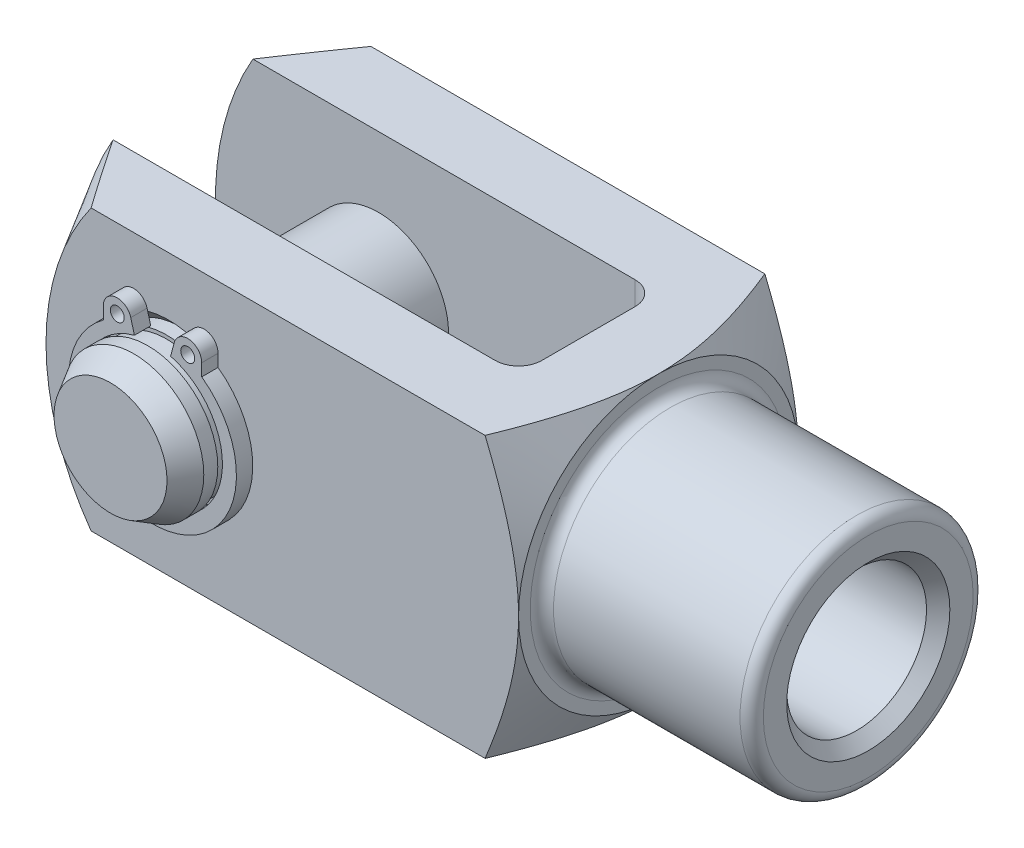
ISO-10303-21;
HEADER;
FILE_DESCRIPTION(('STEP AP214'),'2;1');
FILE_NAME('part.step','',(''),(''),'','','');
FILE_SCHEMA(('AUTOMOTIVE_DESIGN { 1 0 10303 214 1 1 1 1 }'));
ENDSEC;
DATA;
#1=APPLICATION_CONTEXT('core data for automotive mechanical design processes');
#2=APPLICATION_PROTOCOL_DEFINITION('international standard','automotive_design',2000,#1);
#3=PRODUCT_CONTEXT('',#1,'mechanical');
#4=PRODUCT('Part','Part','',(#3));
#5=PRODUCT_RELATED_PRODUCT_CATEGORY('part','',(#4));
#6=PRODUCT_DEFINITION_FORMATION('','',#4);
#7=PRODUCT_DEFINITION_CONTEXT('part definition',#1,'design');
#8=PRODUCT_DEFINITION('design','',#6,#7);
#9=PRODUCT_DEFINITION_SHAPE('','',#8);
#10=(LENGTH_UNIT() NAMED_UNIT(*) SI_UNIT(.MILLI.,.METRE.));
#11=(NAMED_UNIT(*) PLANE_ANGLE_UNIT() SI_UNIT($,.RADIAN.));
#12=(NAMED_UNIT(*) SI_UNIT($,.STERADIAN.) SOLID_ANGLE_UNIT());
#13=UNCERTAINTY_MEASURE_WITH_UNIT(LENGTH_MEASURE(1.E-05),#10,'distance_accuracy_value','');
#14=(GEOMETRIC_REPRESENTATION_CONTEXT(3) GLOBAL_UNCERTAINTY_ASSIGNED_CONTEXT((#13)) GLOBAL_UNIT_ASSIGNED_CONTEXT((#10,
#11,#12)) REPRESENTATION_CONTEXT('',''));
#15=CARTESIAN_POINT('',(0.,0.,0.));
#16=DIRECTION('',(0.,0.,1.));
#17=DIRECTION('',(1.,0.,0.));
#18=AXIS2_PLACEMENT_3D('',#15,#16,#17);
#19=CARTESIAN_POINT('',(-24.,0.,8.5));
#20=DIRECTION('',(0.,0.,-1.));
#21=DIRECTION('',(-1.,0.,0.));
#22=AXIS2_PLACEMENT_3D('',#19,#20,#21);
#23=CYLINDRICAL_SURFACE('',#22,3.);
#24=CARTESIAN_POINT('',(-24.,0.,6.1));
#25=DIRECTION('',(0.,0.,1.));
#26=DIRECTION('',(1.,0.,0.));
#27=AXIS2_PLACEMENT_3D('',#24,#25,#26);
#28=CIRCLE('',#27,3.);
#29=CARTESIAN_POINT('',(-21.,0.,6.1));
#30=VERTEX_POINT('',#29);
#31=EDGE_CURVE('P0_E55',#30,#30,#28,.T.);
#32=ORIENTED_EDGE('',*,*,#31,.F.);
#33=EDGE_LOOP('',(#32));
#34=FACE_BOUND('',#33,.T.);
#35=CARTESIAN_POINT('',(-24.,0.,-6.1));
#36=DIRECTION('',(0.,0.,1.));
#37=DIRECTION('',(1.,0.,0.));
#38=AXIS2_PLACEMENT_3D('',#35,#36,#37);
#39=CIRCLE('',#38,3.);
#40=CARTESIAN_POINT('',(-21.,0.,-6.1));
#41=VERTEX_POINT('',#40);
#42=EDGE_CURVE('P0_E40',#41,#41,#39,.T.);
#43=ORIENTED_EDGE('',*,*,#42,.T.);
#44=EDGE_LOOP('',(#43));
#45=FACE_BOUND('',#44,.T.);
#46=ADVANCED_FACE('P0_F14',(#34,#45),#23,.T.);
#47=CARTESIAN_POINT('',(-24.,0.,-6.9));
#48=DIRECTION('',(0.,0.,1.));
#49=DIRECTION('',(1.,0.,0.));
#50=AXIS2_PLACEMENT_3D('',#47,#48,#49);
#51=CIRCLE('',#50,3.);
#52=CARTESIAN_POINT('',(-21.,0.,-6.9));
#53=VERTEX_POINT('',#52);
#54=EDGE_CURVE('P0_E43',#53,#53,#51,.T.);
#55=ORIENTED_EDGE('',*,*,#54,.F.);
#56=EDGE_LOOP('',(#55));
#57=FACE_BOUND('',#56,.T.);
#58=CARTESIAN_POINT('',(-24.,0.,-7.5));
#59=DIRECTION('',(0.,0.,1.));
#60=DIRECTION('',(1.,0.,0.));
#61=AXIS2_PLACEMENT_3D('',#58,#59,#60);
#62=CIRCLE('',#61,3.);
#63=CARTESIAN_POINT('',(-21.,0.,-7.5));
#64=VERTEX_POINT('',#63);
#65=EDGE_CURVE('P0_E25',#64,#64,#62,.T.);
#66=ORIENTED_EDGE('',*,*,#65,.T.);
#67=EDGE_LOOP('',(#66));
#68=FACE_BOUND('',#67,.T.);
#69=ADVANCED_FACE('P0_F63',(#57,#68),#23,.T.);
#70=CARTESIAN_POINT('',(-24.,0.,-8.5));
#71=DIRECTION('',(0.,0.,1.));
#72=DIRECTION('',(1.,0.,0.));
#73=AXIS2_PLACEMENT_3D('',#70,#71,#72);
#74=PLANE('',#73);
#75=CARTESIAN_POINT('',(-24.,0.,-8.5));
#76=DIRECTION('',(0.,0.,1.));
#77=DIRECTION('',(1.,0.,0.));
#78=AXIS2_PLACEMENT_3D('',#75,#76,#77);
#79=CIRCLE('',#78,2.42264973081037);
#80=CARTESIAN_POINT('',(-21.5773502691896,0.,-8.5));
#81=VERTEX_POINT('',#80);
#82=EDGE_CURVE('P0_E21',#81,#81,#79,.F.);
#83=ORIENTED_EDGE('',*,*,#82,.T.);
#84=EDGE_LOOP('',(#83));
#85=FACE_BOUND('',#84,.T.);
#86=ADVANCED_FACE('P0_F89',(#85),#74,.F.);
#87=CARTESIAN_POINT('',(-24.,0.,-7.5));
#88=DIRECTION('',(0.,0.,1.));
#89=DIRECTION('',(1.,0.,0.));
#90=AXIS2_PLACEMENT_3D('',#87,#88,#89);
#91=CONICAL_SURFACE('',#90,3.,0.523598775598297);
#92=ORIENTED_EDGE('',*,*,#82,.F.);
#93=EDGE_LOOP('',(#92));
#94=FACE_BOUND('',#93,.T.);
#95=ORIENTED_EDGE('',*,*,#65,.F.);
#96=EDGE_LOOP('',(#95));
#97=FACE_BOUND('',#96,.T.);
#98=ADVANCED_FACE('P0_F83',(#94,#97),#91,.T.);
#99=CARTESIAN_POINT('',(-24.,3.,-6.9));
#100=DIRECTION('',(0.,0.,-1.));
#101=DIRECTION('',(-1.,0.,0.));
#102=AXIS2_PLACEMENT_3D('',#99,#100,#101);
#103=PLANE('',#102);
#104=CARTESIAN_POINT('',(-24.,0.,-6.9));
#105=DIRECTION('',(0.,0.,1.));
#106=DIRECTION('',(1.,0.,0.));
#107=AXIS2_PLACEMENT_3D('',#104,#105,#106);
#108=CIRCLE('',#107,2.85);
#109=CARTESIAN_POINT('',(-21.15,0.,-6.9));
#110=VERTEX_POINT('',#109);
#111=EDGE_CURVE('P0_E34',#110,#110,#108,.T.);
#112=ORIENTED_EDGE('',*,*,#111,.F.);
#113=EDGE_LOOP('',(#112));
#114=FACE_BOUND('',#113,.T.);
#115=ORIENTED_EDGE('',*,*,#54,.T.);
#116=EDGE_LOOP('',(#115));
#117=FACE_BOUND('',#116,.T.);
#118=ADVANCED_FACE('P0_F77',(#114,#117),#103,.F.);
#119=CARTESIAN_POINT('',(-24.,0.,7.5));
#120=DIRECTION('',(0.,0.,1.));
#121=DIRECTION('',(1.,0.,0.));
#122=AXIS2_PLACEMENT_3D('',#119,#120,#121);
#123=CYLINDRICAL_SURFACE('',#122,2.85);
#124=CARTESIAN_POINT('',(-24.,0.,-6.1));
#125=DIRECTION('',(0.,0.,1.));
#126=DIRECTION('',(1.,0.,0.));
#127=AXIS2_PLACEMENT_3D('',#124,#125,#126);
#128=CIRCLE('',#127,2.85);
#129=CARTESIAN_POINT('',(-21.15,0.,-6.1));
#130=VERTEX_POINT('',#129);
#131=EDGE_CURVE('P0_E37',#130,#130,#128,.T.);
#132=ORIENTED_EDGE('',*,*,#131,.F.);
#133=EDGE_LOOP('',(#132));
#134=FACE_BOUND('',#133,.T.);
#135=ORIENTED_EDGE('',*,*,#111,.T.);
#136=EDGE_LOOP('',(#135));
#137=FACE_BOUND('',#136,.T.);
#138=ADVANCED_FACE('P0_F71',(#134,#137),#123,.T.);
#139=CARTESIAN_POINT('',(-24.,3.,-6.1));
#140=DIRECTION('',(0.,0.,1.));
#141=DIRECTION('',(1.,0.,0.));
#142=AXIS2_PLACEMENT_3D('',#139,#140,#141);
#143=PLANE('',#142);
#144=ORIENTED_EDGE('',*,*,#42,.F.);
#145=EDGE_LOOP('',(#144));
#146=FACE_BOUND('',#145,.T.);
#147=ORIENTED_EDGE('',*,*,#131,.T.);
#148=EDGE_LOOP('',(#147));
#149=FACE_BOUND('',#148,.T.);
#150=ADVANCED_FACE('P0_F68',(#146,#149),#143,.F.);
#151=CARTESIAN_POINT('',(-24.,3.,6.1));
#152=DIRECTION('',(0.,0.,-1.));
#153=DIRECTION('',(-1.,0.,0.));
#154=AXIS2_PLACEMENT_3D('',#151,#152,#153);
#155=PLANE('',#154);
#156=CARTESIAN_POINT('',(-24.,0.,6.1));
#157=DIRECTION('',(0.,0.,1.));
#158=DIRECTION('',(1.,0.,0.));
#159=AXIS2_PLACEMENT_3D('',#156,#157,#158);
#160=CIRCLE('',#159,2.85);
#161=CARTESIAN_POINT('',(-21.15,0.,6.1));
#162=VERTEX_POINT('',#161);
#163=EDGE_CURVE('P0_E46',#162,#162,#160,.T.);
#164=ORIENTED_EDGE('',*,*,#163,.F.);
#165=EDGE_LOOP('',(#164));
#166=FACE_BOUND('',#165,.T.);
#167=ORIENTED_EDGE('',*,*,#31,.T.);
#168=EDGE_LOOP('',(#167));
#169=FACE_BOUND('',#168,.T.);
#170=ADVANCED_FACE('P0_F59',(#166,#169),#155,.F.);
#171=CARTESIAN_POINT('',(-24.,0.,7.5));
#172=DIRECTION('',(0.,0.,1.));
#173=DIRECTION('',(1.,0.,0.));
#174=AXIS2_PLACEMENT_3D('',#171,#172,#173);
#175=CYLINDRICAL_SURFACE('',#174,2.85);
#176=CARTESIAN_POINT('',(-24.,0.,6.9));
#177=DIRECTION('',(0.,0.,1.));
#178=DIRECTION('',(1.,0.,0.));
#179=AXIS2_PLACEMENT_3D('',#176,#177,#178);
#180=CIRCLE('',#179,2.85);
#181=CARTESIAN_POINT('',(-21.15,0.,6.9));
#182=VERTEX_POINT('',#181);
#183=EDGE_CURVE('P0_E49',#182,#182,#180,.T.);
#184=ORIENTED_EDGE('',*,*,#183,.F.);
#185=EDGE_LOOP('',(#184));
#186=FACE_BOUND('',#185,.T.);
#187=ORIENTED_EDGE('',*,*,#163,.T.);
#188=EDGE_LOOP('',(#187));
#189=FACE_BOUND('',#188,.T.);
#190=ADVANCED_FACE('P0_F108',(#186,#189),#175,.T.);
#191=CARTESIAN_POINT('',(-24.,3.,6.9));
#192=DIRECTION('',(0.,0.,1.));
#193=DIRECTION('',(1.,0.,0.));
#194=AXIS2_PLACEMENT_3D('',#191,#192,#193);
#195=PLANE('',#194);
#196=CARTESIAN_POINT('',(-24.,0.,6.9));
#197=DIRECTION('',(0.,0.,1.));
#198=DIRECTION('',(1.,0.,0.));
#199=AXIS2_PLACEMENT_3D('',#196,#197,#198);
#200=CIRCLE('',#199,3.);
#201=CARTESIAN_POINT('',(-21.,0.,6.9));
#202=VERTEX_POINT('',#201);
#203=EDGE_CURVE('P0_E52',#202,#202,#200,.T.);
#204=ORIENTED_EDGE('',*,*,#203,.F.);
#205=EDGE_LOOP('',(#204));
#206=FACE_BOUND('',#205,.T.);
#207=ORIENTED_EDGE('',*,*,#183,.T.);
#208=EDGE_LOOP('',(#207));
#209=FACE_BOUND('',#208,.T.);
#210=ADVANCED_FACE('P0_F104',(#206,#209),#195,.F.);
#211=CARTESIAN_POINT('',(-24.,0.,8.5));
#212=DIRECTION('',(0.,0.,1.));
#213=DIRECTION('',(1.,0.,0.));
#214=AXIS2_PLACEMENT_3D('',#211,#212,#213);
#215=PLANE('',#214);
#216=CARTESIAN_POINT('',(-24.,0.,8.5));
#217=DIRECTION('',(0.,0.,1.));
#218=DIRECTION('',(1.,0.,0.));
#219=AXIS2_PLACEMENT_3D('',#216,#217,#218);
#220=CIRCLE('',#219,2.42264973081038);
#221=CARTESIAN_POINT('',(-21.5773502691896,0.,8.5));
#222=VERTEX_POINT('',#221);
#223=EDGE_CURVE('P0_E10',#222,#222,#220,.T.);
#224=ORIENTED_EDGE('',*,*,#223,.T.);
#225=EDGE_LOOP('',(#224));
#226=FACE_BOUND('',#225,.T.);
#227=ADVANCED_FACE('P0_F102',(#226),#215,.T.);
#228=CARTESIAN_POINT('',(-24.,0.,8.5));
#229=DIRECTION('',(0.,0.,-1.));
#230=DIRECTION('',(-1.,0.,0.));
#231=AXIS2_PLACEMENT_3D('',#228,#229,#230);
#232=CONICAL_SURFACE('',#231,2.42264973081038,0.523598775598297);
#233=CARTESIAN_POINT('',(-24.,0.,7.5));
#234=DIRECTION('',(0.,0.,1.));
#235=DIRECTION('',(1.,0.,0.));
#236=AXIS2_PLACEMENT_3D('',#233,#234,#235);
#237=CIRCLE('',#236,3.);
#238=CARTESIAN_POINT('',(-21.,0.,7.5));
#239=VERTEX_POINT('',#238);
#240=EDGE_CURVE('P0_E29',#239,#239,#237,.F.);
#241=ORIENTED_EDGE('',*,*,#240,.F.);
#242=EDGE_LOOP('',(#241));
#243=FACE_BOUND('',#242,.T.);
#244=ORIENTED_EDGE('',*,*,#223,.F.);
#245=EDGE_LOOP('',(#244));
#246=FACE_BOUND('',#245,.T.);
#247=ADVANCED_FACE('P0_F16',(#243,#246),#232,.T.);
#248=ORIENTED_EDGE('',*,*,#203,.T.);
#249=EDGE_LOOP('',(#248));
#250=FACE_BOUND('',#249,.T.);
#251=ORIENTED_EDGE('',*,*,#240,.T.);
#252=EDGE_LOOP('',(#251));
#253=FACE_BOUND('',#252,.T.);
#254=ADVANCED_FACE('P0_F65',(#250,#253),#23,.T.);
#255=CLOSED_SHELL('',(#46,#69,#86,#98,#118,#138,#150,#170,#190,#210,#227,#247,#254));
#256=MANIFOLD_SOLID_BREP('P0_B1',#255);
#257=CARTESIAN_POINT('',(-24.,0.,6.6999999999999));
#258=DIRECTION('',(0.,0.,1.));
#259=DIRECTION('',(1.,0.,0.));
#260=AXIS2_PLACEMENT_3D('',#257,#258,#259);
#261=PLANE('',#260);
#262=CARTESIAN_POINT('',(-25.5113040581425,3.32204154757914,6.69999999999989));
#263=DIRECTION('',(0.,0.,1.));
#264=DIRECTION('',(1.,0.,0.));
#265=AXIS2_PLACEMENT_3D('',#262,#263,#264);
#266=CIRCLE('',#265,0.3);
#267=CARTESIAN_POINT('',(-25.2113040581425,3.32204154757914,6.69999999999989));
#268=VERTEX_POINT('',#267);
#269=EDGE_CURVE('P1_E117',#268,#268,#266,.T.);
#270=ORIENTED_EDGE('',*,*,#269,.F.);
#271=EDGE_LOOP('',(#270));
#272=FACE_BOUND('',#271,.T.);
#273=CARTESIAN_POINT('',(-24.,0.,6.6999999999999));
#274=DIRECTION('',(0.,0.,-1.));
#275=DIRECTION('',(1.,0.,0.));
#276=AXIS2_PLACEMENT_3D('',#273,#274,#275);
#277=CIRCLE('',#276,3.);
#278=CARTESIAN_POINT('',(-23.2235428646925,2.89777747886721,6.6999999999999));
#279=VERTEX_POINT('',#278);
#280=CARTESIAN_POINT('',(-24.7764571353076,2.89777747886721,6.69999999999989));
#281=VERTEX_POINT('',#280);
#282=EDGE_CURVE('P1_E128',#279,#281,#277,.T.);
#283=ORIENTED_EDGE('',*,*,#282,.T.);
#284=DIRECTION('',(-0.258819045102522,0.965925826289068,0.));
#285=VECTOR('',#284,1.);
#286=CARTESIAN_POINT('',(-24.7764571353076,2.89777747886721,6.69999999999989));
#287=LINE('',#286,#285);
#288=CARTESIAN_POINT('',(-24.9317485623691,3.47733297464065,6.69999999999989));
#289=VERTEX_POINT('',#288);
#290=EDGE_CURVE('P1_E76',#281,#289,#287,.T.);
#291=ORIENTED_EDGE('',*,*,#290,.T.);
#292=CARTESIAN_POINT('',(-25.5113040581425,3.32204154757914,6.69999999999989));
#293=DIRECTION('',(0.,0.,1.));
#294=DIRECTION('',(1.,0.,0.));
#295=AXIS2_PLACEMENT_3D('',#292,#293,#294);
#296=CIRCLE('',#295,0.599999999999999);
#297=CARTESIAN_POINT('',(-26.1113040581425,3.32204154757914,6.69999999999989));
#298=VERTEX_POINT('',#297);
#299=EDGE_CURVE('P1_E143',#289,#298,#296,.T.);
#300=ORIENTED_EDGE('',*,*,#299,.T.);
#301=DIRECTION('',(0.,-1.,0.));
#302=VECTOR('',#301,1.);
#303=CARTESIAN_POINT('',(-26.1113040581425,3.32204154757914,6.69999999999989));
#304=LINE('',#303,#302);
#305=CARTESIAN_POINT('',(-26.1113040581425,2.79588668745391,6.69999999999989));
#306=VERTEX_POINT('',#305);
#307=EDGE_CURVE('P1_E156',#298,#306,#304,.T.);
#308=ORIENTED_EDGE('',*,*,#307,.T.);
#309=CARTESIAN_POINT('',(-24.,-0.119999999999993,6.6999999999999));
#310=DIRECTION('',(0.,0.,1.));
#311=DIRECTION('',(1.,0.,0.));
#312=AXIS2_PLACEMENT_3D('',#309,#310,#311);
#313=CIRCLE('',#312,3.6);
#314=CARTESIAN_POINT('',(-21.8886959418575,2.79588668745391,6.6999999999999));
#315=VERTEX_POINT('',#314);
#316=EDGE_CURVE('P1_E95',#306,#315,#313,.T.);
#317=ORIENTED_EDGE('',*,*,#316,.T.);
#318=DIRECTION('',(0.,1.,0.));
#319=VECTOR('',#318,1.);
#320=CARTESIAN_POINT('',(-21.8886959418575,3.32204154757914,6.6999999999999));
#321=LINE('',#320,#319);
#322=CARTESIAN_POINT('',(-21.8886959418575,3.32204154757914,6.6999999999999));
#323=VERTEX_POINT('',#322);
#324=EDGE_CURVE('P1_E89',#315,#323,#321,.T.);
#325=ORIENTED_EDGE('',*,*,#324,.T.);
#326=CARTESIAN_POINT('',(-22.4886959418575,3.32204154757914,6.6999999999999));
#327=DIRECTION('',(0.,0.,1.));
#328=DIRECTION('',(-1.,0.,0.));
#329=AXIS2_PLACEMENT_3D('',#326,#327,#328);
#330=CIRCLE('',#329,0.599999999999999);
#331=CARTESIAN_POINT('',(-23.0682514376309,3.47733297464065,6.6999999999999));
#332=VERTEX_POINT('',#331);
#333=EDGE_CURVE('P1_E93',#323,#332,#330,.T.);
#334=ORIENTED_EDGE('',*,*,#333,.T.);
#335=DIRECTION('',(-0.258819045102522,-0.965925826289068,0.));
#336=VECTOR('',#335,1.);
#337=CARTESIAN_POINT('',(-23.2235428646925,2.89777747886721,6.6999999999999));
#338=LINE('',#337,#336);
#339=EDGE_CURVE('P1_E33',#332,#279,#338,.T.);
#340=ORIENTED_EDGE('',*,*,#339,.T.);
#341=EDGE_LOOP('',(#283,#291,#300,#308,#317,#325,#334,#340));
#342=FACE_BOUND('',#341,.T.);
#343=CARTESIAN_POINT('',(-22.4886959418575,3.32204154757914,6.6999999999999));
#344=DIRECTION('',(0.,0.,1.));
#345=DIRECTION('',(-1.,0.,0.));
#346=AXIS2_PLACEMENT_3D('',#343,#344,#345);
#347=CIRCLE('',#346,0.3);
#348=CARTESIAN_POINT('',(-22.7886959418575,3.32204154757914,6.6999999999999));
#349=VERTEX_POINT('',#348);
#350=EDGE_CURVE('P1_E165',#349,#349,#347,.T.);
#351=ORIENTED_EDGE('',*,*,#350,.F.);
#352=EDGE_LOOP('',(#351));
#353=FACE_BOUND('',#352,.T.);
#354=ADVANCED_FACE('P1_F16',(#272,#342,#353),#261,.T.);
#355=CARTESIAN_POINT('',(-24.,0.,5.9999999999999));
#356=DIRECTION('',(0.,0.,1.));
#357=DIRECTION('',(1.,0.,0.));
#358=AXIS2_PLACEMENT_3D('',#355,#356,#357);
#359=PLANE('',#358);
#360=CARTESIAN_POINT('',(-25.5113040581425,3.32204154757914,5.99999999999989));
#361=DIRECTION('',(0.,0.,1.));
#362=DIRECTION('',(1.,0.,0.));
#363=AXIS2_PLACEMENT_3D('',#360,#361,#362);
#364=CIRCLE('',#363,0.3);
#365=CARTESIAN_POINT('',(-25.2113040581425,3.32204154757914,5.99999999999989));
#366=VERTEX_POINT('',#365);
#367=EDGE_CURVE('P1_E162',#366,#366,#364,.T.);
#368=ORIENTED_EDGE('',*,*,#367,.T.);
#369=EDGE_LOOP('',(#368));
#370=FACE_BOUND('',#369,.T.);
#371=CARTESIAN_POINT('',(-24.,0.,5.9999999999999));
#372=DIRECTION('',(0.,0.,-1.));
#373=DIRECTION('',(1.,0.,0.));
#374=AXIS2_PLACEMENT_3D('',#371,#372,#373);
#375=CIRCLE('',#374,3.);
#376=CARTESIAN_POINT('',(-23.2235428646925,2.89777747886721,5.9999999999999));
#377=VERTEX_POINT('',#376);
#378=CARTESIAN_POINT('',(-24.7764571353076,2.89777747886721,5.99999999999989));
#379=VERTEX_POINT('',#378);
#380=EDGE_CURVE('P1_E113',#377,#379,#375,.T.);
#381=ORIENTED_EDGE('',*,*,#380,.F.);
#382=DIRECTION('',(-0.258819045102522,-0.965925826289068,0.));
#383=VECTOR('',#382,1.);
#384=CARTESIAN_POINT('',(-23.2235428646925,2.89777747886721,5.9999999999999));
#385=LINE('',#384,#383);
#386=CARTESIAN_POINT('',(-23.0682514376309,3.47733297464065,5.9999999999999));
#387=VERTEX_POINT('',#386);
#388=EDGE_CURVE('P1_E68',#387,#377,#385,.T.);
#389=ORIENTED_EDGE('',*,*,#388,.F.);
#390=CARTESIAN_POINT('',(-22.4886959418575,3.32204154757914,5.9999999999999));
#391=DIRECTION('',(0.,0.,1.));
#392=DIRECTION('',(-1.,0.,0.));
#393=AXIS2_PLACEMENT_3D('',#390,#391,#392);
#394=CIRCLE('',#393,0.599999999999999);
#395=CARTESIAN_POINT('',(-21.8886959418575,3.32204154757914,5.9999999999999));
#396=VERTEX_POINT('',#395);
#397=EDGE_CURVE('P1_E62',#396,#387,#394,.T.);
#398=ORIENTED_EDGE('',*,*,#397,.F.);
#399=DIRECTION('',(0.,1.,0.));
#400=VECTOR('',#399,1.);
#401=CARTESIAN_POINT('',(-21.8886959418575,3.32204154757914,5.9999999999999));
#402=LINE('',#401,#400);
#403=CARTESIAN_POINT('',(-21.8886959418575,2.79588668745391,5.9999999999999));
#404=VERTEX_POINT('',#403);
#405=EDGE_CURVE('P1_E103',#404,#396,#402,.T.);
#406=ORIENTED_EDGE('',*,*,#405,.F.);
#407=CARTESIAN_POINT('',(-24.,-0.119999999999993,5.9999999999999));
#408=DIRECTION('',(0.,0.,1.));
#409=DIRECTION('',(1.,0.,0.));
#410=AXIS2_PLACEMENT_3D('',#407,#408,#409);
#411=CIRCLE('',#410,3.6);
#412=CARTESIAN_POINT('',(-26.1113040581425,2.79588668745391,5.99999999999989));
#413=VERTEX_POINT('',#412);
#414=EDGE_CURVE('P1_E123',#413,#404,#411,.T.);
#415=ORIENTED_EDGE('',*,*,#414,.F.);
#416=DIRECTION('',(0.,-1.,0.));
#417=VECTOR('',#416,1.);
#418=CARTESIAN_POINT('',(-26.1113040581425,3.32204154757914,5.99999999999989));
#419=LINE('',#418,#417);
#420=CARTESIAN_POINT('',(-26.1113040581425,3.32204154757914,5.99999999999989));
#421=VERTEX_POINT('',#420);
#422=EDGE_CURVE('P1_E121',#421,#413,#419,.T.);
#423=ORIENTED_EDGE('',*,*,#422,.F.);
#424=CARTESIAN_POINT('',(-25.5113040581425,3.32204154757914,5.99999999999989));
#425=DIRECTION('',(0.,0.,1.));
#426=DIRECTION('',(1.,0.,0.));
#427=AXIS2_PLACEMENT_3D('',#424,#425,#426);
#428=CIRCLE('',#427,0.599999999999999);
#429=CARTESIAN_POINT('',(-24.9317485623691,3.47733297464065,5.99999999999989));
#430=VERTEX_POINT('',#429);
#431=EDGE_CURVE('P1_E119',#430,#421,#428,.T.);
#432=ORIENTED_EDGE('',*,*,#431,.F.);
#433=DIRECTION('',(-0.258819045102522,0.965925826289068,0.));
#434=VECTOR('',#433,1.);
#435=CARTESIAN_POINT('',(-24.7764571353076,2.89777747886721,5.99999999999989));
#436=LINE('',#435,#434);
#437=EDGE_CURVE('P1_E116',#379,#430,#436,.T.);
#438=ORIENTED_EDGE('',*,*,#437,.F.);
#439=EDGE_LOOP('',(#381,#389,#398,#406,#415,#423,#432,#438));
#440=FACE_BOUND('',#439,.T.);
#441=CARTESIAN_POINT('',(-22.4886959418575,3.32204154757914,5.9999999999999));
#442=DIRECTION('',(0.,0.,1.));
#443=DIRECTION('',(-1.,0.,0.));
#444=AXIS2_PLACEMENT_3D('',#441,#442,#443);
#445=CIRCLE('',#444,0.3);
#446=CARTESIAN_POINT('',(-22.7886959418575,3.32204154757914,5.9999999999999));
#447=VERTEX_POINT('',#446);
#448=EDGE_CURVE('P1_E168',#447,#447,#445,.T.);
#449=ORIENTED_EDGE('',*,*,#448,.T.);
#450=EDGE_LOOP('',(#449));
#451=FACE_BOUND('',#450,.T.);
#452=ADVANCED_FACE('P1_F147',(#370,#440,#451),#359,.F.);
#453=CARTESIAN_POINT('',(-24.,0.,6.6999999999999));
#454=DIRECTION('',(0.,0.,-1.));
#455=DIRECTION('',(-1.,0.,0.));
#456=AXIS2_PLACEMENT_3D('',#453,#454,#455);
#457=CYLINDRICAL_SURFACE('',#456,3.);
#458=ORIENTED_EDGE('',*,*,#380,.T.);
#459=DIRECTION('',(0.,0.,-1.));
#460=VECTOR('',#459,1.);
#461=CARTESIAN_POINT('',(-24.7764571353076,2.89777747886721,6.69999999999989));
#462=LINE('',#461,#460);
#463=EDGE_CURVE('P1_E11',#281,#379,#462,.T.);
#464=ORIENTED_EDGE('',*,*,#463,.F.);
#465=ORIENTED_EDGE('',*,*,#282,.F.);
#466=DIRECTION('',(0.,0.,-1.));
#467=VECTOR('',#466,1.);
#468=CARTESIAN_POINT('',(-23.2235428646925,2.89777747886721,6.6999999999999));
#469=LINE('',#468,#467);
#470=EDGE_CURVE('P1_E109',#279,#377,#469,.T.);
#471=ORIENTED_EDGE('',*,*,#470,.T.);
#472=EDGE_LOOP('',(#458,#464,#465,#471));
#473=FACE_BOUND('',#472,.T.);
#474=ADVANCED_FACE('P1_F18',(#473),#457,.F.);
#475=CARTESIAN_POINT('',(-24.7764571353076,2.89777747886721,6.69999999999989));
#476=DIRECTION('',(-0.965925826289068,-0.258819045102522,0.));
#477=DIRECTION('',(0.258819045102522,-0.965925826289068,0.));
#478=AXIS2_PLACEMENT_3D('',#475,#476,#477);
#479=PLANE('',#478);
#480=ORIENTED_EDGE('',*,*,#437,.T.);
#481=DIRECTION('',(0.,0.,-1.));
#482=VECTOR('',#481,1.);
#483=CARTESIAN_POINT('',(-24.9317485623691,3.47733297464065,6.69999999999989));
#484=LINE('',#483,#482);
#485=EDGE_CURVE('P1_E25',#289,#430,#484,.T.);
#486=ORIENTED_EDGE('',*,*,#485,.F.);
#487=ORIENTED_EDGE('',*,*,#290,.F.);
#488=ORIENTED_EDGE('',*,*,#463,.T.);
#489=EDGE_LOOP('',(#480,#486,#487,#488));
#490=FACE_BOUND('',#489,.T.);
#491=ADVANCED_FACE('P1_F202',(#490),#479,.F.);
#492=CARTESIAN_POINT('',(-25.5113040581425,3.32204154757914,6.69999999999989));
#493=DIRECTION('',(0.,0.,-1.));
#494=DIRECTION('',(-1.,0.,0.));
#495=AXIS2_PLACEMENT_3D('',#492,#493,#494);
#496=CYLINDRICAL_SURFACE('',#495,0.599999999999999);
#497=ORIENTED_EDGE('',*,*,#431,.T.);
#498=DIRECTION('',(0.,0.,-1.));
#499=VECTOR('',#498,1.);
#500=CARTESIAN_POINT('',(-26.1113040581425,3.32204154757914,6.69999999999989));
#501=LINE('',#500,#499);
#502=EDGE_CURVE('P1_E135',#298,#421,#501,.T.);
#503=ORIENTED_EDGE('',*,*,#502,.F.);
#504=ORIENTED_EDGE('',*,*,#299,.F.);
#505=ORIENTED_EDGE('',*,*,#485,.T.);
#506=EDGE_LOOP('',(#497,#503,#504,#505));
#507=FACE_BOUND('',#506,.T.);
#508=ADVANCED_FACE('P1_F141',(#507),#496,.T.);
#509=CARTESIAN_POINT('',(-26.1113040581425,3.32204154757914,6.69999999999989));
#510=DIRECTION('',(1.,0.,0.));
#511=DIRECTION('',(0.,1.,0.));
#512=AXIS2_PLACEMENT_3D('',#509,#510,#511);
#513=PLANE('',#512);
#514=ORIENTED_EDGE('',*,*,#422,.T.);
#515=DIRECTION('',(0.,0.,-1.));
#516=VECTOR('',#515,1.);
#517=CARTESIAN_POINT('',(-26.1113040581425,2.79588668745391,6.69999999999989));
#518=LINE('',#517,#516);
#519=EDGE_CURVE('P1_E132',#306,#413,#518,.T.);
#520=ORIENTED_EDGE('',*,*,#519,.F.);
#521=ORIENTED_EDGE('',*,*,#307,.F.);
#522=ORIENTED_EDGE('',*,*,#502,.T.);
#523=EDGE_LOOP('',(#514,#520,#521,#522));
#524=FACE_BOUND('',#523,.T.);
#525=ADVANCED_FACE('P1_F152',(#524),#513,.F.);
#526=CARTESIAN_POINT('',(-24.,-0.119999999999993,6.6999999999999));
#527=DIRECTION('',(0.,0.,-1.));
#528=DIRECTION('',(-1.,0.,0.));
#529=AXIS2_PLACEMENT_3D('',#526,#527,#528);
#530=CYLINDRICAL_SURFACE('',#529,3.6);
#531=ORIENTED_EDGE('',*,*,#414,.T.);
#532=DIRECTION('',(0.,0.,-1.));
#533=VECTOR('',#532,1.);
#534=CARTESIAN_POINT('',(-21.8886959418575,2.79588668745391,6.6999999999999));
#535=LINE('',#534,#533);
#536=EDGE_CURVE('P1_E104',#315,#404,#535,.T.);
#537=ORIENTED_EDGE('',*,*,#536,.F.);
#538=ORIENTED_EDGE('',*,*,#316,.F.);
#539=ORIENTED_EDGE('',*,*,#519,.T.);
#540=EDGE_LOOP('',(#531,#537,#538,#539));
#541=FACE_BOUND('',#540,.T.);
#542=ADVANCED_FACE('P1_F155',(#541),#530,.T.);
#543=CARTESIAN_POINT('',(-21.8886959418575,3.32204154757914,6.6999999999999));
#544=DIRECTION('',(-1.,0.,0.));
#545=DIRECTION('',(0.,-1.,0.));
#546=AXIS2_PLACEMENT_3D('',#543,#544,#545);
#547=PLANE('',#546);
#548=ORIENTED_EDGE('',*,*,#405,.T.);
#549=DIRECTION('',(0.,0.,-1.));
#550=VECTOR('',#549,1.);
#551=CARTESIAN_POINT('',(-21.8886959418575,3.32204154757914,6.6999999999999));
#552=LINE('',#551,#550);
#553=EDGE_CURVE('P1_E100',#323,#396,#552,.T.);
#554=ORIENTED_EDGE('',*,*,#553,.F.);
#555=ORIENTED_EDGE('',*,*,#324,.F.);
#556=ORIENTED_EDGE('',*,*,#536,.T.);
#557=EDGE_LOOP('',(#548,#554,#555,#556));
#558=FACE_BOUND('',#557,.T.);
#559=ADVANCED_FACE('P1_F101',(#558),#547,.F.);
#560=CARTESIAN_POINT('',(-22.4886959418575,3.32204154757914,6.6999999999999));
#561=DIRECTION('',(0.,0.,-1.));
#562=DIRECTION('',(-1.,0.,0.));
#563=AXIS2_PLACEMENT_3D('',#560,#561,#562);
#564=CYLINDRICAL_SURFACE('',#563,0.599999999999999);
#565=ORIENTED_EDGE('',*,*,#397,.T.);
#566=DIRECTION('',(0.,0.,-1.));
#567=VECTOR('',#566,1.);
#568=CARTESIAN_POINT('',(-23.0682514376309,3.47733297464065,6.6999999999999));
#569=LINE('',#568,#567);
#570=EDGE_CURVE('P1_E105',#332,#387,#569,.T.);
#571=ORIENTED_EDGE('',*,*,#570,.F.);
#572=ORIENTED_EDGE('',*,*,#333,.F.);
#573=ORIENTED_EDGE('',*,*,#553,.T.);
#574=EDGE_LOOP('',(#565,#571,#572,#573));
#575=FACE_BOUND('',#574,.T.);
#576=ADVANCED_FACE('P1_F107',(#575),#564,.T.);
#577=CARTESIAN_POINT('',(-23.2235428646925,2.89777747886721,6.6999999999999));
#578=DIRECTION('',(0.965925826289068,-0.258819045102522,0.));
#579=DIRECTION('',(0.258819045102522,0.965925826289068,0.));
#580=AXIS2_PLACEMENT_3D('',#577,#578,#579);
#581=PLANE('',#580);
#582=ORIENTED_EDGE('',*,*,#388,.T.);
#583=ORIENTED_EDGE('',*,*,#470,.F.);
#584=ORIENTED_EDGE('',*,*,#339,.F.);
#585=ORIENTED_EDGE('',*,*,#570,.T.);
#586=EDGE_LOOP('',(#582,#583,#584,#585));
#587=FACE_BOUND('',#586,.T.);
#588=ADVANCED_FACE('P1_F190',(#587),#581,.F.);
#589=CARTESIAN_POINT('',(-25.5113040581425,3.32204154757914,6.69999999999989));
#590=DIRECTION('',(0.,0.,-1.));
#591=DIRECTION('',(-1.,0.,0.));
#592=AXIS2_PLACEMENT_3D('',#589,#590,#591);
#593=CYLINDRICAL_SURFACE('',#592,0.3);
#594=ORIENTED_EDGE('',*,*,#269,.T.);
#595=EDGE_LOOP('',(#594));
#596=FACE_BOUND('',#595,.T.);
#597=ORIENTED_EDGE('',*,*,#367,.F.);
#598=EDGE_LOOP('',(#597));
#599=FACE_BOUND('',#598,.T.);
#600=ADVANCED_FACE('P1_F187',(#596,#599),#593,.F.);
#601=CARTESIAN_POINT('',(-22.4886959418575,3.32204154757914,6.6999999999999));
#602=DIRECTION('',(0.,0.,-1.));
#603=DIRECTION('',(-1.,0.,0.));
#604=AXIS2_PLACEMENT_3D('',#601,#602,#603);
#605=CYLINDRICAL_SURFACE('',#604,0.3);
#606=ORIENTED_EDGE('',*,*,#350,.T.);
#607=EDGE_LOOP('',(#606));
#608=FACE_BOUND('',#607,.T.);
#609=ORIENTED_EDGE('',*,*,#448,.F.);
#610=EDGE_LOOP('',(#609));
#611=FACE_BOUND('',#610,.T.);
#612=ADVANCED_FACE('P1_F174',(#608,#611),#605,.F.);
#613=CLOSED_SHELL('',(#354,#452,#474,#491,#508,#525,#542,#559,#576,#588,#600,#612));
#614=MANIFOLD_SOLID_BREP('P1_B1',#613);
#615=CARTESIAN_POINT('',(-24.,0.,-6.6999999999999));
#616=DIRECTION('',(0.,0.,-1.));
#617=DIRECTION('',(-1.,0.,0.));
#618=AXIS2_PLACEMENT_3D('',#615,#616,#617);
#619=PLANE('',#618);
#620=CARTESIAN_POINT('',(-22.4886959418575,3.32204154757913,-6.6999999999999));
#621=DIRECTION('',(0.,0.,-1.));
#622=DIRECTION('',(-1.,0.,0.));
#623=AXIS2_PLACEMENT_3D('',#620,#621,#622);
#624=CIRCLE('',#623,0.3);
#625=CARTESIAN_POINT('',(-22.7886959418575,3.32204154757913,-6.6999999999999));
#626=VERTEX_POINT('',#625);
#627=EDGE_CURVE('P2_E117',#626,#626,#624,.T.);
#628=ORIENTED_EDGE('',*,*,#627,.F.);
#629=EDGE_LOOP('',(#628));
#630=FACE_BOUND('',#629,.T.);
#631=CARTESIAN_POINT('',(-24.,0.,-6.6999999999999));
#632=DIRECTION('',(0.,0.,1.));
#633=DIRECTION('',(-1.,0.,0.));
#634=AXIS2_PLACEMENT_3D('',#631,#632,#633);
#635=CIRCLE('',#634,3.);
#636=CARTESIAN_POINT('',(-24.7764571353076,2.8977774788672,-6.69999999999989));
#637=VERTEX_POINT('',#636);
#638=CARTESIAN_POINT('',(-23.2235428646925,2.8977774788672,-6.6999999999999));
#639=VERTEX_POINT('',#638);
#640=EDGE_CURVE('P2_E128',#637,#639,#635,.T.);
#641=ORIENTED_EDGE('',*,*,#640,.T.);
#642=DIRECTION('',(0.258819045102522,0.965925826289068,0.));
#643=VECTOR('',#642,1.);
#644=CARTESIAN_POINT('',(-23.2235428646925,2.8977774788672,-6.6999999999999));
#645=LINE('',#644,#643);
#646=CARTESIAN_POINT('',(-23.0682514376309,3.47733297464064,-6.6999999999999));
#647=VERTEX_POINT('',#646);
#648=EDGE_CURVE('P2_E76',#639,#647,#645,.T.);
#649=ORIENTED_EDGE('',*,*,#648,.T.);
#650=CARTESIAN_POINT('',(-22.4886959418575,3.32204154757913,-6.6999999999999));
#651=DIRECTION('',(0.,0.,-1.));
#652=DIRECTION('',(-1.,0.,0.));
#653=AXIS2_PLACEMENT_3D('',#650,#651,#652);
#654=CIRCLE('',#653,0.599999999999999);
#655=CARTESIAN_POINT('',(-21.8886959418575,3.32204154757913,-6.6999999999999));
#656=VERTEX_POINT('',#655);
#657=EDGE_CURVE('P2_E143',#647,#656,#654,.T.);
#658=ORIENTED_EDGE('',*,*,#657,.T.);
#659=DIRECTION('',(0.,-1.,0.));
#660=VECTOR('',#659,1.);
#661=CARTESIAN_POINT('',(-21.8886959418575,3.32204154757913,-6.6999999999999));
#662=LINE('',#661,#660);
#663=CARTESIAN_POINT('',(-21.8886959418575,2.7958866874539,-6.6999999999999));
#664=VERTEX_POINT('',#663);
#665=EDGE_CURVE('P2_E156',#656,#664,#662,.T.);
#666=ORIENTED_EDGE('',*,*,#665,.T.);
#667=CARTESIAN_POINT('',(-24.,-0.120000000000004,-6.6999999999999));
#668=DIRECTION('',(0.,0.,-1.));
#669=DIRECTION('',(-1.,0.,0.));
#670=AXIS2_PLACEMENT_3D('',#667,#668,#669);
#671=CIRCLE('',#670,3.6);
#672=CARTESIAN_POINT('',(-26.1113040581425,2.7958866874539,-6.69999999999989));
#673=VERTEX_POINT('',#672);
#674=EDGE_CURVE('P2_E95',#664,#673,#671,.T.);
#675=ORIENTED_EDGE('',*,*,#674,.T.);
#676=DIRECTION('',(0.,1.,0.));
#677=VECTOR('',#676,1.);
#678=CARTESIAN_POINT('',(-26.1113040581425,3.32204154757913,-6.69999999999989));
#679=LINE('',#678,#677);
#680=CARTESIAN_POINT('',(-26.1113040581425,3.32204154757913,-6.69999999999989));
#681=VERTEX_POINT('',#680);
#682=EDGE_CURVE('P2_E89',#673,#681,#679,.T.);
#683=ORIENTED_EDGE('',*,*,#682,.T.);
#684=CARTESIAN_POINT('',(-25.5113040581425,3.32204154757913,-6.69999999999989));
#685=DIRECTION('',(0.,0.,-1.));
#686=DIRECTION('',(1.,0.,0.));
#687=AXIS2_PLACEMENT_3D('',#684,#685,#686);
#688=CIRCLE('',#687,0.599999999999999);
#689=CARTESIAN_POINT('',(-24.9317485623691,3.47733297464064,-6.69999999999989));
#690=VERTEX_POINT('',#689);
#691=EDGE_CURVE('P2_E93',#681,#690,#688,.T.);
#692=ORIENTED_EDGE('',*,*,#691,.T.);
#693=DIRECTION('',(0.258819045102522,-0.965925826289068,0.));
#694=VECTOR('',#693,1.);
#695=CARTESIAN_POINT('',(-24.7764571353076,2.8977774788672,-6.69999999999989));
#696=LINE('',#695,#694);
#697=EDGE_CURVE('P2_E33',#690,#637,#696,.T.);
#698=ORIENTED_EDGE('',*,*,#697,.T.);
#699=EDGE_LOOP('',(#641,#649,#658,#666,#675,#683,#692,#698));
#700=FACE_BOUND('',#699,.T.);
#701=CARTESIAN_POINT('',(-25.5113040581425,3.32204154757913,-6.69999999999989));
#702=DIRECTION('',(0.,0.,-1.));
#703=DIRECTION('',(1.,0.,0.));
#704=AXIS2_PLACEMENT_3D('',#701,#702,#703);
#705=CIRCLE('',#704,0.3);
#706=CARTESIAN_POINT('',(-25.2113040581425,3.32204154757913,-6.69999999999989));
#707=VERTEX_POINT('',#706);
#708=EDGE_CURVE('P2_E165',#707,#707,#705,.T.);
#709=ORIENTED_EDGE('',*,*,#708,.F.);
#710=EDGE_LOOP('',(#709));
#711=FACE_BOUND('',#710,.T.);
#712=ADVANCED_FACE('P2_F16',(#630,#700,#711),#619,.T.);
#713=CARTESIAN_POINT('',(-24.,0.,-5.9999999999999));
#714=DIRECTION('',(0.,0.,-1.));
#715=DIRECTION('',(-1.,0.,0.));
#716=AXIS2_PLACEMENT_3D('',#713,#714,#715);
#717=PLANE('',#716);
#718=CARTESIAN_POINT('',(-22.4886959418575,3.32204154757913,-5.9999999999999));
#719=DIRECTION('',(0.,0.,-1.));
#720=DIRECTION('',(-1.,0.,0.));
#721=AXIS2_PLACEMENT_3D('',#718,#719,#720);
#722=CIRCLE('',#721,0.3);
#723=CARTESIAN_POINT('',(-22.7886959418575,3.32204154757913,-5.9999999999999));
#724=VERTEX_POINT('',#723);
#725=EDGE_CURVE('P2_E162',#724,#724,#722,.T.);
#726=ORIENTED_EDGE('',*,*,#725,.T.);
#727=EDGE_LOOP('',(#726));
#728=FACE_BOUND('',#727,.T.);
#729=CARTESIAN_POINT('',(-24.,0.,-5.9999999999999));
#730=DIRECTION('',(0.,0.,1.));
#731=DIRECTION('',(-1.,0.,0.));
#732=AXIS2_PLACEMENT_3D('',#729,#730,#731);
#733=CIRCLE('',#732,3.);
#734=CARTESIAN_POINT('',(-24.7764571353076,2.8977774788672,-5.99999999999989));
#735=VERTEX_POINT('',#734);
#736=CARTESIAN_POINT('',(-23.2235428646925,2.8977774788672,-5.9999999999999));
#737=VERTEX_POINT('',#736);
#738=EDGE_CURVE('P2_E113',#735,#737,#733,.T.);
#739=ORIENTED_EDGE('',*,*,#738,.F.);
#740=DIRECTION('',(0.258819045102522,-0.965925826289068,0.));
#741=VECTOR('',#740,1.);
#742=CARTESIAN_POINT('',(-24.7764571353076,2.8977774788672,-5.99999999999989));
#743=LINE('',#742,#741);
#744=CARTESIAN_POINT('',(-24.9317485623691,3.47733297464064,-5.99999999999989));
#745=VERTEX_POINT('',#744);
#746=EDGE_CURVE('P2_E68',#745,#735,#743,.T.);
#747=ORIENTED_EDGE('',*,*,#746,.F.);
#748=CARTESIAN_POINT('',(-25.5113040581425,3.32204154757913,-5.99999999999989));
#749=DIRECTION('',(0.,0.,-1.));
#750=DIRECTION('',(1.,0.,0.));
#751=AXIS2_PLACEMENT_3D('',#748,#749,#750);
#752=CIRCLE('',#751,0.599999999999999);
#753=CARTESIAN_POINT('',(-26.1113040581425,3.32204154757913,-5.99999999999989));
#754=VERTEX_POINT('',#753);
#755=EDGE_CURVE('P2_E62',#754,#745,#752,.T.);
#756=ORIENTED_EDGE('',*,*,#755,.F.);
#757=DIRECTION('',(0.,1.,0.));
#758=VECTOR('',#757,1.);
#759=CARTESIAN_POINT('',(-26.1113040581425,3.32204154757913,-5.99999999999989));
#760=LINE('',#759,#758);
#761=CARTESIAN_POINT('',(-26.1113040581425,2.7958866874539,-5.99999999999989));
#762=VERTEX_POINT('',#761);
#763=EDGE_CURVE('P2_E103',#762,#754,#760,.T.);
#764=ORIENTED_EDGE('',*,*,#763,.F.);
#765=CARTESIAN_POINT('',(-24.,-0.120000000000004,-5.9999999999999));
#766=DIRECTION('',(0.,0.,-1.));
#767=DIRECTION('',(-1.,0.,0.));
#768=AXIS2_PLACEMENT_3D('',#765,#766,#767);
#769=CIRCLE('',#768,3.6);
#770=CARTESIAN_POINT('',(-21.8886959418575,2.7958866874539,-5.9999999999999));
#771=VERTEX_POINT('',#770);
#772=EDGE_CURVE('P2_E123',#771,#762,#769,.T.);
#773=ORIENTED_EDGE('',*,*,#772,.F.);
#774=DIRECTION('',(0.,-1.,0.));
#775=VECTOR('',#774,1.);
#776=CARTESIAN_POINT('',(-21.8886959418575,3.32204154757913,-5.9999999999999));
#777=LINE('',#776,#775);
#778=CARTESIAN_POINT('',(-21.8886959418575,3.32204154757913,-5.9999999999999));
#779=VERTEX_POINT('',#778);
#780=EDGE_CURVE('P2_E121',#779,#771,#777,.T.);
#781=ORIENTED_EDGE('',*,*,#780,.F.);
#782=CARTESIAN_POINT('',(-22.4886959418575,3.32204154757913,-5.9999999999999));
#783=DIRECTION('',(0.,0.,-1.));
#784=DIRECTION('',(-1.,0.,0.));
#785=AXIS2_PLACEMENT_3D('',#782,#783,#784);
#786=CIRCLE('',#785,0.599999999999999);
#787=CARTESIAN_POINT('',(-23.0682514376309,3.47733297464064,-5.9999999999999));
#788=VERTEX_POINT('',#787);
#789=EDGE_CURVE('P2_E119',#788,#779,#786,.T.);
#790=ORIENTED_EDGE('',*,*,#789,.F.);
#791=DIRECTION('',(0.258819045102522,0.965925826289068,0.));
#792=VECTOR('',#791,1.);
#793=CARTESIAN_POINT('',(-23.2235428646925,2.8977774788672,-5.9999999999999));
#794=LINE('',#793,#792);
#795=EDGE_CURVE('P2_E116',#737,#788,#794,.T.);
#796=ORIENTED_EDGE('',*,*,#795,.F.);
#797=EDGE_LOOP('',(#739,#747,#756,#764,#773,#781,#790,#796));
#798=FACE_BOUND('',#797,.T.);
#799=CARTESIAN_POINT('',(-25.5113040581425,3.32204154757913,-5.99999999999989));
#800=DIRECTION('',(0.,0.,-1.));
#801=DIRECTION('',(1.,0.,0.));
#802=AXIS2_PLACEMENT_3D('',#799,#800,#801);
#803=CIRCLE('',#802,0.3);
#804=CARTESIAN_POINT('',(-25.2113040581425,3.32204154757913,-5.99999999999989));
#805=VERTEX_POINT('',#804);
#806=EDGE_CURVE('P2_E168',#805,#805,#803,.T.);
#807=ORIENTED_EDGE('',*,*,#806,.T.);
#808=EDGE_LOOP('',(#807));
#809=FACE_BOUND('',#808,.T.);
#810=ADVANCED_FACE('P2_F147',(#728,#798,#809),#717,.F.);
#811=CARTESIAN_POINT('',(-24.,0.,-6.6999999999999));
#812=DIRECTION('',(0.,0.,1.));
#813=DIRECTION('',(1.,0.,0.));
#814=AXIS2_PLACEMENT_3D('',#811,#812,#813);
#815=CYLINDRICAL_SURFACE('',#814,3.);
#816=ORIENTED_EDGE('',*,*,#738,.T.);
#817=DIRECTION('',(0.,0.,1.));
#818=VECTOR('',#817,1.);
#819=CARTESIAN_POINT('',(-23.2235428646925,2.8977774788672,-6.6999999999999));
#820=LINE('',#819,#818);
#821=EDGE_CURVE('P2_E11',#639,#737,#820,.T.);
#822=ORIENTED_EDGE('',*,*,#821,.F.);
#823=ORIENTED_EDGE('',*,*,#640,.F.);
#824=DIRECTION('',(0.,0.,1.));
#825=VECTOR('',#824,1.);
#826=CARTESIAN_POINT('',(-24.7764571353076,2.8977774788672,-6.69999999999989));
#827=LINE('',#826,#825);
#828=EDGE_CURVE('P2_E109',#637,#735,#827,.T.);
#829=ORIENTED_EDGE('',*,*,#828,.T.);
#830=EDGE_LOOP('',(#816,#822,#823,#829));
#831=FACE_BOUND('',#830,.T.);
#832=ADVANCED_FACE('P2_F18',(#831),#815,.F.);
#833=CARTESIAN_POINT('',(-23.2235428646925,2.8977774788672,-6.6999999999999));
#834=DIRECTION('',(0.965925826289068,-0.258819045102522,0.));
#835=DIRECTION('',(-0.258819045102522,-0.965925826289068,0.));
#836=AXIS2_PLACEMENT_3D('',#833,#834,#835);
#837=PLANE('',#836);
#838=ORIENTED_EDGE('',*,*,#795,.T.);
#839=DIRECTION('',(0.,0.,1.));
#840=VECTOR('',#839,1.);
#841=CARTESIAN_POINT('',(-23.0682514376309,3.47733297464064,-6.6999999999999));
#842=LINE('',#841,#840);
#843=EDGE_CURVE('P2_E25',#647,#788,#842,.T.);
#844=ORIENTED_EDGE('',*,*,#843,.F.);
#845=ORIENTED_EDGE('',*,*,#648,.F.);
#846=ORIENTED_EDGE('',*,*,#821,.T.);
#847=EDGE_LOOP('',(#838,#844,#845,#846));
#848=FACE_BOUND('',#847,.T.);
#849=ADVANCED_FACE('P2_F202',(#848),#837,.F.);
#850=CARTESIAN_POINT('',(-22.4886959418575,3.32204154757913,-6.6999999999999));
#851=DIRECTION('',(0.,0.,1.));
#852=DIRECTION('',(1.,0.,0.));
#853=AXIS2_PLACEMENT_3D('',#850,#851,#852);
#854=CYLINDRICAL_SURFACE('',#853,0.599999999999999);
#855=ORIENTED_EDGE('',*,*,#789,.T.);
#856=DIRECTION('',(0.,0.,1.));
#857=VECTOR('',#856,1.);
#858=CARTESIAN_POINT('',(-21.8886959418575,3.32204154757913,-6.6999999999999));
#859=LINE('',#858,#857);
#860=EDGE_CURVE('P2_E135',#656,#779,#859,.T.);
#861=ORIENTED_EDGE('',*,*,#860,.F.);
#862=ORIENTED_EDGE('',*,*,#657,.F.);
#863=ORIENTED_EDGE('',*,*,#843,.T.);
#864=EDGE_LOOP('',(#855,#861,#862,#863));
#865=FACE_BOUND('',#864,.T.);
#866=ADVANCED_FACE('P2_F141',(#865),#854,.T.);
#867=CARTESIAN_POINT('',(-21.8886959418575,3.32204154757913,-6.6999999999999));
#868=DIRECTION('',(-1.,0.,0.));
#869=DIRECTION('',(0.,1.,0.));
#870=AXIS2_PLACEMENT_3D('',#867,#868,#869);
#871=PLANE('',#870);
#872=ORIENTED_EDGE('',*,*,#780,.T.);
#873=DIRECTION('',(0.,0.,1.));
#874=VECTOR('',#873,1.);
#875=CARTESIAN_POINT('',(-21.8886959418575,2.7958866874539,-6.6999999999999));
#876=LINE('',#875,#874);
#877=EDGE_CURVE('P2_E132',#664,#771,#876,.T.);
#878=ORIENTED_EDGE('',*,*,#877,.F.);
#879=ORIENTED_EDGE('',*,*,#665,.F.);
#880=ORIENTED_EDGE('',*,*,#860,.T.);
#881=EDGE_LOOP('',(#872,#878,#879,#880));
#882=FACE_BOUND('',#881,.T.);
#883=ADVANCED_FACE('P2_F152',(#882),#871,.F.);
#884=CARTESIAN_POINT('',(-24.,-0.120000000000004,-6.6999999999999));
#885=DIRECTION('',(0.,0.,1.));
#886=DIRECTION('',(1.,0.,0.));
#887=AXIS2_PLACEMENT_3D('',#884,#885,#886);
#888=CYLINDRICAL_SURFACE('',#887,3.6);
#889=ORIENTED_EDGE('',*,*,#772,.T.);
#890=DIRECTION('',(0.,0.,1.));
#891=VECTOR('',#890,1.);
#892=CARTESIAN_POINT('',(-26.1113040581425,2.7958866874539,-6.69999999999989));
#893=LINE('',#892,#891);
#894=EDGE_CURVE('P2_E104',#673,#762,#893,.T.);
#895=ORIENTED_EDGE('',*,*,#894,.F.);
#896=ORIENTED_EDGE('',*,*,#674,.F.);
#897=ORIENTED_EDGE('',*,*,#877,.T.);
#898=EDGE_LOOP('',(#889,#895,#896,#897));
#899=FACE_BOUND('',#898,.T.);
#900=ADVANCED_FACE('P2_F155',(#899),#888,.T.);
#901=CARTESIAN_POINT('',(-26.1113040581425,3.32204154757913,-6.69999999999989));
#902=DIRECTION('',(1.,0.,0.));
#903=DIRECTION('',(0.,-1.,0.));
#904=AXIS2_PLACEMENT_3D('',#901,#902,#903);
#905=PLANE('',#904);
#906=ORIENTED_EDGE('',*,*,#763,.T.);
#907=DIRECTION('',(0.,0.,1.));
#908=VECTOR('',#907,1.);
#909=CARTESIAN_POINT('',(-26.1113040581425,3.32204154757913,-6.69999999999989));
#910=LINE('',#909,#908);
#911=EDGE_CURVE('P2_E100',#681,#754,#910,.T.);
#912=ORIENTED_EDGE('',*,*,#911,.F.);
#913=ORIENTED_EDGE('',*,*,#682,.F.);
#914=ORIENTED_EDGE('',*,*,#894,.T.);
#915=EDGE_LOOP('',(#906,#912,#913,#914));
#916=FACE_BOUND('',#915,.T.);
#917=ADVANCED_FACE('P2_F101',(#916),#905,.F.);
#918=CARTESIAN_POINT('',(-25.5113040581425,3.32204154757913,-6.69999999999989));
#919=DIRECTION('',(0.,0.,1.));
#920=DIRECTION('',(1.,0.,0.));
#921=AXIS2_PLACEMENT_3D('',#918,#919,#920);
#922=CYLINDRICAL_SURFACE('',#921,0.599999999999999);
#923=ORIENTED_EDGE('',*,*,#755,.T.);
#924=DIRECTION('',(0.,0.,1.));
#925=VECTOR('',#924,1.);
#926=CARTESIAN_POINT('',(-24.9317485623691,3.47733297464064,-6.69999999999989));
#927=LINE('',#926,#925);
#928=EDGE_CURVE('P2_E105',#690,#745,#927,.T.);
#929=ORIENTED_EDGE('',*,*,#928,.F.);
#930=ORIENTED_EDGE('',*,*,#691,.F.);
#931=ORIENTED_EDGE('',*,*,#911,.T.);
#932=EDGE_LOOP('',(#923,#929,#930,#931));
#933=FACE_BOUND('',#932,.T.);
#934=ADVANCED_FACE('P2_F107',(#933),#922,.T.);
#935=CARTESIAN_POINT('',(-24.7764571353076,2.8977774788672,-6.69999999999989));
#936=DIRECTION('',(-0.965925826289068,-0.258819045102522,0.));
#937=DIRECTION('',(-0.258819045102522,0.965925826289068,0.));
#938=AXIS2_PLACEMENT_3D('',#935,#936,#937);
#939=PLANE('',#938);
#940=ORIENTED_EDGE('',*,*,#746,.T.);
#941=ORIENTED_EDGE('',*,*,#828,.F.);
#942=ORIENTED_EDGE('',*,*,#697,.F.);
#943=ORIENTED_EDGE('',*,*,#928,.T.);
#944=EDGE_LOOP('',(#940,#941,#942,#943));
#945=FACE_BOUND('',#944,.T.);
#946=ADVANCED_FACE('P2_F190',(#945),#939,.F.);
#947=CARTESIAN_POINT('',(-22.4886959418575,3.32204154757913,-6.6999999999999));
#948=DIRECTION('',(0.,0.,1.));
#949=DIRECTION('',(1.,0.,0.));
#950=AXIS2_PLACEMENT_3D('',#947,#948,#949);
#951=CYLINDRICAL_SURFACE('',#950,0.3);
#952=ORIENTED_EDGE('',*,*,#627,.T.);
#953=EDGE_LOOP('',(#952));
#954=FACE_BOUND('',#953,.T.);
#955=ORIENTED_EDGE('',*,*,#725,.F.);
#956=EDGE_LOOP('',(#955));
#957=FACE_BOUND('',#956,.T.);
#958=ADVANCED_FACE('P2_F187',(#954,#957),#951,.F.);
#959=CARTESIAN_POINT('',(-25.5113040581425,3.32204154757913,-6.69999999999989));
#960=DIRECTION('',(0.,0.,1.));
#961=DIRECTION('',(1.,0.,0.));
#962=AXIS2_PLACEMENT_3D('',#959,#960,#961);
#963=CYLINDRICAL_SURFACE('',#962,0.3);
#964=ORIENTED_EDGE('',*,*,#708,.T.);
#965=EDGE_LOOP('',(#964));
#966=FACE_BOUND('',#965,.T.);
#967=ORIENTED_EDGE('',*,*,#806,.F.);
#968=EDGE_LOOP('',(#967));
#969=FACE_BOUND('',#968,.T.);
#970=ADVANCED_FACE('P2_F174',(#966,#969),#963,.F.);
#971=CLOSED_SHELL('',(#712,#810,#832,#849,#866,#883,#900,#917,#934,#946,#958,#970));
#972=MANIFOLD_SOLID_BREP('P2_B1',#971);
#973=CARTESIAN_POINT('',(-13.,-6.,-1.99999999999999));
#974=DIRECTION('',(0.,-1.,0.));
#975=DIRECTION('',(0.,0.,-1.));
#976=AXIS2_PLACEMENT_3D('',#973,#974,#975);
#977=CYLINDRICAL_SURFACE('',#976,1.);
#978=DIRECTION('',(0.,1.,0.));
#979=VECTOR('',#978,1.);
#980=CARTESIAN_POINT('',(-12.,-6.,-1.99999999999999));
#981=LINE('',#980,#979);
#982=CARTESIAN_POINT('',(-12.,-2.2360679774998,-1.99999999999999));
#983=VERTEX_POINT('',#982);
#984=CARTESIAN_POINT('',(-12.,-6.,-1.99999999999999));
#985=VERTEX_POINT('',#984);
#986=EDGE_CURVE('P3_E304',#983,#985,#981,.F.);
#987=ORIENTED_EDGE('',*,*,#986,.F.);
#988=CARTESIAN_POINT('',(-12.,-2.2360679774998,-1.99999999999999));
#989=CARTESIAN_POINT('',(-12.0000045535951,-2.20775625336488,-2.0316590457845));
#990=CARTESIAN_POINT('',(-12.0015027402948,-2.17878644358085,-2.06268973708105));
#991=CARTESIAN_POINT('',(-12.0071675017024,-2.11972302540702,-2.12333658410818));
#992=CARTESIAN_POINT('',(-12.0113306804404,-2.08963089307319,-2.15295448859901));
#993=CARTESIAN_POINT('',(-12.0272653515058,-1.99831552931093,-2.23913028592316));
#994=CARTESIAN_POINT('',(-12.042491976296,-1.9356165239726,-2.29349671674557));
#995=CARTESIAN_POINT('',(-12.0924353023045,-1.76515041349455,-2.42955659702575));
#996=CARTESIAN_POINT('',(-12.1333844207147,-1.65483793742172,-2.50573620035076));
#997=CARTESIAN_POINT('',(-12.2281810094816,-1.42878588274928,-2.64123043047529));
#998=CARTESIAN_POINT('',(-12.2821091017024,-1.31301617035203,-2.70043436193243));
#999=CARTESIAN_POINT('',(-12.3826407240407,-1.10989755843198,-2.78870645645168));
#1000=CARTESIAN_POINT('',(-12.4273457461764,-1.02322848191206,-2.82159960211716));
#1001=CARTESIAN_POINT('',(-12.51989509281,-0.848750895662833,-2.87889978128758));
#1002=CARTESIAN_POINT('',(-12.5677411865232,-0.760941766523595,-2.90330198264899));
#1003=CARTESIAN_POINT('',(-12.7141236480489,-0.49688008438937,-2.96406270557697));
#1004=CARTESIAN_POINT('',(-12.8158260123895,-0.319369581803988,-2.98823962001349));
#1005=CARTESIAN_POINT('',(-12.9435558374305,-0.0977711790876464,-2.99873153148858));
#1006=CARTESIAN_POINT('',(-12.9690355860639,-0.0536324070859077,-2.99984541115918));
#1007=CARTESIAN_POINT('',(-12.9963484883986,-0.00632459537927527,-2.99999499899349));
#1008=CARTESIAN_POINT('',(-12.9981742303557,-0.00316231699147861,-2.99999999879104));
#1009=CARTESIAN_POINT('',(-13.,0.,-3.));
#1010=B_SPLINE_CURVE_WITH_KNOTS('',3,(#988,#989,#990,#991,#992,#993,#994,#995,#996,#997,#998,
#999,#1000,#1001,#1002,#1003,#1004,#1005,#1006,#1007,#1008,#1009),.UNSPECIFIED.,.F.,.F.,(4,2,2,
2,2,2,2,2,2,2,4),(0.,0.12733282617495,0.254503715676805,0.506902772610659,0.925130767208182,
1.34602696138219,1.65435422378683,1.96285666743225,2.57763836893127,2.73056489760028,
2.74151935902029),.UNSPECIFIED.);
#1011=CARTESIAN_POINT('',(-13.,0.,-3.));
#1012=VERTEX_POINT('',#1011);
#1013=EDGE_CURVE('P3_E327',#983,#1012,#1010,.T.);
#1014=ORIENTED_EDGE('',*,*,#1013,.T.);
#1015=DIRECTION('',(0.,1.,0.));
#1016=VECTOR('',#1015,1.);
#1017=CARTESIAN_POINT('',(-13.,6.,-2.99999999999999));
#1018=LINE('',#1017,#1016);
#1019=CARTESIAN_POINT('',(-13.,-6.,-2.99999999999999));
#1020=VERTEX_POINT('',#1019);
#1021=EDGE_CURVE('P3_E153',#1020,#1012,#1018,.T.);
#1022=ORIENTED_EDGE('',*,*,#1021,.F.);
#1023=CARTESIAN_POINT('',(-13.,-6.,-1.99999999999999));
#1024=DIRECTION('',(0.,-1.,0.));
#1025=DIRECTION('',(0.,0.,-1.));
#1026=AXIS2_PLACEMENT_3D('',#1023,#1024,#1025);
#1027=CIRCLE('',#1026,1.);
#1028=EDGE_CURVE('P3_E164',#985,#1020,#1027,.F.);
#1029=ORIENTED_EDGE('',*,*,#1028,.F.);
#1030=EDGE_LOOP('',(#987,#1014,#1022,#1029));
#1031=FACE_BOUND('',#1030,.T.);
#1032=ADVANCED_FACE('P3_F15',(#1031),#977,.F.);
#1033=CARTESIAN_POINT('',(-12.,-6.,-2.99999999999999));
#1034=DIRECTION('',(1.,0.,0.));
#1035=DIRECTION('',(0.,0.,-1.));
#1036=AXIS2_PLACEMENT_3D('',#1033,#1034,#1035);
#1037=PLANE('',#1036);
#1038=CARTESIAN_POINT('',(-12.,6.,-1.99999999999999));
#1039=VERTEX_POINT('',#1038);
#1040=CARTESIAN_POINT('',(-12.,2.2360679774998,-1.99999999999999));
#1041=VERTEX_POINT('',#1040);
#1042=EDGE_CURVE('P3_E315',#1039,#1041,#981,.F.);
#1043=ORIENTED_EDGE('',*,*,#1042,.T.);
#1044=CARTESIAN_POINT('',(-12.,0.,0.));
#1045=DIRECTION('',(1.,0.,0.));
#1046=DIRECTION('',(0.,0.,-1.));
#1047=AXIS2_PLACEMENT_3D('',#1044,#1045,#1046);
#1048=CIRCLE('',#1047,3.);
#1049=CARTESIAN_POINT('',(-12.,2.2360679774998,1.99999999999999));
#1050=VERTEX_POINT('',#1049);
#1051=EDGE_CURVE('P3_E380',#1041,#1050,#1048,.T.);
#1052=ORIENTED_EDGE('',*,*,#1051,.T.);
#1053=DIRECTION('',(0.,1.,0.));
#1054=VECTOR('',#1053,1.);
#1055=CARTESIAN_POINT('',(-12.,6.,1.99999999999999));
#1056=LINE('',#1055,#1054);
#1057=CARTESIAN_POINT('',(-12.,6.,1.99999999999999));
#1058=VERTEX_POINT('',#1057);
#1059=EDGE_CURVE('P3_E136',#1050,#1058,#1056,.T.);
#1060=ORIENTED_EDGE('',*,*,#1059,.T.);
#1061=DIRECTION('',(0.,0.,-1.));
#1062=VECTOR('',#1061,1.);
#1063=CARTESIAN_POINT('',(-12.,6.,-2.99999999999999));
#1064=LINE('',#1063,#1062);
#1065=EDGE_CURVE('P3_E290',#1058,#1039,#1064,.T.);
#1066=ORIENTED_EDGE('',*,*,#1065,.T.);
#1067=EDGE_LOOP('',(#1043,#1052,#1060,#1066));
#1068=FACE_BOUND('',#1067,.T.);
#1069=ADVANCED_FACE('P3_F375',(#1068),#1037,.F.);
#1070=CARTESIAN_POINT('',(-13.,-6.,1.99999999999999));
#1071=DIRECTION('',(0.,-1.,0.));
#1072=DIRECTION('',(0.,0.,-1.));
#1073=AXIS2_PLACEMENT_3D('',#1070,#1071,#1072);
#1074=CYLINDRICAL_SURFACE('',#1073,1.);
#1075=ORIENTED_EDGE('',*,*,#1059,.F.);
#1076=CARTESIAN_POINT('',(-12.,2.2360679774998,1.99999999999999));
#1077=CARTESIAN_POINT('',(-12.0000045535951,2.20775625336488,2.0316590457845));
#1078=CARTESIAN_POINT('',(-12.0015027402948,2.17878644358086,2.06268973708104));
#1079=CARTESIAN_POINT('',(-12.0071675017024,2.11972302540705,2.12333658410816));
#1080=CARTESIAN_POINT('',(-12.0113306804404,2.08963089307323,2.15295448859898));
#1081=CARTESIAN_POINT('',(-12.0272653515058,1.99831552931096,2.23913028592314));
#1082=CARTESIAN_POINT('',(-12.042491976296,1.93561652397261,2.29349671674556));
#1083=CARTESIAN_POINT('',(-12.0924353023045,1.76515041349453,2.42955659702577));
#1084=CARTESIAN_POINT('',(-12.1333844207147,1.65483793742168,2.50573620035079));
#1085=CARTESIAN_POINT('',(-12.2281810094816,1.42878588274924,2.64123043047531));
#1086=CARTESIAN_POINT('',(-12.2821091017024,1.31301617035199,2.70043436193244));
#1087=CARTESIAN_POINT('',(-12.3826407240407,1.10989755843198,2.78870645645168));
#1088=CARTESIAN_POINT('',(-12.4273457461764,1.02322848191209,2.82159960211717));
#1089=CARTESIAN_POINT('',(-12.5198950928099,0.848750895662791,2.87889978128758));
#1090=CARTESIAN_POINT('',(-12.567741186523,0.760941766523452,2.90330198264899));
#1091=CARTESIAN_POINT('',(-12.7141236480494,0.496880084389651,2.96406270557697));
#1092=CARTESIAN_POINT('',(-12.8158260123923,0.319369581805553,2.9882396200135));
#1093=CARTESIAN_POINT('',(-12.9435558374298,0.0977711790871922,2.99873153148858));
#1094=CARTESIAN_POINT('',(-12.9690355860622,0.0536324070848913,2.99984541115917));
#1095=CARTESIAN_POINT('',(-12.9963484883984,0.00632459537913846,2.99999499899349));
#1096=CARTESIAN_POINT('',(-12.9981742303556,0.00316231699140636,2.99999999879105));
#1097=CARTESIAN_POINT('',(-13.,0.,3.));
#1098=B_SPLINE_CURVE_WITH_KNOTS('',3,(#1076,#1077,#1078,#1079,#1080,#1081,#1082,#1083,#1084,
#1085,#1086,#1087,#1088,#1089,#1090,#1091,#1092,#1093,#1094,#1095,#1096,#1097),.UNSPECIFIED.,
.F.,.F.,(4,2,2,2,2,2,2,2,2,2,4),(0.,0.12733282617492,0.254503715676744,0.506902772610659,
0.925130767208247,1.34602696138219,1.65435422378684,1.96285666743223,2.57763836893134,
2.73056489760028,2.74151935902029),.UNSPECIFIED.);
#1099=CARTESIAN_POINT('',(-13.,0.,3.));
#1100=VERTEX_POINT('',#1099);
#1101=EDGE_CURVE('P3_E122',#1050,#1100,#1098,.T.);
#1102=ORIENTED_EDGE('',*,*,#1101,.T.);
#1103=DIRECTION('',(0.,1.,0.));
#1104=VECTOR('',#1103,1.);
#1105=CARTESIAN_POINT('',(-13.,-6.,2.99999999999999));
#1106=LINE('',#1105,#1104);
#1107=CARTESIAN_POINT('',(-13.,6.,2.99999999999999));
#1108=VERTEX_POINT('',#1107);
#1109=EDGE_CURVE('P3_E135',#1108,#1100,#1106,.F.);
#1110=ORIENTED_EDGE('',*,*,#1109,.F.);
#1111=CARTESIAN_POINT('',(-13.,6.,1.99999999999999));
#1112=DIRECTION('',(0.,1.,0.));
#1113=DIRECTION('',(0.,0.,1.));
#1114=AXIS2_PLACEMENT_3D('',#1111,#1112,#1113);
#1115=CIRCLE('',#1114,1.);
#1116=EDGE_CURVE('P3_E159',#1058,#1108,#1115,.F.);
#1117=ORIENTED_EDGE('',*,*,#1116,.F.);
#1118=EDGE_LOOP('',(#1075,#1102,#1110,#1117));
#1119=FACE_BOUND('',#1118,.T.);
#1120=ADVANCED_FACE('P3_F132',(#1119),#1074,.F.);
#1121=CARTESIAN_POINT('',(-31.,-6.,-2.99999999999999));
#1122=DIRECTION('',(0.,0.,-1.));
#1123=DIRECTION('',(-1.,0.,0.));
#1124=AXIS2_PLACEMENT_3D('',#1121,#1122,#1123);
#1125=PLANE('',#1124);
#1126=CARTESIAN_POINT('',(-24.,0.,-2.99999999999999));
#1127=DIRECTION('',(0.,0.,-1.));
#1128=DIRECTION('',(-1.,0.,0.));
#1129=AXIS2_PLACEMENT_3D('',#1126,#1127,#1128);
#1130=CIRCLE('',#1129,3.);
#1131=CARTESIAN_POINT('',(-27.,0.,-2.99999999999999));
#1132=VERTEX_POINT('',#1131);
#1133=EDGE_CURVE('P3_E311',#1132,#1132,#1130,.F.);
#1134=ORIENTED_EDGE('',*,*,#1133,.F.);
#1135=EDGE_LOOP('',(#1134));
#1136=FACE_BOUND('',#1135,.T.);
#1137=CARTESIAN_POINT('',(-19.,0.,-2.99999999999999));
#1138=DIRECTION('',(0.,0.,1.));
#1139=DIRECTION('',(1.,0.,0.));
#1140=AXIS2_PLACEMENT_3D('',#1137,#1138,#1139);
#1141=CIRCLE('',#1140,12.);
#1142=CARTESIAN_POINT('',(-29.3923048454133,6.,-2.99999999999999));
#1143=VERTEX_POINT('',#1142);
#1144=CARTESIAN_POINT('',(-29.3923048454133,-6.,-2.99999999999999));
#1145=VERTEX_POINT('',#1144);
#1146=EDGE_CURVE('P3_E231',#1143,#1145,#1141,.T.);
#1147=ORIENTED_EDGE('',*,*,#1146,.T.);
#1148=DIRECTION('',(-1.,0.,0.));
#1149=VECTOR('',#1148,1.);
#1150=CARTESIAN_POINT('',(-31.,-6.,-2.99999999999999));
#1151=LINE('',#1150,#1149);
#1152=EDGE_CURVE('P3_E286',#1020,#1145,#1151,.T.);
#1153=ORIENTED_EDGE('',*,*,#1152,.F.);
#1154=ORIENTED_EDGE('',*,*,#1021,.T.);
#1155=CARTESIAN_POINT('',(-13.,6.,-2.99999999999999));
#1156=VERTEX_POINT('',#1155);
#1157=EDGE_CURVE('P3_E152',#1012,#1156,#1018,.T.);
#1158=ORIENTED_EDGE('',*,*,#1157,.T.);
#1159=DIRECTION('',(-1.,0.,0.));
#1160=VECTOR('',#1159,1.);
#1161=CARTESIAN_POINT('',(-31.,6.,-2.99999999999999));
#1162=LINE('',#1161,#1160);
#1163=EDGE_CURVE('P3_E296',#1156,#1143,#1162,.T.);
#1164=ORIENTED_EDGE('',*,*,#1163,.T.);
#1165=EDGE_LOOP('',(#1147,#1153,#1154,#1158,#1164));
#1166=FACE_BOUND('',#1165,.T.);
#1167=ADVANCED_FACE('P3_F330',(#1136,#1166),#1125,.F.);
#1168=CARTESIAN_POINT('',(-31.,-6.,3.));
#1169=DIRECTION('',(0.,0.,1.));
#1170=DIRECTION('',(1.,0.,0.));
#1171=AXIS2_PLACEMENT_3D('',#1168,#1169,#1170);
#1172=PLANE('',#1171);
#1173=CARTESIAN_POINT('',(-24.,0.,3.));
#1174=DIRECTION('',(0.,0.,1.));
#1175=DIRECTION('',(1.,0.,0.));
#1176=AXIS2_PLACEMENT_3D('',#1173,#1174,#1175);
#1177=CIRCLE('',#1176,3.);
#1178=CARTESIAN_POINT('',(-21.,0.,3.));
#1179=VERTEX_POINT('',#1178);
#1180=EDGE_CURVE('P3_E295',#1179,#1179,#1177,.F.);
#1181=ORIENTED_EDGE('',*,*,#1180,.F.);
#1182=EDGE_LOOP('',(#1181));
#1183=FACE_BOUND('',#1182,.T.);
#1184=DIRECTION('',(1.,0.,0.));
#1185=VECTOR('',#1184,1.);
#1186=CARTESIAN_POINT('',(-31.,-6.,3.));
#1187=LINE('',#1186,#1185);
#1188=CARTESIAN_POINT('',(-29.3923048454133,-6.,3.));
#1189=VERTEX_POINT('',#1188);
#1190=CARTESIAN_POINT('',(-13.,-6.,2.99999999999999));
#1191=VERTEX_POINT('',#1190);
#1192=EDGE_CURVE('P3_E289',#1189,#1191,#1187,.T.);
#1193=ORIENTED_EDGE('',*,*,#1192,.F.);
#1194=CARTESIAN_POINT('',(-19.,0.,3.));
#1195=DIRECTION('',(0.,0.,1.));
#1196=DIRECTION('',(1.,0.,0.));
#1197=AXIS2_PLACEMENT_3D('',#1194,#1195,#1196);
#1198=CIRCLE('',#1197,12.);
#1199=CARTESIAN_POINT('',(-29.3923048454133,6.,3.));
#1200=VERTEX_POINT('',#1199);
#1201=EDGE_CURVE('P3_E370',#1200,#1189,#1198,.T.);
#1202=ORIENTED_EDGE('',*,*,#1201,.F.);
#1203=DIRECTION('',(1.,0.,0.));
#1204=VECTOR('',#1203,1.);
#1205=CARTESIAN_POINT('',(-31.,6.,3.));
#1206=LINE('',#1205,#1204);
#1207=EDGE_CURVE('P3_E150',#1200,#1108,#1206,.T.);
#1208=ORIENTED_EDGE('',*,*,#1207,.T.);
#1209=ORIENTED_EDGE('',*,*,#1109,.T.);
#1210=EDGE_CURVE('P3_E139',#1100,#1191,#1106,.F.);
#1211=ORIENTED_EDGE('',*,*,#1210,.T.);
#1212=EDGE_LOOP('',(#1193,#1202,#1208,#1209,#1211));
#1213=FACE_BOUND('',#1212,.T.);
#1214=ADVANCED_FACE('P3_F147',(#1183,#1213),#1172,.F.);
#1215=CARTESIAN_POINT('',(-31.,-6.,6.));
#1216=DIRECTION('',(0.,0.,1.));
#1217=DIRECTION('',(1.,0.,0.));
#1218=AXIS2_PLACEMENT_3D('',#1215,#1216,#1217);
#1219=PLANE('',#1218);
#1220=CARTESIAN_POINT('',(-24.,0.,6.));
#1221=DIRECTION('',(0.,0.,1.));
#1222=DIRECTION('',(1.,0.,0.));
#1223=AXIS2_PLACEMENT_3D('',#1220,#1221,#1222);
#1224=CIRCLE('',#1223,3.50000000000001);
#1225=CARTESIAN_POINT('',(-20.5,0.,6.));
#1226=VERTEX_POINT('',#1225);
#1227=EDGE_CURVE('P3_E187',#1226,#1226,#1224,.F.);
#1228=ORIENTED_EDGE('',*,*,#1227,.T.);
#1229=EDGE_LOOP('',(#1228));
#1230=FACE_BOUND('',#1229,.T.);
#1231=DIRECTION('',(1.,0.,0.));
#1232=VECTOR('',#1231,1.);
#1233=CARTESIAN_POINT('',(-31.,6.,6.));
#1234=LINE('',#1233,#1232);
#1235=CARTESIAN_POINT('',(-27.3325134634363,6.,6.));
#1236=VERTEX_POINT('',#1235);
#1237=CARTESIAN_POINT('',(-10.4348778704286,6.,6.));
#1238=VERTEX_POINT('',#1237);
#1239=EDGE_CURVE('P3_E309',#1236,#1238,#1234,.T.);
#1240=ORIENTED_EDGE('',*,*,#1239,.F.);
#1241=CARTESIAN_POINT('',(-19.,0.,6.));
#1242=DIRECTION('',(0.,0.,1.));
#1243=DIRECTION('',(1.,0.,0.));
#1244=AXIS2_PLACEMENT_3D('',#1241,#1242,#1243);
#1245=CIRCLE('',#1244,10.2679491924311);
#1246=CARTESIAN_POINT('',(-27.3325134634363,-6.,6.));
#1247=VERTEX_POINT('',#1246);
#1248=EDGE_CURVE('P3_E38',#1236,#1247,#1245,.T.);
#1249=ORIENTED_EDGE('',*,*,#1248,.T.);
#1250=DIRECTION('',(1.,0.,0.));
#1251=VECTOR('',#1250,1.);
#1252=CARTESIAN_POINT('',(-31.,-6.,6.));
#1253=LINE('',#1252,#1251);
#1254=CARTESIAN_POINT('',(-10.4348778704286,-6.,6.));
#1255=VERTEX_POINT('',#1254);
#1256=EDGE_CURVE('P3_E307',#1247,#1255,#1253,.T.);
#1257=ORIENTED_EDGE('',*,*,#1256,.T.);
#1258=CARTESIAN_POINT('',(-13.4135240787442,-12.2544261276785,6.));
#1259=CARTESIAN_POINT('',(-13.260207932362,-11.9587102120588,6.));
#1260=CARTESIAN_POINT('',(-13.1077023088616,-11.6625701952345,6.));
#1261=CARTESIAN_POINT('',(-12.8047419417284,-11.0692236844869,6.));
#1262=CARTESIAN_POINT('',(-12.6542873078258,-10.7720171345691,6.));
#1263=CARTESIAN_POINT('',(-12.3556153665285,-10.1758321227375,6.));
#1264=CARTESIAN_POINT('',(-12.2074024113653,-9.87685147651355,6.));
#1265=CARTESIAN_POINT('',(-11.9140958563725,-9.27736809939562,6.));
#1266=CARTESIAN_POINT('',(-11.7690022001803,-8.97686539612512,6.));
#1267=CARTESIAN_POINT('',(-11.4739226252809,-8.35545095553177,6.));
#1268=CARTESIAN_POINT('',(-11.3241849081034,-8.03442101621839,6.));
#1269=CARTESIAN_POINT('',(-11.0304086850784,-7.3897325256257,6.));
#1270=CARTESIAN_POINT('',(-10.886370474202,-7.06607383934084,6.));
#1271=CARTESIAN_POINT('',(-10.6058683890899,-6.41564861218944,6.));
#1272=CARTESIAN_POINT('',(-10.4694011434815,-6.0888835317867,6.));
#1273=CARTESIAN_POINT('',(-10.2064860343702,-5.43134466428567,6.));
#1274=CARTESIAN_POINT('',(-10.0800369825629,-5.10057135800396,6.));
#1275=CARTESIAN_POINT('',(-9.88755181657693,-4.56461982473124,6.));
#1276=CARTESIAN_POINT('',(-9.81724725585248,-4.36097670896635,6.));
#1277=CARTESIAN_POINT('',(-9.68269100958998,-3.95170680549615,6.));
#1278=CARTESIAN_POINT('',(-9.61843880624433,-3.74608018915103,6.));
#1279=CARTESIAN_POINT('',(-9.49717598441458,-3.33269266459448,6.));
#1280=CARTESIAN_POINT('',(-9.44016521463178,-3.12493180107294,6.));
#1281=CARTESIAN_POINT('',(-9.3347478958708,-2.70722081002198,6.));
#1282=CARTESIAN_POINT('',(-9.28634125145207,-2.49727070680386,6.));
#1283=CARTESIAN_POINT('',(-9.20060957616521,-2.08023423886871,6.));
#1284=CARTESIAN_POINT('',(-9.16305108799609,-1.87319634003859,6.));
#1285=CARTESIAN_POINT('',(-9.098854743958,-1.45741996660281,6.));
#1286=CARTESIAN_POINT('',(-9.07221653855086,-1.24868154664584,6.));
#1287=CARTESIAN_POINT('',(-9.03097423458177,-0.830141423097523,6.));
#1288=CARTESIAN_POINT('',(-9.01636227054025,-0.620340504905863,6.));
#1289=CARTESIAN_POINT('',(-8.99981707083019,-0.200237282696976,6.));
#1290=CARTESIAN_POINT('',(-8.99788339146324,0.0100650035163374,6.));
#1291=CARTESIAN_POINT('',(-9.00645771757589,0.415074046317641,6.));
#1292=CARTESIAN_POINT('',(-9.01606940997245,0.609800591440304,6.));
#1293=CARTESIAN_POINT('',(-9.04587321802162,0.998433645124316,6.));
#1294=CARTESIAN_POINT('',(-9.06606530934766,1.19234015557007,6.));
#1295=CARTESIAN_POINT('',(-9.11628968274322,1.57896183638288,6.));
#1296=CARTESIAN_POINT('',(-9.14632704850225,1.77167633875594,6.));
#1297=CARTESIAN_POINT('',(-9.2152516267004,2.15550594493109,6.));
#1298=CARTESIAN_POINT('',(-9.25413908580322,2.34662100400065,6.));
#1299=CARTESIAN_POINT('',(-9.34092007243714,2.73259717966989,6.));
#1300=CARTESIAN_POINT('',(-9.38904169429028,2.92740661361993,6.));
#1301=CARTESIAN_POINT('',(-9.49234908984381,3.31513101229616,6.));
#1302=CARTESIAN_POINT('',(-9.5475349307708,3.50804595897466,6.));
#1303=CARTESIAN_POINT('',(-9.66390260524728,3.89203886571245,6.));
#1304=CARTESIAN_POINT('',(-9.72508417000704,4.0831169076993,6.));
#1305=CARTESIAN_POINT('',(-9.85250790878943,4.46355855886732,6.));
#1306=CARTESIAN_POINT('',(-9.91874981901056,4.65292225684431,6.));
#1307=CARTESIAN_POINT('',(-10.0610705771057,5.04546937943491,6.));
#1308=CARTESIAN_POINT('',(-10.1375111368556,5.24852125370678,6.));
#1309=CARTESIAN_POINT('',(-10.2945475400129,5.65301574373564,6.));
#1310=CARTESIAN_POINT('',(-10.3751435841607,5.85445828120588,6.));
#1311=CARTESIAN_POINT('',(-10.6221320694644,6.45674423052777,6.));
#1312=CARTESIAN_POINT('',(-10.7936954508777,6.85546660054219,6.));
#1313=CARTESIAN_POINT('',(-11.1466594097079,7.64890048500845,6.));
#1314=CARTESIAN_POINT('',(-11.3280684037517,8.04360821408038,6.));
#1315=CARTESIAN_POINT('',(-11.6979069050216,8.82965921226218,6.));
#1316=CARTESIAN_POINT('',(-11.886335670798,9.221002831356,6.));
#1317=CARTESIAN_POINT('',(-12.2689881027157,10.0023172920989,6.));
#1318=CARTESIAN_POINT('',(-12.463227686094,10.3922803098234,6.));
#1319=CARTESIAN_POINT('',(-12.8556839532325,11.1702067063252,6.));
#1320=CARTESIAN_POINT('',(-13.053900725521,11.5581700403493,6.));
#1321=CARTESIAN_POINT('',(-13.4533033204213,12.332317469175,6.));
#1322=CARTESIAN_POINT('',(-13.6544876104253,12.718502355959,6.));
#1323=CARTESIAN_POINT('',(-14.0592727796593,13.4896043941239,6.));
#1324=CARTESIAN_POINT('',(-14.2628736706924,13.8745215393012,6.));
#1325=CARTESIAN_POINT('',(-14.8157959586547,14.9135601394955,6.));
#1326=CARTESIAN_POINT('',(-15.1669414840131,15.5667104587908,6.));
#1327=CARTESIAN_POINT('',(-15.8731950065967,16.8709801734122,6.));
#1328=CARTESIAN_POINT('',(-16.2283035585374,17.522099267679,6.));
#1329=CARTESIAN_POINT('',(-16.9393356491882,18.8190448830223,6.));
#1330=CARTESIAN_POINT('',(-17.2952428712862,19.4648803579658,6.));
#1331=CARTESIAN_POINT('',(-18.0091689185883,20.7552500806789,6.));
#1332=CARTESIAN_POINT('',(-18.3671874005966,21.3997845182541,6.));
#1333=CARTESIAN_POINT('',(-18.725961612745,22.0438949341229,6.));
#1334=B_SPLINE_CURVE_WITH_KNOTS('',3,(#1258,#1259,#1260,#1261,#1262,#1263,#1264,#1265,#1266,
#1267,#1268,#1269,#1270,#1271,#1272,#1273,#1274,#1275,#1276,#1277,#1278,#1279,#1280,#1281,#1282,
#1283,#1284,#1285,#1286,#1287,#1288,#1289,#1290,#1291,#1292,#1293,#1294,#1295,#1296,#1297,#1298,
#1299,#1300,#1301,#1302,#1303,#1304,#1305,#1306,#1307,#1308,#1309,#1310,#1311,#1312,#1313,#1314,
#1315,#1316,#1317,#1318,#1319,#1320,#1321,#1322,#1323,#1324,#1325,#1326,#1327,#1328,#1329,#1330,
#1331,#1332,#1333),.UNSPECIFIED.,.F.,.F.,(4,2,2,2,2,2,2,2,2,2,2,2,2,2,2,2,2,2,2,2,2,2,2,2,2,2,2,
2,2,2,2,2,2,2,2,2,2,4),(0.,0.999295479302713,1.99864421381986,2.99973317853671,4.00080403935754,
5.06346356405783,6.12617801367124,7.18841537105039,8.2505265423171,8.89676374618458,
9.54294561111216,10.1891139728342,10.8352751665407,11.4662683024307,12.0972412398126,
12.7278011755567,13.3583390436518,13.9429319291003,14.5275234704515,15.1124173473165,
15.6973275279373,16.2991674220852,16.9010130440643,17.5028316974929,18.1046189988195,
18.7554539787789,19.4063204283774,20.7083071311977,22.0114249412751,23.3144055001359,
24.6213589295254,25.9283414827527,27.2346711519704,28.5410072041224,30.7656602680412,
32.9906287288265,35.2028538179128,37.4147287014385),.UNSPECIFIED.);
#1335=CARTESIAN_POINT('',(-9.,0.,6.));
#1336=VERTEX_POINT('',#1335);
#1337=EDGE_CURVE('P3_E259',#1336,#1255,#1334,.F.);
#1338=ORIENTED_EDGE('',*,*,#1337,.F.);
#1339=EDGE_CURVE('P3_E257',#1238,#1336,#1334,.F.);
#1340=ORIENTED_EDGE('',*,*,#1339,.F.);
#1341=EDGE_LOOP('',(#1240,#1249,#1257,#1338,#1340));
#1342=FACE_BOUND('',#1341,.T.);
#1343=ADVANCED_FACE('P3_F242',(#1230,#1342),#1219,.T.);
#1344=CARTESIAN_POINT('',(-31.,-6.,6.));
#1345=DIRECTION('',(0.,-1.,0.));
#1346=DIRECTION('',(0.,0.,-1.));
#1347=AXIS2_PLACEMENT_3D('',#1344,#1345,#1346);
#1348=PLANE('',#1347);
#1349=ORIENTED_EDGE('',*,*,#1152,.T.);
#1350=CARTESIAN_POINT('',(-34.1393635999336,-6.,4.42179012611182));
#1351=CARTESIAN_POINT('',(-33.8474254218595,-6.,3.95174312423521));
#1352=CARTESIAN_POINT('',(-33.5546877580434,-6.,3.4821904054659));
#1353=CARTESIAN_POINT('',(-32.9672392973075,-6.,2.54430803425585));
#1354=CARTESIAN_POINT('',(-32.6725284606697,-6.,2.07597840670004));
#1355=CARTESIAN_POINT('',(-32.0804179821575,-6.,1.14023742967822));
#1356=CARTESIAN_POINT('',(-31.7830155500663,-6.,0.672827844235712));
#1357=CARTESIAN_POINT('',(-31.1853697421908,-6.,-0.26016739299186));
#1358=CARTESIAN_POINT('',(-30.8851263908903,-6.,-0.725753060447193));
#1359=CARTESIAN_POINT('',(-30.2685694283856,-6.,-1.67399892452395));
#1360=CARTESIAN_POINT('',(-29.9521073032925,-6.,-2.1565626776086));
#1361=CARTESIAN_POINT('',(-29.3144057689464,-6.,-3.11852313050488));
#1362=CARTESIAN_POINT('',(-28.993166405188,-6.,-3.59791986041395));
#1363=CARTESIAN_POINT('',(-28.3447668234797,-6.,-4.5521799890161));
#1364=CARTESIAN_POINT('',(-28.0176111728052,-6.,-5.02704648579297));
#1365=CARTESIAN_POINT('',(-27.3552026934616,-6.,-5.97109163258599));
#1366=CARTESIAN_POINT('',(-27.0199503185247,-6.,-6.44027059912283));
#1367=CARTESIAN_POINT('',(-26.5103377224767,-6.,-7.13578360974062));
#1368=CARTESIAN_POINT('',(-26.3401620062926,-6.,-7.36518347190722));
#1369=CARTESIAN_POINT('',(-25.9965727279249,-6.,-7.82154235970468));
#1370=CARTESIAN_POINT('',(-25.8231592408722,-6.,-8.04850144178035));
#1371=CARTESIAN_POINT('',(-25.4722215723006,-6.,-8.49973386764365));
#1372=CARTESIAN_POINT('',(-25.2946919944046,-6.,-8.72400302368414));
#1373=CARTESIAN_POINT('',(-24.9349539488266,-6.,-9.16874891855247));
#1374=CARTESIAN_POINT('',(-24.752745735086,-6.,-9.3892258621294));
#1375=CARTESIAN_POINT('',(-24.3845109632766,-6.,-9.82306394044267));
#1376=CARTESIAN_POINT('',(-24.1985436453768,-6.,-10.0364751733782));
#1377=CARTESIAN_POINT('',(-23.8195986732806,-6.,-10.4571181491));
#1378=CARTESIAN_POINT('',(-23.6266192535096,-6.,-10.6643483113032));
#1379=CARTESIAN_POINT('',(-23.232372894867,-6.,-11.0699097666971));
#1380=CARTESIAN_POINT('',(-23.0311255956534,-6.,-11.2682600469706));
#1381=CARTESIAN_POINT('',(-22.6177115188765,-6.,-11.6531576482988));
#1382=CARTESIAN_POINT('',(-22.4055521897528,-6.,-11.8397128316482));
#1383=CARTESIAN_POINT('',(-22.072988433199,-6.,-12.1098556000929));
#1384=CARTESIAN_POINT('',(-21.9576788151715,-6.,-12.1997112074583));
#1385=CARTESIAN_POINT('',(-21.7228111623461,-6.,-12.3737716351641));
#1386=CARTESIAN_POINT('',(-21.6032522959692,-6.,-12.4579753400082));
#1387=CARTESIAN_POINT('',(-21.3595319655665,-6.,-12.6192969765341));
#1388=CARTESIAN_POINT('',(-21.2353742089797,-6.,-12.6964204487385));
#1389=CARTESIAN_POINT('',(-20.9820787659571,-6.,-12.8418949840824));
#1390=CARTESIAN_POINT('',(-20.852942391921,-6.,-12.9102483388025));
#1391=CARTESIAN_POINT('',(-20.5176686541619,-6.,-13.0703365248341));
#1392=CARTESIAN_POINT('',(-20.3077768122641,-6.,-13.154628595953));
#1393=CARTESIAN_POINT('',(-19.9849826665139,-6.,-13.2547999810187));
#1394=CARTESIAN_POINT('',(-19.8760885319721,-6.,-13.2838084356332));
#1395=CARTESIAN_POINT('',(-19.6561770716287,-6.,-13.3320457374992));
#1396=CARTESIAN_POINT('',(-19.5451609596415,-6.,-13.3512800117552));
#1397=CARTESIAN_POINT('',(-19.3206486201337,-6.,-13.3793003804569));
#1398=CARTESIAN_POINT('',(-19.2071386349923,-6.,-13.387977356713));
#1399=CARTESIAN_POINT('',(-18.9798158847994,-6.,-13.3941100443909));
#1400=CARTESIAN_POINT('',(-18.866003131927,-6.,-13.3915662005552));
#1401=CARTESIAN_POINT('',(-18.6391561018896,-6.,-13.3753792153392));
#1402=CARTESIAN_POINT('',(-18.5261219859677,-6.,-13.3617338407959));
#1403=CARTESIAN_POINT('',(-18.3018245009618,-6.,-13.3239722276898));
#1404=CARTESIAN_POINT('',(-18.1905614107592,-6.,-13.2998543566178));
#1405=CARTESIAN_POINT('',(-17.9501565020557,-6.,-13.2367814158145));
#1406=CARTESIAN_POINT('',(-17.8215207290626,-6.,-13.1959054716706));
#1407=CARTESIAN_POINT('',(-17.5684335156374,-6.,-13.1027470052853));
#1408=CARTESIAN_POINT('',(-17.4439844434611,-6.,-13.050458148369));
#1409=CARTESIAN_POINT('',(-17.1991880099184,-6.,-12.9362481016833));
#1410=CARTESIAN_POINT('',(-17.0788537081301,-6.,-12.8742991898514));
#1411=CARTESIAN_POINT('',(-16.8425871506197,-6.,-12.7426097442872));
#1412=CARTESIAN_POINT('',(-16.7266544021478,-6.,-12.6728700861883));
#1413=CARTESIAN_POINT('',(-16.4615159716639,-6.,-12.5031033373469));
#1414=CARTESIAN_POINT('',(-16.313871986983,-6.,-12.4006458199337));
#1415=CARTESIAN_POINT('',(-16.0249232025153,-6.,-12.1871088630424));
#1416=CARTESIAN_POINT('',(-15.8836214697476,-6.,-12.0760253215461));
#1417=CARTESIAN_POINT('',(-15.606288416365,-6.,-11.8469719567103));
#1418=CARTESIAN_POINT('',(-15.4702677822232,-6.,-11.7289892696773));
#1419=CARTESIAN_POINT('',(-15.2030263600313,-6.,-11.4877793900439));
#1420=CARTESIAN_POINT('',(-15.0718047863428,-6.,-11.3645530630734));
#1421=CARTESIAN_POINT('',(-14.8125971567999,-6.,-11.1130582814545));
#1422=CARTESIAN_POINT('',(-14.6846384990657,-6.,-10.9847616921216));
#1423=CARTESIAN_POINT('',(-14.4322872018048,-6.,-10.7247007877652));
#1424=CARTESIAN_POINT('',(-14.3078948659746,-6.,-10.592936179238));
#1425=CARTESIAN_POINT('',(-13.9395885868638,-6.,-10.1936988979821));
#1426=CARTESIAN_POINT('',(-13.7002559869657,-6.,-9.92199665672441));
#1427=CARTESIAN_POINT('',(-13.2996709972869,-6.,-9.45153467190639));
#1428=CARTESIAN_POINT('',(-13.1360902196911,-6.,-9.25473181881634));
#1429=CARTESIAN_POINT('',(-12.8127787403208,-6.,-8.85792160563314));
#1430=CARTESIAN_POINT('',(-12.6530488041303,-6.,-8.65791362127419));
#1431=CARTESIAN_POINT('',(-12.3392735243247,-6.,-8.2584261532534));
#1432=CARTESIAN_POINT('',(-12.1851785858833,-6.,-8.05898548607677));
#1433=CARTESIAN_POINT('',(-11.8797491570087,-6.,-7.65809556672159));
#1434=CARTESIAN_POINT('',(-11.7284138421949,-6.,-7.45664694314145));
#1435=CARTESIAN_POINT('',(-11.5782098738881,-6.,-7.25436752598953));
#1436=B_SPLINE_CURVE_WITH_KNOTS('',3,(#1350,#1351,#1352,#1353,#1354,#1355,#1356,#1357,#1358,
#1359,#1360,#1361,#1362,#1363,#1364,#1365,#1366,#1367,#1368,#1369,#1370,#1371,#1372,#1373,#1374,
#1375,#1376,#1377,#1378,#1379,#1380,#1381,#1382,#1383,#1384,#1385,#1386,#1387,#1388,#1389,#1390,
#1391,#1392,#1393,#1394,#1395,#1396,#1397,#1398,#1399,#1400,#1401,#1402,#1403,#1404,#1405,#1406,
#1407,#1408,#1409,#1410,#1411,#1412,#1413,#1414,#1415,#1416,#1417,#1418,#1419,#1420,#1421,#1422,
#1423,#1424,#1425,#1426,#1427,#1428,#1429,#1430,#1431,#1432,#1433,#1434,#1435),.UNSPECIFIED.,
.F.,.F.,(4,2,2,2,2,2,2,2,2,2,2,2,2,2,2,2,2,2,2,2,2,2,2,2,2,2,2,2,2,2,2,2,2,2,2,2,2,2,2,2,2,2,4),
(0.,1.65998663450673,3.32000678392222,4.98200894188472,6.64399678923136,8.37520151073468,
10.1063897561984,11.8362942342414,13.5661019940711,14.4229674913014,15.2798131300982,
16.1378539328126,16.9958482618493,17.844939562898,18.6942461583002,19.5416403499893,
20.3884636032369,20.8268856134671,21.2653939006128,21.7035560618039,22.1416034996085,
22.8173812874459,23.1550908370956,23.4926126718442,23.8335942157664,24.1745622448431,
24.5155988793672,24.8566886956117,25.260962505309,25.6654612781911,26.0711429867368,
26.4767791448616,27.015489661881,27.5544579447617,28.094465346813,28.6343839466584,
29.1779015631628,29.7214653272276,30.8073733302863,31.5750640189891,32.3429060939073,
33.0989888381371,33.854841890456),.UNSPECIFIED.);
#1437=CARTESIAN_POINT('',(-27.3325134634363,-6.,-6.));
#1438=VERTEX_POINT('',#1437);
#1439=EDGE_CURVE('P3_E230',#1145,#1438,#1436,.T.);
#1440=ORIENTED_EDGE('',*,*,#1439,.T.);
#1441=DIRECTION('',(1.,0.,0.));
#1442=VECTOR('',#1441,1.);
#1443=CARTESIAN_POINT('',(-31.,-6.,-6.));
#1444=LINE('',#1443,#1442);
#1445=CARTESIAN_POINT('',(-10.4348778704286,-6.,-6.));
#1446=VERTEX_POINT('',#1445);
#1447=EDGE_CURVE('P3_E305',#1438,#1446,#1444,.T.);
#1448=ORIENTED_EDGE('',*,*,#1447,.T.);
#1449=CARTESIAN_POINT('',(-13.4135240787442,-6.,-12.2544261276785));
#1450=CARTESIAN_POINT('',(-13.260207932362,-6.,-11.9587102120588));
#1451=CARTESIAN_POINT('',(-13.1077023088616,-6.,-11.6625701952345));
#1452=CARTESIAN_POINT('',(-12.8047419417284,-6.,-11.0692236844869));
#1453=CARTESIAN_POINT('',(-12.6542873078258,-6.,-10.7720171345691));
#1454=CARTESIAN_POINT('',(-12.3556153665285,-6.,-10.1758321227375));
#1455=CARTESIAN_POINT('',(-12.2074024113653,-6.,-9.87685147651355));
#1456=CARTESIAN_POINT('',(-11.9140958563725,-6.,-9.27736809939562));
#1457=CARTESIAN_POINT('',(-11.7690022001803,-6.,-8.97686539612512));
#1458=CARTESIAN_POINT('',(-11.4739226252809,-6.,-8.35545095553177));
#1459=CARTESIAN_POINT('',(-11.3241849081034,-6.,-8.03442101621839));
#1460=CARTESIAN_POINT('',(-11.0304086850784,-6.,-7.3897325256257));
#1461=CARTESIAN_POINT('',(-10.886370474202,-6.,-7.06607383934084));
#1462=CARTESIAN_POINT('',(-10.6058683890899,-6.,-6.41564861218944));
#1463=CARTESIAN_POINT('',(-10.4694011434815,-6.,-6.0888835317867));
#1464=CARTESIAN_POINT('',(-10.2064860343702,-6.,-5.43134466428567));
#1465=CARTESIAN_POINT('',(-10.0800369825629,-6.,-5.10057135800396));
#1466=CARTESIAN_POINT('',(-9.88755181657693,-6.,-4.56461982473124));
#1467=CARTESIAN_POINT('',(-9.81724725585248,-6.,-4.36097670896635));
#1468=CARTESIAN_POINT('',(-9.68269100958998,-6.,-3.95170680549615));
#1469=CARTESIAN_POINT('',(-9.61843880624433,-6.,-3.74608018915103));
#1470=CARTESIAN_POINT('',(-9.49717598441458,-6.,-3.33269266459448));
#1471=CARTESIAN_POINT('',(-9.44016521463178,-6.,-3.12493180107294));
#1472=CARTESIAN_POINT('',(-9.3347478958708,-6.,-2.70722081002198));
#1473=CARTESIAN_POINT('',(-9.28634125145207,-6.,-2.49727070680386));
#1474=CARTESIAN_POINT('',(-9.20060957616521,-6.,-2.08023423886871));
#1475=CARTESIAN_POINT('',(-9.16305108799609,-6.,-1.87319634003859));
#1476=CARTESIAN_POINT('',(-9.098854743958,-6.,-1.45741996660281));
#1477=CARTESIAN_POINT('',(-9.07221653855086,-6.,-1.24868154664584));
#1478=CARTESIAN_POINT('',(-9.03097423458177,-6.,-0.830141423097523));
#1479=CARTESIAN_POINT('',(-9.01636227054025,-6.,-0.620340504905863));
#1480=CARTESIAN_POINT('',(-8.99981707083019,-6.,-0.200237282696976));
#1481=CARTESIAN_POINT('',(-8.99788339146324,-6.,0.0100650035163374));
#1482=CARTESIAN_POINT('',(-9.00645771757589,-6.,0.415074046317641));
#1483=CARTESIAN_POINT('',(-9.01606940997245,-6.,0.609800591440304));
#1484=CARTESIAN_POINT('',(-9.04587321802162,-6.,0.998433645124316));
#1485=CARTESIAN_POINT('',(-9.06606530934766,-6.,1.19234015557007));
#1486=CARTESIAN_POINT('',(-9.11628968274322,-6.,1.57896183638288));
#1487=CARTESIAN_POINT('',(-9.14632704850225,-6.,1.77167633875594));
#1488=CARTESIAN_POINT('',(-9.2152516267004,-6.,2.15550594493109));
#1489=CARTESIAN_POINT('',(-9.25413908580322,-6.,2.34662100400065));
#1490=CARTESIAN_POINT('',(-9.34092007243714,-6.,2.73259717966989));
#1491=CARTESIAN_POINT('',(-9.38904169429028,-6.,2.92740661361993));
#1492=CARTESIAN_POINT('',(-9.49234908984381,-6.,3.31513101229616));
#1493=CARTESIAN_POINT('',(-9.5475349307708,-6.,3.50804595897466));
#1494=CARTESIAN_POINT('',(-9.66390260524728,-6.,3.89203886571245));
#1495=CARTESIAN_POINT('',(-9.72508417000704,-6.,4.0831169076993));
#1496=CARTESIAN_POINT('',(-9.85250790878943,-6.,4.46355855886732));
#1497=CARTESIAN_POINT('',(-9.91874981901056,-6.,4.65292225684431));
#1498=CARTESIAN_POINT('',(-10.0610705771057,-6.,5.04546937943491));
#1499=CARTESIAN_POINT('',(-10.1375111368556,-6.,5.24852125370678));
#1500=CARTESIAN_POINT('',(-10.2945475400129,-6.,5.65301574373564));
#1501=CARTESIAN_POINT('',(-10.3751435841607,-6.,5.85445828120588));
#1502=CARTESIAN_POINT('',(-10.6221320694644,-6.,6.45674423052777));
#1503=CARTESIAN_POINT('',(-10.7936954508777,-6.,6.85546660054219));
#1504=CARTESIAN_POINT('',(-11.1466594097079,-6.,7.64890048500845));
#1505=CARTESIAN_POINT('',(-11.3280684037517,-6.,8.04360821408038));
#1506=CARTESIAN_POINT('',(-11.6979069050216,-6.,8.82965921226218));
#1507=CARTESIAN_POINT('',(-11.886335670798,-6.,9.221002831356));
#1508=CARTESIAN_POINT('',(-12.2689881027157,-6.,10.0023172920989));
#1509=CARTESIAN_POINT('',(-12.463227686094,-6.,10.3922803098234));
#1510=CARTESIAN_POINT('',(-12.8556839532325,-6.,11.1702067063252));
#1511=CARTESIAN_POINT('',(-13.053900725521,-6.,11.5581700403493));
#1512=CARTESIAN_POINT('',(-13.4533033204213,-6.,12.332317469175));
#1513=CARTESIAN_POINT('',(-13.6544876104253,-6.,12.718502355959));
#1514=CARTESIAN_POINT('',(-14.0592727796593,-6.,13.4896043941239));
#1515=CARTESIAN_POINT('',(-14.2628736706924,-6.,13.8745215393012));
#1516=CARTESIAN_POINT('',(-14.8157959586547,-6.,14.9135601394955));
#1517=CARTESIAN_POINT('',(-15.1669414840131,-6.,15.5667104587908));
#1518=CARTESIAN_POINT('',(-15.8731950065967,-6.,16.8709801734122));
#1519=CARTESIAN_POINT('',(-16.2283035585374,-6.,17.522099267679));
#1520=CARTESIAN_POINT('',(-16.9393356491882,-6.,18.8190448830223));
#1521=CARTESIAN_POINT('',(-17.2952428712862,-6.,19.4648803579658));
#1522=CARTESIAN_POINT('',(-18.0091689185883,-6.,20.7552500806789));
#1523=CARTESIAN_POINT('',(-18.3671874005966,-6.,21.3997845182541));
#1524=CARTESIAN_POINT('',(-18.725961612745,-6.,22.0438949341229));
#1525=B_SPLINE_CURVE_WITH_KNOTS('',3,(#1449,#1450,#1451,#1452,#1453,#1454,#1455,#1456,#1457,
#1458,#1459,#1460,#1461,#1462,#1463,#1464,#1465,#1466,#1467,#1468,#1469,#1470,#1471,#1472,#1473,
#1474,#1475,#1476,#1477,#1478,#1479,#1480,#1481,#1482,#1483,#1484,#1485,#1486,#1487,#1488,#1489,
#1490,#1491,#1492,#1493,#1494,#1495,#1496,#1497,#1498,#1499,#1500,#1501,#1502,#1503,#1504,#1505,
#1506,#1507,#1508,#1509,#1510,#1511,#1512,#1513,#1514,#1515,#1516,#1517,#1518,#1519,#1520,#1521,
#1522,#1523,#1524),.UNSPECIFIED.,.F.,.F.,(4,2,2,2,2,2,2,2,2,2,2,2,2,2,2,2,2,2,2,2,2,2,2,2,2,2,2,
2,2,2,2,2,2,2,2,2,2,4),(0.,0.999295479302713,1.99864421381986,2.99973317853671,4.00080403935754,
5.06346356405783,6.12617801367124,7.18841537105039,8.2505265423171,8.89676374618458,
9.54294561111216,10.1891139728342,10.8352751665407,11.4662683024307,12.0972412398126,
12.7278011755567,13.3583390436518,13.9429319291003,14.5275234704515,15.1124173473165,
15.6973275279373,16.2991674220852,16.9010130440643,17.5028316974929,18.1046189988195,
18.7554539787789,19.4063204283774,20.7083071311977,22.0114249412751,23.3144055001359,
24.6213589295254,25.9283414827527,27.2346711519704,28.5410072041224,30.7656602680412,
32.9906287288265,35.2028538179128,37.4147287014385),.UNSPECIFIED.);
#1526=CARTESIAN_POINT('',(-9.,-6.,0.));
#1527=VERTEX_POINT('',#1526);
#1528=EDGE_CURVE('P3_E258',#1527,#1446,#1525,.F.);
#1529=ORIENTED_EDGE('',*,*,#1528,.F.);
#1530=EDGE_CURVE('P3_E250',#1255,#1527,#1525,.F.);
#1531=ORIENTED_EDGE('',*,*,#1530,.F.);
#1532=ORIENTED_EDGE('',*,*,#1256,.F.);
#1533=CARTESIAN_POINT('',(-11.5782098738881,-6.,7.25436752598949));
#1534=CARTESIAN_POINT('',(-11.700241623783,-6.,7.41872197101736));
#1535=CARTESIAN_POINT('',(-11.8230275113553,-6.,7.58252077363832));
#1536=CARTESIAN_POINT('',(-12.0703453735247,-6.,7.90881236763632));
#1537=CARTESIAN_POINT('',(-12.194877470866,-6.,8.07130506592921));
#1538=CARTESIAN_POINT('',(-12.4461309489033,-6.,8.39505322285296));
#1539=CARTESIAN_POINT('',(-12.572855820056,-6.,8.55630597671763));
#1540=CARTESIAN_POINT('',(-12.8285625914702,-6.,8.87700833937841));
#1541=CARTESIAN_POINT('',(-12.957544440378,-6.,9.03645798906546));
#1542=CARTESIAN_POINT('',(-13.2193918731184,-6.,9.35478164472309));
#1543=CARTESIAN_POINT('',(-13.3522831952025,-6.,9.51363451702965));
#1544=CARTESIAN_POINT('',(-13.6211403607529,-6.,9.82871532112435));
#1545=CARTESIAN_POINT('',(-13.7571061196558,-6.,9.98494332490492));
#1546=CARTESIAN_POINT('',(-14.0325444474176,-6.,10.2941000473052));
#1547=CARTESIAN_POINT('',(-14.1720146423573,-6.,10.4470308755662));
#1548=CARTESIAN_POINT('',(-14.4551709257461,-6.,10.7489264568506));
#1549=CARTESIAN_POINT('',(-14.59885658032,-6.,10.8978916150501));
#1550=CARTESIAN_POINT('',(-14.8681898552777,-6.,11.1677432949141));
#1551=CARTESIAN_POINT('',(-14.9931100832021,-6.,11.2893541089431));
#1552=CARTESIAN_POINT('',(-15.2470844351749,-6.,11.5282240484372));
#1553=CARTESIAN_POINT('',(-15.3761389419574,-6.,11.645482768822));
#1554=CARTESIAN_POINT('',(-15.6391009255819,-6.,11.8746072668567));
#1555=CARTESIAN_POINT('',(-15.7730110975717,-6.,11.9864699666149));
#1556=CARTESIAN_POINT('',(-16.0463546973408,-6.,12.2032558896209));
#1557=CARTESIAN_POINT('',(-16.1857874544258,-6.,12.3081799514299));
#1558=CARTESIAN_POINT('',(-16.4508780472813,-6.,12.4949451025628));
#1559=CARTESIAN_POINT('',(-16.575707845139,-6.,12.5779553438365));
#1560=CARTESIAN_POINT('',(-16.8305353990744,-6.,12.7357522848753));
#1561=CARTESIAN_POINT('',(-16.9605339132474,-6.,12.8105377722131));
#1562=CARTESIAN_POINT('',(-17.2255739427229,-6.,12.9495706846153));
#1563=CARTESIAN_POINT('',(-17.3605981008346,-6.,13.0138508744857));
#1564=CARTESIAN_POINT('',(-17.635993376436,-6.,13.1296505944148));
#1565=CARTESIAN_POINT('',(-17.7763603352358,-6.,13.1811798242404));
#1566=CARTESIAN_POINT('',(-18.0168612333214,-6.,13.2550378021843));
#1567=CARTESIAN_POINT('',(-18.1157449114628,-6.,13.2814520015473));
#1568=CARTESIAN_POINT('',(-18.3152765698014,-6.,13.3262531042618));
#1569=CARTESIAN_POINT('',(-18.4159234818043,-6.,13.3446447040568));
#1570=CARTESIAN_POINT('',(-18.6183885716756,-6.,13.3727723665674));
#1571=CARTESIAN_POINT('',(-18.7202062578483,-6.,13.3825119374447));
#1572=CARTESIAN_POINT('',(-18.9243091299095,-6.,13.3929798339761));
#1573=CARTESIAN_POINT('',(-19.0265943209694,-6.,13.3937080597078));
#1574=CARTESIAN_POINT('',(-19.2308773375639,-6.,13.3861179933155));
#1575=CARTESIAN_POINT('',(-19.3328750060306,-6.,13.3777954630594));
#1576=CARTESIAN_POINT('',(-19.5357523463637,-6.,13.3524330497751));
#1577=CARTESIAN_POINT('',(-19.6366320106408,-6.,13.3353931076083));
#1578=CARTESIAN_POINT('',(-19.9367339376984,-6.,13.2720213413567));
#1579=CARTESIAN_POINT('',(-20.1334496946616,-6.,13.2134361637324));
#1580=CARTESIAN_POINT('',(-20.4751542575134,-6.,13.0858566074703));
#1581=CARTESIAN_POINT('',(-20.6221121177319,-6.,13.0218717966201));
#1582=CARTESIAN_POINT('',(-20.9098697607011,-6.,12.8811368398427));
#1583=CARTESIAN_POINT('',(-21.0506652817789,-6.,12.8043780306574));
#1584=CARTESIAN_POINT('',(-21.3268069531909,-6.,12.6404930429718));
#1585=CARTESIAN_POINT('',(-21.4621280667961,-6.,12.5533251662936));
#1586=CARTESIAN_POINT('',(-21.6609403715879,-6.,12.4166394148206));
#1587=CARTESIAN_POINT('',(-21.7265069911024,-6.,12.3700957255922));
#1588=CARTESIAN_POINT('',(-21.8563442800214,-6.,12.2752346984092));
#1589=CARTESIAN_POINT('',(-21.920614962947,-6.,12.2269173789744));
#1590=CARTESIAN_POINT('',(-22.113089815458,-6.,12.078456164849));
#1591=CARTESIAN_POINT('',(-22.2394167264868,-6.,11.9758731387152));
#1592=CARTESIAN_POINT('',(-22.4877284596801,-6.,11.765558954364));
#1593=CARTESIAN_POINT('',(-22.6097121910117,-6.,11.6578265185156));
#1594=CARTESIAN_POINT('',(-22.8499782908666,-6.,11.4381228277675));
#1595=CARTESIAN_POINT('',(-22.968257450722,-6.,11.3261480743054));
#1596=CARTESIAN_POINT('',(-23.2015010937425,-6.,11.0987903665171));
#1597=CARTESIAN_POINT('',(-23.3164652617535,-6.,10.9834070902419));
#1598=CARTESIAN_POINT('',(-23.6578107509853,-6.,10.6322551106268));
#1599=CARTESIAN_POINT('',(-23.8798295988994,-6.,10.3922441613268));
#1600=CARTESIAN_POINT('',(-24.3148087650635,-6.,9.90442576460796));
#1601=CARTESIAN_POINT('',(-24.5277730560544,-6.,9.65662182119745));
#1602=CARTESIAN_POINT('',(-24.9492849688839,-6.,9.15205909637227));
#1603=CARTESIAN_POINT('',(-25.1577449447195,-6.,8.89522733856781));
#1604=CARTESIAN_POINT('',(-25.5689584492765,-6.,8.3770130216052));
#1605=CARTESIAN_POINT('',(-25.7717114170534,-6.,8.11563001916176));
#1606=CARTESIAN_POINT('',(-26.1721475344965,-6.,7.58991714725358));
#1607=CARTESIAN_POINT('',(-26.3698407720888,-6.,7.32559494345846));
#1608=CARTESIAN_POINT('',(-26.7614393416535,-6.,6.79415637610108));
#1609=CARTESIAN_POINT('',(-26.9553445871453,-6.,6.5270399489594));
#1610=CARTESIAN_POINT('',(-27.4640544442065,-6.,5.81756468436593));
#1611=CARTESIAN_POINT('',(-27.7761810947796,-6.,5.37328669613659));
#1612=CARTESIAN_POINT('',(-28.3940279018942,-6.,4.48029289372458));
#1613=CARTESIAN_POINT('',(-28.6997478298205,-6.,4.03157692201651));
#1614=CARTESIAN_POINT('',(-29.3064727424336,-6.,3.13038339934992));
#1615=CARTESIAN_POINT('',(-29.6074732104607,-6.,2.67790281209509));
#1616=CARTESIAN_POINT('',(-30.2055142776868,-6.,1.77033247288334));
#1617=CARTESIAN_POINT('',(-30.5025548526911,-6.,1.31524270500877));
#1618=CARTESIAN_POINT('',(-31.0812837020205,-6.,0.421758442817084));
#1619=CARTESIAN_POINT('',(-31.3631008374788,-6.,-0.0165526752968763));
#1620=CARTESIAN_POINT('',(-31.9243069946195,-6.,-0.89472901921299));
#1621=CARTESIAN_POINT('',(-32.2036960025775,-6.,-1.33459425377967));
#1622=CARTESIAN_POINT('',(-32.7601107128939,-6.,-2.21507346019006));
#1623=CARTESIAN_POINT('',(-33.0371388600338,-6.,-2.65568588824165));
#1624=CARTESIAN_POINT('',(-33.5894693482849,-6.,-3.53798241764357));
#1625=CARTESIAN_POINT('',(-33.8647717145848,-6.,-3.97966650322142));
#1626=CARTESIAN_POINT('',(-34.1393635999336,-6.,-4.42179012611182));
#1627=B_SPLINE_CURVE_WITH_KNOTS('',3,(#1533,#1534,#1535,#1536,#1537,#1538,#1539,#1540,#1541,
#1542,#1543,#1544,#1545,#1546,#1547,#1548,#1549,#1550,#1551,#1552,#1553,#1554,#1555,#1556,#1557,
#1558,#1559,#1560,#1561,#1562,#1563,#1564,#1565,#1566,#1567,#1568,#1569,#1570,#1571,#1572,#1573,
#1574,#1575,#1576,#1577,#1578,#1579,#1580,#1581,#1582,#1583,#1584,#1585,#1586,#1587,#1588,#1589,
#1590,#1591,#1592,#1593,#1594,#1595,#1596,#1597,#1598,#1599,#1600,#1601,#1602,#1603,#1604,#1605,
#1606,#1607,#1608,#1609,#1610,#1611,#1612,#1613,#1614,#1615,#1616,#1617,#1618,#1619,#1620,#1621,
#1622,#1623,#1624,#1625,#1626),.UNSPECIFIED.,.F.,.F.,(4,2,2,2,2,2,2,2,2,2,2,2,2,2,2,2,2,2,2,2,2,
2,2,2,2,2,2,2,2,2,2,2,2,2,2,2,2,2,2,2,2,2,2,2,2,2,4),(0.,0.614117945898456,1.22827927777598,
1.84352963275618,2.45876600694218,3.0800613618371,3.70133964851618,4.32220785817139,
4.94301238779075,5.46594722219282,5.98893060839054,6.51220885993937,7.03542375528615,
7.48490142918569,7.93444527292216,8.38255911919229,8.83033102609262,9.13709426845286,
9.443677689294,9.75013674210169,10.056599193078,10.3632052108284,10.6698133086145,
11.2829388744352,11.7631521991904,12.2436925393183,12.7262269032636,12.9674237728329,
13.2086181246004,13.6966259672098,14.184755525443,14.6732967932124,15.1618843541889,
16.1423992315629,17.1224793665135,18.1147260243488,19.1070698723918,20.0972505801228,
21.0874538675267,22.716251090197,24.3451063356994,25.9754354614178,27.6057745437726,
29.1690430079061,30.732320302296,32.2937113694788,33.8550795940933),.UNSPECIFIED.);
#1628=EDGE_CURVE('P3_E222',#1247,#1189,#1627,.T.);
#1629=ORIENTED_EDGE('',*,*,#1628,.T.);
#1630=ORIENTED_EDGE('',*,*,#1192,.T.);
#1631=CARTESIAN_POINT('',(-13.,-6.,1.99999999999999));
#1632=DIRECTION('',(0.,-1.,0.));
#1633=DIRECTION('',(0.,0.,-1.));
#1634=AXIS2_PLACEMENT_3D('',#1631,#1632,#1633);
#1635=CIRCLE('',#1634,1.);
#1636=CARTESIAN_POINT('',(-12.,-6.,1.99999999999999));
#1637=VERTEX_POINT('',#1636);
#1638=EDGE_CURVE('P3_E141',#1191,#1637,#1635,.F.);
#1639=ORIENTED_EDGE('',*,*,#1638,.T.);
#1640=DIRECTION('',(0.,0.,-1.));
#1641=VECTOR('',#1640,1.);
#1642=CARTESIAN_POINT('',(-12.,-6.,-2.99999999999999));
#1643=LINE('',#1642,#1641);
#1644=EDGE_CURVE('P3_E292',#1637,#985,#1643,.T.);
#1645=ORIENTED_EDGE('',*,*,#1644,.T.);
#1646=ORIENTED_EDGE('',*,*,#1028,.T.);
#1647=EDGE_LOOP('',(#1349,#1440,#1448,#1529,#1531,#1532,#1629,#1630,#1639,#1645,#1646));
#1648=FACE_BOUND('',#1647,.T.);
#1649=ADVANCED_FACE('P3_F237',(#1648),#1348,.T.);
#1650=CARTESIAN_POINT('',(-31.,-6.,-6.));
#1651=DIRECTION('',(0.,0.,-1.));
#1652=DIRECTION('',(-1.,0.,0.));
#1653=AXIS2_PLACEMENT_3D('',#1650,#1651,#1652);
#1654=PLANE('',#1653);
#1655=CARTESIAN_POINT('',(-24.,0.,-6.));
#1656=DIRECTION('',(0.,0.,-1.));
#1657=DIRECTION('',(-1.,0.,0.));
#1658=AXIS2_PLACEMENT_3D('',#1655,#1656,#1657);
#1659=CIRCLE('',#1658,3.5);
#1660=CARTESIAN_POINT('',(-27.5,0.,-6.));
#1661=VERTEX_POINT('',#1660);
#1662=EDGE_CURVE('P3_E178',#1661,#1661,#1659,.F.);
#1663=ORIENTED_EDGE('',*,*,#1662,.T.);
#1664=EDGE_LOOP('',(#1663));
#1665=FACE_BOUND('',#1664,.T.);
#1666=ORIENTED_EDGE('',*,*,#1447,.F.);
#1667=CARTESIAN_POINT('',(-19.,0.,-6.));
#1668=DIRECTION('',(0.,0.,1.));
#1669=DIRECTION('',(1.,0.,0.));
#1670=AXIS2_PLACEMENT_3D('',#1667,#1668,#1669);
#1671=CIRCLE('',#1670,10.2679491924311);
#1672=CARTESIAN_POINT('',(-27.3325134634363,6.,-6.));
#1673=VERTEX_POINT('',#1672);
#1674=EDGE_CURVE('P3_E342',#1673,#1438,#1671,.T.);
#1675=ORIENTED_EDGE('',*,*,#1674,.F.);
#1676=DIRECTION('',(1.,0.,0.));
#1677=VECTOR('',#1676,1.);
#1678=CARTESIAN_POINT('',(-31.,6.,-6.));
#1679=LINE('',#1678,#1677);
#1680=CARTESIAN_POINT('',(-10.4348778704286,6.,-6.));
#1681=VERTEX_POINT('',#1680);
#1682=EDGE_CURVE('P3_E302',#1673,#1681,#1679,.T.);
#1683=ORIENTED_EDGE('',*,*,#1682,.T.);
#1684=CARTESIAN_POINT('',(-13.4135240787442,-12.2544261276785,-6.));
#1685=CARTESIAN_POINT('',(-13.260207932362,-11.9587102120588,-6.));
#1686=CARTESIAN_POINT('',(-13.1077023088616,-11.6625701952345,-6.));
#1687=CARTESIAN_POINT('',(-12.8047419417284,-11.0692236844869,-6.));
#1688=CARTESIAN_POINT('',(-12.6542873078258,-10.7720171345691,-6.));
#1689=CARTESIAN_POINT('',(-12.3556153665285,-10.1758321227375,-6.));
#1690=CARTESIAN_POINT('',(-12.2074024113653,-9.87685147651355,-6.));
#1691=CARTESIAN_POINT('',(-11.9140958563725,-9.27736809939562,-6.));
#1692=CARTESIAN_POINT('',(-11.7690022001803,-8.97686539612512,-6.));
#1693=CARTESIAN_POINT('',(-11.4739226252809,-8.35545095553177,-6.));
#1694=CARTESIAN_POINT('',(-11.3241849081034,-8.03442101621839,-6.));
#1695=CARTESIAN_POINT('',(-11.0304086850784,-7.3897325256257,-6.));
#1696=CARTESIAN_POINT('',(-10.886370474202,-7.06607383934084,-6.));
#1697=CARTESIAN_POINT('',(-10.6058683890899,-6.41564861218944,-6.));
#1698=CARTESIAN_POINT('',(-10.4694011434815,-6.0888835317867,-6.));
#1699=CARTESIAN_POINT('',(-10.2064860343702,-5.43134466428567,-6.));
#1700=CARTESIAN_POINT('',(-10.0800369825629,-5.10057135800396,-6.));
#1701=CARTESIAN_POINT('',(-9.88755181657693,-4.56461982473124,-6.));
#1702=CARTESIAN_POINT('',(-9.81724725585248,-4.36097670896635,-6.));
#1703=CARTESIAN_POINT('',(-9.68269100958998,-3.95170680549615,-6.));
#1704=CARTESIAN_POINT('',(-9.61843880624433,-3.74608018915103,-6.));
#1705=CARTESIAN_POINT('',(-9.49717598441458,-3.33269266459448,-6.));
#1706=CARTESIAN_POINT('',(-9.44016521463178,-3.12493180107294,-6.));
#1707=CARTESIAN_POINT('',(-9.3347478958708,-2.70722081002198,-6.));
#1708=CARTESIAN_POINT('',(-9.28634125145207,-2.49727070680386,-6.));
#1709=CARTESIAN_POINT('',(-9.20060957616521,-2.08023423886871,-6.));
#1710=CARTESIAN_POINT('',(-9.16305108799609,-1.87319634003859,-6.));
#1711=CARTESIAN_POINT('',(-9.098854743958,-1.45741996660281,-6.));
#1712=CARTESIAN_POINT('',(-9.07221653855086,-1.24868154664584,-6.));
#1713=CARTESIAN_POINT('',(-9.03097423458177,-0.830141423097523,-6.));
#1714=CARTESIAN_POINT('',(-9.01636227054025,-0.620340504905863,-6.));
#1715=CARTESIAN_POINT('',(-8.99981707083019,-0.200237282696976,-6.));
#1716=CARTESIAN_POINT('',(-8.99788339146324,0.0100650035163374,-6.));
#1717=CARTESIAN_POINT('',(-9.00645771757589,0.415074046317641,-6.));
#1718=CARTESIAN_POINT('',(-9.01606940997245,0.609800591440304,-6.));
#1719=CARTESIAN_POINT('',(-9.04587321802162,0.998433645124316,-6.));
#1720=CARTESIAN_POINT('',(-9.06606530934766,1.19234015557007,-6.));
#1721=CARTESIAN_POINT('',(-9.11628968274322,1.57896183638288,-6.));
#1722=CARTESIAN_POINT('',(-9.14632704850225,1.77167633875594,-6.));
#1723=CARTESIAN_POINT('',(-9.2152516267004,2.15550594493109,-6.));
#1724=CARTESIAN_POINT('',(-9.25413908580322,2.34662100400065,-6.));
#1725=CARTESIAN_POINT('',(-9.34092007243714,2.73259717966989,-6.));
#1726=CARTESIAN_POINT('',(-9.38904169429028,2.92740661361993,-6.));
#1727=CARTESIAN_POINT('',(-9.49234908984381,3.31513101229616,-6.));
#1728=CARTESIAN_POINT('',(-9.5475349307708,3.50804595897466,-6.));
#1729=CARTESIAN_POINT('',(-9.66390260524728,3.89203886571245,-6.));
#1730=CARTESIAN_POINT('',(-9.72508417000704,4.0831169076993,-6.));
#1731=CARTESIAN_POINT('',(-9.85250790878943,4.46355855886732,-6.));
#1732=CARTESIAN_POINT('',(-9.91874981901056,4.65292225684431,-6.));
#1733=CARTESIAN_POINT('',(-10.0610705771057,5.04546937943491,-6.));
#1734=CARTESIAN_POINT('',(-10.1375111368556,5.24852125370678,-6.));
#1735=CARTESIAN_POINT('',(-10.2945475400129,5.65301574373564,-6.));
#1736=CARTESIAN_POINT('',(-10.3751435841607,5.85445828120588,-6.));
#1737=CARTESIAN_POINT('',(-10.6221320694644,6.45674423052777,-6.));
#1738=CARTESIAN_POINT('',(-10.7936954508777,6.85546660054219,-6.));
#1739=CARTESIAN_POINT('',(-11.1466594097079,7.64890048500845,-6.));
#1740=CARTESIAN_POINT('',(-11.3280684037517,8.04360821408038,-6.));
#1741=CARTESIAN_POINT('',(-11.6979069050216,8.82965921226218,-6.));
#1742=CARTESIAN_POINT('',(-11.886335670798,9.221002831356,-6.));
#1743=CARTESIAN_POINT('',(-12.2689881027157,10.0023172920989,-6.));
#1744=CARTESIAN_POINT('',(-12.463227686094,10.3922803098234,-6.));
#1745=CARTESIAN_POINT('',(-12.8556839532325,11.1702067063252,-6.));
#1746=CARTESIAN_POINT('',(-13.053900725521,11.5581700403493,-6.));
#1747=CARTESIAN_POINT('',(-13.4533033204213,12.332317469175,-6.));
#1748=CARTESIAN_POINT('',(-13.6544876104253,12.718502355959,-6.));
#1749=CARTESIAN_POINT('',(-14.0592727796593,13.4896043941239,-6.));
#1750=CARTESIAN_POINT('',(-14.2628736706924,13.8745215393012,-6.));
#1751=CARTESIAN_POINT('',(-14.8157959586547,14.9135601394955,-6.));
#1752=CARTESIAN_POINT('',(-15.1669414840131,15.5667104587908,-6.));
#1753=CARTESIAN_POINT('',(-15.8731950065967,16.8709801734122,-6.));
#1754=CARTESIAN_POINT('',(-16.2283035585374,17.522099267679,-6.));
#1755=CARTESIAN_POINT('',(-16.9393356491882,18.8190448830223,-6.));
#1756=CARTESIAN_POINT('',(-17.2952428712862,19.4648803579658,-6.));
#1757=CARTESIAN_POINT('',(-18.0091689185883,20.7552500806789,-6.));
#1758=CARTESIAN_POINT('',(-18.3671874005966,21.3997845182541,-6.));
#1759=CARTESIAN_POINT('',(-18.725961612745,22.0438949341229,-6.));
#1760=B_SPLINE_CURVE_WITH_KNOTS('',3,(#1684,#1685,#1686,#1687,#1688,#1689,#1690,#1691,#1692,
#1693,#1694,#1695,#1696,#1697,#1698,#1699,#1700,#1701,#1702,#1703,#1704,#1705,#1706,#1707,#1708,
#1709,#1710,#1711,#1712,#1713,#1714,#1715,#1716,#1717,#1718,#1719,#1720,#1721,#1722,#1723,#1724,
#1725,#1726,#1727,#1728,#1729,#1730,#1731,#1732,#1733,#1734,#1735,#1736,#1737,#1738,#1739,#1740,
#1741,#1742,#1743,#1744,#1745,#1746,#1747,#1748,#1749,#1750,#1751,#1752,#1753,#1754,#1755,#1756,
#1757,#1758,#1759),.UNSPECIFIED.,.F.,.F.,(4,2,2,2,2,2,2,2,2,2,2,2,2,2,2,2,2,2,2,2,2,2,2,2,2,2,2,
2,2,2,2,2,2,2,2,2,2,4),(0.,0.999295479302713,1.99864421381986,2.99973317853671,4.00080403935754,
5.06346356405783,6.12617801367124,7.18841537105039,8.2505265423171,8.89676374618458,
9.54294561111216,10.1891139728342,10.8352751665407,11.4662683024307,12.0972412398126,
12.7278011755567,13.3583390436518,13.9429319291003,14.5275234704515,15.1124173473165,
15.6973275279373,16.2991674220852,16.9010130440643,17.5028316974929,18.1046189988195,
18.7554539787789,19.4063204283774,20.7083071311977,22.0114249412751,23.3144055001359,
24.6213589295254,25.9283414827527,27.2346711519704,28.5410072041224,30.7656602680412,
32.9906287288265,35.2028538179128,37.4147287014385),.UNSPECIFIED.);
#1761=CARTESIAN_POINT('',(-9.,0.,-6.));
#1762=VERTEX_POINT('',#1761);
#1763=EDGE_CURVE('P3_E279',#1762,#1681,#1760,.T.);
#1764=ORIENTED_EDGE('',*,*,#1763,.F.);
#1765=EDGE_CURVE('P3_E285',#1446,#1762,#1760,.T.);
#1766=ORIENTED_EDGE('',*,*,#1765,.F.);
#1767=EDGE_LOOP('',(#1666,#1675,#1683,#1764,#1766));
#1768=FACE_BOUND('',#1767,.T.);
#1769=ADVANCED_FACE('P3_F241',(#1665,#1768),#1654,.T.);
#1770=CARTESIAN_POINT('',(-31.,6.,6.));
#1771=DIRECTION('',(0.,1.,0.));
#1772=DIRECTION('',(0.,0.,1.));
#1773=AXIS2_PLACEMENT_3D('',#1770,#1771,#1772);
#1774=PLANE('',#1773);
#1775=ORIENTED_EDGE('',*,*,#1682,.F.);
#1776=CARTESIAN_POINT('',(-11.5782098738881,6.,-7.25436752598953));
#1777=CARTESIAN_POINT('',(-11.700241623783,6.,-7.41872197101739));
#1778=CARTESIAN_POINT('',(-11.8230275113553,6.,-7.58252077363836));
#1779=CARTESIAN_POINT('',(-12.0703453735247,6.,-7.90881236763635));
#1780=CARTESIAN_POINT('',(-12.1948774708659,6.,-8.07130506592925));
#1781=CARTESIAN_POINT('',(-12.4461309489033,6.,-8.39505322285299));
#1782=CARTESIAN_POINT('',(-12.572855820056,6.,-8.55630597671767));
#1783=CARTESIAN_POINT('',(-12.8285625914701,6.,-8.87700833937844));
#1784=CARTESIAN_POINT('',(-12.957544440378,6.,-9.03645798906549));
#1785=CARTESIAN_POINT('',(-13.2193918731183,6.,-9.35478164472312));
#1786=CARTESIAN_POINT('',(-13.3522831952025,6.,-9.51363451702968));
#1787=CARTESIAN_POINT('',(-13.6211403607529,6.,-9.82871532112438));
#1788=CARTESIAN_POINT('',(-13.7571061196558,6.,-9.98494332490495));
#1789=CARTESIAN_POINT('',(-14.0325444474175,6.,-10.2941000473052));
#1790=CARTESIAN_POINT('',(-14.1720146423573,6.,-10.4470308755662));
#1791=CARTESIAN_POINT('',(-14.455170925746,6.,-10.7489264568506));
#1792=CARTESIAN_POINT('',(-14.59885658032,6.,-10.8978916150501));
#1793=CARTESIAN_POINT('',(-14.8681898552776,6.,-11.1677432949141));
#1794=CARTESIAN_POINT('',(-14.993110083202,6.,-11.2893541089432));
#1795=CARTESIAN_POINT('',(-15.2470844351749,6.,-11.5282240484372));
#1796=CARTESIAN_POINT('',(-15.3761389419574,6.,-11.6454827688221));
#1797=CARTESIAN_POINT('',(-15.6391009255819,6.,-11.8746072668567));
#1798=CARTESIAN_POINT('',(-15.7730110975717,6.,-11.986469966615));
#1799=CARTESIAN_POINT('',(-16.0463546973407,6.,-12.203255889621));
#1800=CARTESIAN_POINT('',(-16.1857874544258,6.,-12.3081799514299));
#1801=CARTESIAN_POINT('',(-16.4508780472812,6.,-12.4949451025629));
#1802=CARTESIAN_POINT('',(-16.575707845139,6.,-12.5779553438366));
#1803=CARTESIAN_POINT('',(-16.8305353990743,6.,-12.7357522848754));
#1804=CARTESIAN_POINT('',(-16.9605339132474,6.,-12.8105377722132));
#1805=CARTESIAN_POINT('',(-17.2255739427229,6.,-12.9495706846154));
#1806=CARTESIAN_POINT('',(-17.3605981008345,6.,-13.0138508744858));
#1807=CARTESIAN_POINT('',(-17.635993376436,6.,-13.1296505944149));
#1808=CARTESIAN_POINT('',(-17.7763603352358,6.,-13.1811798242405));
#1809=CARTESIAN_POINT('',(-18.0168612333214,6.,-13.2550378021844));
#1810=CARTESIAN_POINT('',(-18.1157449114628,6.,-13.2814520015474));
#1811=CARTESIAN_POINT('',(-18.3152765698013,6.,-13.3262531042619));
#1812=CARTESIAN_POINT('',(-18.4159234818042,6.,-13.3446447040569));
#1813=CARTESIAN_POINT('',(-18.6183885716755,6.,-13.3727723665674));
#1814=CARTESIAN_POINT('',(-18.7202062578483,6.,-13.3825119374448));
#1815=CARTESIAN_POINT('',(-18.9243091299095,6.,-13.3929798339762));
#1816=CARTESIAN_POINT('',(-19.0265943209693,6.,-13.3937080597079));
#1817=CARTESIAN_POINT('',(-19.2308773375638,6.,-13.3861179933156));
#1818=CARTESIAN_POINT('',(-19.3328750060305,6.,-13.3777954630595));
#1819=CARTESIAN_POINT('',(-19.5357523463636,6.,-13.3524330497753));
#1820=CARTESIAN_POINT('',(-19.6366320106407,6.,-13.3353931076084));
#1821=CARTESIAN_POINT('',(-19.9367339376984,6.,-13.2720213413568));
#1822=CARTESIAN_POINT('',(-20.1334496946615,6.,-13.2134361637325));
#1823=CARTESIAN_POINT('',(-20.4751542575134,6.,-13.0858566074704));
#1824=CARTESIAN_POINT('',(-20.6221121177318,6.,-13.0218717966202));
#1825=CARTESIAN_POINT('',(-20.909869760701,6.,-12.8811368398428));
#1826=CARTESIAN_POINT('',(-21.0506652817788,6.,-12.8043780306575));
#1827=CARTESIAN_POINT('',(-21.3268069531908,6.,-12.6404930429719));
#1828=CARTESIAN_POINT('',(-21.462128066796,6.,-12.5533251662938));
#1829=CARTESIAN_POINT('',(-21.6609403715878,6.,-12.4166394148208));
#1830=CARTESIAN_POINT('',(-21.7265069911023,6.,-12.3700957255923));
#1831=CARTESIAN_POINT('',(-21.8563442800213,6.,-12.2752346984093));
#1832=CARTESIAN_POINT('',(-21.9206149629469,6.,-12.2269173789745));
#1833=CARTESIAN_POINT('',(-22.1130898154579,6.,-12.0784561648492));
#1834=CARTESIAN_POINT('',(-22.2394167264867,6.,-11.9758731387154));
#1835=CARTESIAN_POINT('',(-22.48772845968,6.,-11.7655589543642));
#1836=CARTESIAN_POINT('',(-22.6097121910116,6.,-11.6578265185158));
#1837=CARTESIAN_POINT('',(-22.8499782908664,6.,-11.4381228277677));
#1838=CARTESIAN_POINT('',(-22.9682574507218,6.,-11.3261480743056));
#1839=CARTESIAN_POINT('',(-23.2015010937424,6.,-11.0987903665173));
#1840=CARTESIAN_POINT('',(-23.3164652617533,6.,-10.9834070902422));
#1841=CARTESIAN_POINT('',(-23.6578107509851,6.,-10.6322551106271));
#1842=CARTESIAN_POINT('',(-23.8798295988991,6.,-10.3922441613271));
#1843=CARTESIAN_POINT('',(-24.3148087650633,6.,-9.90442576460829));
#1844=CARTESIAN_POINT('',(-24.5277730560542,6.,-9.6566218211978));
#1845=CARTESIAN_POINT('',(-24.9492849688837,6.,-9.15205909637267));
#1846=CARTESIAN_POINT('',(-25.1577449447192,6.,-8.89522733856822));
#1847=CARTESIAN_POINT('',(-25.5689584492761,6.,-8.37701302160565));
#1848=CARTESIAN_POINT('',(-25.7717114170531,6.,-8.11563001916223));
#1849=CARTESIAN_POINT('',(-26.1721475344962,6.,-7.5899171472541));
#1850=CARTESIAN_POINT('',(-26.3698407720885,6.,-7.32559494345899));
#1851=CARTESIAN_POINT('',(-26.7614393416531,6.,-6.79415637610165));
#1852=CARTESIAN_POINT('',(-26.9553445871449,6.,-6.52703994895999));
#1853=CARTESIAN_POINT('',(-27.4640544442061,6.,-5.81756468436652));
#1854=CARTESIAN_POINT('',(-27.7761810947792,6.,-5.37328669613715));
#1855=CARTESIAN_POINT('',(-28.3940279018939,6.,-4.48029289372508));
#1856=CARTESIAN_POINT('',(-28.6997478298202,6.,-4.03157692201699));
#1857=CARTESIAN_POINT('',(-29.3064727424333,6.,-3.13038339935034));
#1858=CARTESIAN_POINT('',(-29.6074732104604,6.,-2.67790281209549));
#1859=CARTESIAN_POINT('',(-30.2055142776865,6.,-1.77033247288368));
#1860=CARTESIAN_POINT('',(-30.5025548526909,6.,-1.31524270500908));
#1861=CARTESIAN_POINT('',(-31.0812837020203,6.,-0.421758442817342));
#1862=CARTESIAN_POINT('',(-31.3631008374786,6.,0.0165526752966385));
#1863=CARTESIAN_POINT('',(-31.9243069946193,6.,0.894729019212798));
#1864=CARTESIAN_POINT('',(-32.2036960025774,6.,1.3345942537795));
#1865=CARTESIAN_POINT('',(-32.7601107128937,6.,2.21507346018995));
#1866=CARTESIAN_POINT('',(-33.0371388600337,6.,2.65568588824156));
#1867=CARTESIAN_POINT('',(-33.5894693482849,6.,3.53798241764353));
#1868=CARTESIAN_POINT('',(-33.8647717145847,6.,3.97966650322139));
#1869=CARTESIAN_POINT('',(-34.1393635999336,6.,4.42179012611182));
#1870=B_SPLINE_CURVE_WITH_KNOTS('',3,(#1776,#1777,#1778,#1779,#1780,#1781,#1782,#1783,#1784,
#1785,#1786,#1787,#1788,#1789,#1790,#1791,#1792,#1793,#1794,#1795,#1796,#1797,#1798,#1799,#1800,
#1801,#1802,#1803,#1804,#1805,#1806,#1807,#1808,#1809,#1810,#1811,#1812,#1813,#1814,#1815,#1816,
#1817,#1818,#1819,#1820,#1821,#1822,#1823,#1824,#1825,#1826,#1827,#1828,#1829,#1830,#1831,#1832,
#1833,#1834,#1835,#1836,#1837,#1838,#1839,#1840,#1841,#1842,#1843,#1844,#1845,#1846,#1847,#1848,
#1849,#1850,#1851,#1852,#1853,#1854,#1855,#1856,#1857,#1858,#1859,#1860,#1861,#1862,#1863,#1864,
#1865,#1866,#1867,#1868,#1869),.UNSPECIFIED.,.F.,.F.,(4,2,2,2,2,2,2,2,2,2,2,2,2,2,2,2,2,2,2,2,2,
2,2,2,2,2,2,2,2,2,2,2,2,2,2,2,2,2,2,2,2,2,2,2,2,2,4),(0.,0.614117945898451,1.22827927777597,
1.84352963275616,2.45876600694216,3.08006136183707,3.70133964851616,4.32220785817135,
4.94301238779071,5.4659472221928,5.98893060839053,6.51220885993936,7.03542375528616,
7.48490142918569,7.93444527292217,8.3825591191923,8.83033102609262,9.13709426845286,
9.443677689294,9.75013674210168,10.056599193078,10.3632052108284,10.6698133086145,
11.2829388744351,11.7631521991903,12.2436925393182,12.7262269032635,12.9674237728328,
13.2086181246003,13.6966259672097,14.1847555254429,14.6732967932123,15.1618843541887,
16.1423992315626,17.1224793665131,18.1147260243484,19.1070698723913,20.0972505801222,
21.0874538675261,22.7162510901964,24.345106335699,25.9754354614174,27.6057745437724,
29.1690430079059,30.732320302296,32.2937113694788,33.8550795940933),.UNSPECIFIED.);
#1871=EDGE_CURVE('P3_E202',#1673,#1143,#1870,.T.);
#1872=ORIENTED_EDGE('',*,*,#1871,.T.);
#1873=ORIENTED_EDGE('',*,*,#1163,.F.);
#1874=CARTESIAN_POINT('',(-13.,6.,-1.99999999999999));
#1875=DIRECTION('',(0.,1.,0.));
#1876=DIRECTION('',(0.,0.,1.));
#1877=AXIS2_PLACEMENT_3D('',#1874,#1875,#1876);
#1878=CIRCLE('',#1877,1.);
#1879=EDGE_CURVE('P3_E162',#1156,#1039,#1878,.F.);
#1880=ORIENTED_EDGE('',*,*,#1879,.T.);
#1881=ORIENTED_EDGE('',*,*,#1065,.F.);
#1882=ORIENTED_EDGE('',*,*,#1116,.T.);
#1883=ORIENTED_EDGE('',*,*,#1207,.F.);
#1884=CARTESIAN_POINT('',(-34.1393635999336,6.,-4.42179012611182));
#1885=CARTESIAN_POINT('',(-33.8474254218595,6.,-3.95174312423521));
#1886=CARTESIAN_POINT('',(-33.5546877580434,6.,-3.48219040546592));
#1887=CARTESIAN_POINT('',(-32.9672392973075,6.,-2.54430803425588));
#1888=CARTESIAN_POINT('',(-32.6725284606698,6.,-2.07597840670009));
#1889=CARTESIAN_POINT('',(-32.0804179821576,6.,-1.14023742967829));
#1890=CARTESIAN_POINT('',(-31.7830155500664,6.,-0.672827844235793));
#1891=CARTESIAN_POINT('',(-31.1853697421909,6.,0.260167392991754));
#1892=CARTESIAN_POINT('',(-30.8851263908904,6.,0.725753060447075));
#1893=CARTESIAN_POINT('',(-30.2685694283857,6.,1.6739989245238));
#1894=CARTESIAN_POINT('',(-29.9521073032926,6.,2.15656267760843));
#1895=CARTESIAN_POINT('',(-29.3144057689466,6.,3.11852313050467));
#1896=CARTESIAN_POINT('',(-28.9931664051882,6.,3.59791986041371));
#1897=CARTESIAN_POINT('',(-28.3447668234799,6.,4.55217998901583));
#1898=CARTESIAN_POINT('',(-28.0176111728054,6.,5.02704648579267));
#1899=CARTESIAN_POINT('',(-27.3552026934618,6.,5.97109163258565));
#1900=CARTESIAN_POINT('',(-27.019950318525,6.,6.44027059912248));
#1901=CARTESIAN_POINT('',(-26.510337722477,6.,7.13578360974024));
#1902=CARTESIAN_POINT('',(-26.3401620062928,6.,7.36518347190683));
#1903=CARTESIAN_POINT('',(-25.9965727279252,6.,7.82154235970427));
#1904=CARTESIAN_POINT('',(-25.8231592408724,6.,8.04850144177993));
#1905=CARTESIAN_POINT('',(-25.4722215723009,6.,8.49973386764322));
#1906=CARTESIAN_POINT('',(-25.294691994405,6.,8.72400302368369));
#1907=CARTESIAN_POINT('',(-24.934953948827,6.,9.16874891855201));
#1908=CARTESIAN_POINT('',(-24.7527457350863,6.,9.38922586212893));
#1909=CARTESIAN_POINT('',(-24.384510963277,6.,9.8230639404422));
#1910=CARTESIAN_POINT('',(-24.1985436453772,6.,10.0364751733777));
#1911=CARTESIAN_POINT('',(-23.819598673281,6.,10.4571181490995));
#1912=CARTESIAN_POINT('',(-23.62661925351,6.,10.6643483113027));
#1913=CARTESIAN_POINT('',(-23.2323728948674,6.,11.0699097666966));
#1914=CARTESIAN_POINT('',(-23.0311255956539,6.,11.2682600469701));
#1915=CARTESIAN_POINT('',(-22.6177115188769,6.,11.6531576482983));
#1916=CARTESIAN_POINT('',(-22.4055521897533,6.,11.8397128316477));
#1917=CARTESIAN_POINT('',(-22.0729884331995,6.,12.1098556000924));
#1918=CARTESIAN_POINT('',(-21.957678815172,6.,12.1997112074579));
#1919=CARTESIAN_POINT('',(-21.7228111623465,6.,12.3737716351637));
#1920=CARTESIAN_POINT('',(-21.6032522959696,6.,12.4579753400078));
#1921=CARTESIAN_POINT('',(-21.3595319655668,6.,12.6192969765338));
#1922=CARTESIAN_POINT('',(-21.23537420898,6.,12.6964204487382));
#1923=CARTESIAN_POINT('',(-20.9820787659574,6.,12.8418949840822));
#1924=CARTESIAN_POINT('',(-20.8529423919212,6.,12.9102483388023));
#1925=CARTESIAN_POINT('',(-20.5176686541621,6.,13.0703365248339));
#1926=CARTESIAN_POINT('',(-20.3077768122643,6.,13.1546285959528));
#1927=CARTESIAN_POINT('',(-19.9849826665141,6.,13.2547999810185));
#1928=CARTESIAN_POINT('',(-19.8760885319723,6.,13.2838084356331));
#1929=CARTESIAN_POINT('',(-19.6561770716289,6.,13.3320457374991));
#1930=CARTESIAN_POINT('',(-19.5451609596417,6.,13.3512800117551));
#1931=CARTESIAN_POINT('',(-19.3206486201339,6.,13.3793003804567));
#1932=CARTESIAN_POINT('',(-19.2071386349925,6.,13.3879773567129));
#1933=CARTESIAN_POINT('',(-18.9798158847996,6.,13.3941100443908));
#1934=CARTESIAN_POINT('',(-18.8660031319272,6.,13.3915662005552));
#1935=CARTESIAN_POINT('',(-18.6391561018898,6.,13.3753792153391));
#1936=CARTESIAN_POINT('',(-18.5261219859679,6.,13.3617338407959));
#1937=CARTESIAN_POINT('',(-18.3018245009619,6.,13.3239722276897));
#1938=CARTESIAN_POINT('',(-18.1905614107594,6.,13.2998543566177));
#1939=CARTESIAN_POINT('',(-17.9501565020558,6.,13.2367814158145));
#1940=CARTESIAN_POINT('',(-17.8215207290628,6.,13.1959054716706));
#1941=CARTESIAN_POINT('',(-17.5684335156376,6.,13.1027470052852));
#1942=CARTESIAN_POINT('',(-17.4439844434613,6.,13.050458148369));
#1943=CARTESIAN_POINT('',(-17.1991880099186,6.,12.9362481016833));
#1944=CARTESIAN_POINT('',(-17.0788537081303,6.,12.8742991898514));
#1945=CARTESIAN_POINT('',(-16.8425871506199,6.,12.7426097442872));
#1946=CARTESIAN_POINT('',(-16.726654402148,6.,12.6728700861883));
#1947=CARTESIAN_POINT('',(-16.4615159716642,6.,12.503103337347));
#1948=CARTESIAN_POINT('',(-16.3138719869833,6.,12.4006458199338));
#1949=CARTESIAN_POINT('',(-16.0249232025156,6.,12.1871088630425));
#1950=CARTESIAN_POINT('',(-15.8836214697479,6.,12.0760253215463));
#1951=CARTESIAN_POINT('',(-15.6062884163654,6.,11.8469719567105));
#1952=CARTESIAN_POINT('',(-15.4702677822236,6.,11.7289892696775));
#1953=CARTESIAN_POINT('',(-15.2030263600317,6.,11.4877793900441));
#1954=CARTESIAN_POINT('',(-15.0718047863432,6.,11.3645530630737));
#1955=CARTESIAN_POINT('',(-14.8125971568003,6.,11.1130582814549));
#1956=CARTESIAN_POINT('',(-14.6846384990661,6.,10.984761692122));
#1957=CARTESIAN_POINT('',(-14.4322872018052,6.,10.7247007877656));
#1958=CARTESIAN_POINT('',(-14.307894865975,6.,10.5929361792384));
#1959=CARTESIAN_POINT('',(-13.9395885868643,6.,10.1936988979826));
#1960=CARTESIAN_POINT('',(-13.7002559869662,6.,9.92199665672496));
#1961=CARTESIAN_POINT('',(-13.2996709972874,6.,9.45153467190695));
#1962=CARTESIAN_POINT('',(-13.1360902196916,6.,9.25473181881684));
#1963=CARTESIAN_POINT('',(-12.8127787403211,6.,8.85792160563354));
#1964=CARTESIAN_POINT('',(-12.6530488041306,6.,8.65791362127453));
#1965=CARTESIAN_POINT('',(-12.3392735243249,6.,8.25842615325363));
#1966=CARTESIAN_POINT('',(-12.1851785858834,6.,8.05898548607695));
#1967=CARTESIAN_POINT('',(-11.8797491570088,6.,7.65809556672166));
#1968=CARTESIAN_POINT('',(-11.7284138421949,6.,7.45664694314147));
#1969=CARTESIAN_POINT('',(-11.5782098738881,6.,7.25436752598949));
#1970=B_SPLINE_CURVE_WITH_KNOTS('',3,(#1884,#1885,#1886,#1887,#1888,#1889,#1890,#1891,#1892,
#1893,#1894,#1895,#1896,#1897,#1898,#1899,#1900,#1901,#1902,#1903,#1904,#1905,#1906,#1907,#1908,
#1909,#1910,#1911,#1912,#1913,#1914,#1915,#1916,#1917,#1918,#1919,#1920,#1921,#1922,#1923,#1924,
#1925,#1926,#1927,#1928,#1929,#1930,#1931,#1932,#1933,#1934,#1935,#1936,#1937,#1938,#1939,#1940,
#1941,#1942,#1943,#1944,#1945,#1946,#1947,#1948,#1949,#1950,#1951,#1952,#1953,#1954,#1955,#1956,
#1957,#1958,#1959,#1960,#1961,#1962,#1963,#1964,#1965,#1966,#1967,#1968,#1969),.UNSPECIFIED.,
.F.,.F.,(4,2,2,2,2,2,2,2,2,2,2,2,2,2,2,2,2,2,2,2,2,2,2,2,2,2,2,2,2,2,2,2,2,2,2,2,2,2,2,2,2,2,4),
(0.,1.6599866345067,3.32000678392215,4.98200894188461,6.64399678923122,8.37520151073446,
10.1063897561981,11.8362942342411,13.5661019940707,14.4229674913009,15.2798131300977,
16.1378539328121,16.9958482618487,17.8449395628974,18.6942461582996,19.5416403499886,
20.3884636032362,20.8268856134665,21.2653939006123,21.7035560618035,22.1416034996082,
22.8173812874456,23.1550908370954,23.492612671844,23.8335942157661,24.1745622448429,
24.515598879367,24.8566886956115,25.2609625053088,25.6654612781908,26.0711429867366,
26.4767791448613,27.0154896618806,27.5544579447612,28.0944653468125,28.6343839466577,
29.177901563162,29.7214653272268,30.8073733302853,31.5750640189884,32.3429060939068,
33.0989888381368,33.8548418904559),.UNSPECIFIED.);
#1971=EDGE_CURVE('P3_E195',#1200,#1236,#1970,.T.);
#1972=ORIENTED_EDGE('',*,*,#1971,.T.);
#1973=ORIENTED_EDGE('',*,*,#1239,.T.);
#1974=CARTESIAN_POINT('',(-13.4135240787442,6.,-12.2544261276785));
#1975=CARTESIAN_POINT('',(-13.260207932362,6.,-11.9587102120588));
#1976=CARTESIAN_POINT('',(-13.1077023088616,6.,-11.6625701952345));
#1977=CARTESIAN_POINT('',(-12.8047419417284,6.,-11.0692236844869));
#1978=CARTESIAN_POINT('',(-12.6542873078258,6.,-10.7720171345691));
#1979=CARTESIAN_POINT('',(-12.3556153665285,6.,-10.1758321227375));
#1980=CARTESIAN_POINT('',(-12.2074024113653,6.,-9.87685147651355));
#1981=CARTESIAN_POINT('',(-11.9140958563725,6.,-9.27736809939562));
#1982=CARTESIAN_POINT('',(-11.7690022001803,6.,-8.97686539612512));
#1983=CARTESIAN_POINT('',(-11.4739226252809,6.,-8.35545095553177));
#1984=CARTESIAN_POINT('',(-11.3241849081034,6.,-8.03442101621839));
#1985=CARTESIAN_POINT('',(-11.0304086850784,6.,-7.3897325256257));
#1986=CARTESIAN_POINT('',(-10.886370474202,6.,-7.06607383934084));
#1987=CARTESIAN_POINT('',(-10.6058683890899,6.,-6.41564861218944));
#1988=CARTESIAN_POINT('',(-10.4694011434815,6.,-6.0888835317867));
#1989=CARTESIAN_POINT('',(-10.2064860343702,6.,-5.43134466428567));
#1990=CARTESIAN_POINT('',(-10.0800369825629,6.,-5.10057135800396));
#1991=CARTESIAN_POINT('',(-9.88755181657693,6.,-4.56461982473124));
#1992=CARTESIAN_POINT('',(-9.81724725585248,6.,-4.36097670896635));
#1993=CARTESIAN_POINT('',(-9.68269100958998,6.,-3.95170680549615));
#1994=CARTESIAN_POINT('',(-9.61843880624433,6.,-3.74608018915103));
#1995=CARTESIAN_POINT('',(-9.49717598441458,6.,-3.33269266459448));
#1996=CARTESIAN_POINT('',(-9.44016521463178,6.,-3.12493180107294));
#1997=CARTESIAN_POINT('',(-9.3347478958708,6.,-2.70722081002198));
#1998=CARTESIAN_POINT('',(-9.28634125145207,6.,-2.49727070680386));
#1999=CARTESIAN_POINT('',(-9.20060957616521,6.,-2.08023423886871));
#2000=CARTESIAN_POINT('',(-9.16305108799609,6.,-1.87319634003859));
#2001=CARTESIAN_POINT('',(-9.098854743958,6.,-1.45741996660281));
#2002=CARTESIAN_POINT('',(-9.07221653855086,6.,-1.24868154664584));
#2003=CARTESIAN_POINT('',(-9.03097423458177,6.,-0.830141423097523));
#2004=CARTESIAN_POINT('',(-9.01636227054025,6.,-0.620340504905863));
#2005=CARTESIAN_POINT('',(-8.99981707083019,6.,-0.200237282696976));
#2006=CARTESIAN_POINT('',(-8.99788339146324,6.,0.0100650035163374));
#2007=CARTESIAN_POINT('',(-9.00645771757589,6.,0.415074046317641));
#2008=CARTESIAN_POINT('',(-9.01606940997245,6.,0.609800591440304));
#2009=CARTESIAN_POINT('',(-9.04587321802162,6.,0.998433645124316));
#2010=CARTESIAN_POINT('',(-9.06606530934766,6.,1.19234015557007));
#2011=CARTESIAN_POINT('',(-9.11628968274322,6.,1.57896183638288));
#2012=CARTESIAN_POINT('',(-9.14632704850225,6.,1.77167633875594));
#2013=CARTESIAN_POINT('',(-9.2152516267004,6.,2.15550594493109));
#2014=CARTESIAN_POINT('',(-9.25413908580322,6.,2.34662100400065));
#2015=CARTESIAN_POINT('',(-9.34092007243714,6.,2.73259717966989));
#2016=CARTESIAN_POINT('',(-9.38904169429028,6.,2.92740661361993));
#2017=CARTESIAN_POINT('',(-9.49234908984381,6.,3.31513101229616));
#2018=CARTESIAN_POINT('',(-9.5475349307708,6.,3.50804595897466));
#2019=CARTESIAN_POINT('',(-9.66390260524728,6.,3.89203886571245));
#2020=CARTESIAN_POINT('',(-9.72508417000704,6.,4.0831169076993));
#2021=CARTESIAN_POINT('',(-9.85250790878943,6.,4.46355855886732));
#2022=CARTESIAN_POINT('',(-9.91874981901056,6.,4.65292225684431));
#2023=CARTESIAN_POINT('',(-10.0610705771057,6.,5.04546937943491));
#2024=CARTESIAN_POINT('',(-10.1375111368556,6.,5.24852125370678));
#2025=CARTESIAN_POINT('',(-10.2945475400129,6.,5.65301574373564));
#2026=CARTESIAN_POINT('',(-10.3751435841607,6.,5.85445828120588));
#2027=CARTESIAN_POINT('',(-10.6221320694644,6.,6.45674423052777));
#2028=CARTESIAN_POINT('',(-10.7936954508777,6.,6.85546660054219));
#2029=CARTESIAN_POINT('',(-11.1466594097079,6.,7.64890048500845));
#2030=CARTESIAN_POINT('',(-11.3280684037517,6.,8.04360821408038));
#2031=CARTESIAN_POINT('',(-11.6979069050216,6.,8.82965921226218));
#2032=CARTESIAN_POINT('',(-11.886335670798,6.,9.221002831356));
#2033=CARTESIAN_POINT('',(-12.2689881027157,6.,10.0023172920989));
#2034=CARTESIAN_POINT('',(-12.463227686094,6.,10.3922803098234));
#2035=CARTESIAN_POINT('',(-12.8556839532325,6.,11.1702067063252));
#2036=CARTESIAN_POINT('',(-13.053900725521,6.,11.5581700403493));
#2037=CARTESIAN_POINT('',(-13.4533033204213,6.,12.332317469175));
#2038=CARTESIAN_POINT('',(-13.6544876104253,6.,12.718502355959));
#2039=CARTESIAN_POINT('',(-14.0592727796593,6.,13.4896043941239));
#2040=CARTESIAN_POINT('',(-14.2628736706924,6.,13.8745215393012));
#2041=CARTESIAN_POINT('',(-14.8157959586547,6.,14.9135601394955));
#2042=CARTESIAN_POINT('',(-15.1669414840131,6.,15.5667104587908));
#2043=CARTESIAN_POINT('',(-15.8731950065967,6.,16.8709801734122));
#2044=CARTESIAN_POINT('',(-16.2283035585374,6.,17.522099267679));
#2045=CARTESIAN_POINT('',(-16.9393356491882,6.,18.8190448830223));
#2046=CARTESIAN_POINT('',(-17.2952428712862,6.,19.4648803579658));
#2047=CARTESIAN_POINT('',(-18.0091689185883,6.,20.7552500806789));
#2048=CARTESIAN_POINT('',(-18.3671874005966,6.,21.3997845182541));
#2049=CARTESIAN_POINT('',(-18.725961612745,6.,22.0438949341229));
#2050=B_SPLINE_CURVE_WITH_KNOTS('',3,(#1974,#1975,#1976,#1977,#1978,#1979,#1980,#1981,#1982,
#1983,#1984,#1985,#1986,#1987,#1988,#1989,#1990,#1991,#1992,#1993,#1994,#1995,#1996,#1997,#1998,
#1999,#2000,#2001,#2002,#2003,#2004,#2005,#2006,#2007,#2008,#2009,#2010,#2011,#2012,#2013,#2014,
#2015,#2016,#2017,#2018,#2019,#2020,#2021,#2022,#2023,#2024,#2025,#2026,#2027,#2028,#2029,#2030,
#2031,#2032,#2033,#2034,#2035,#2036,#2037,#2038,#2039,#2040,#2041,#2042,#2043,#2044,#2045,#2046,
#2047,#2048,#2049),.UNSPECIFIED.,.F.,.F.,(4,2,2,2,2,2,2,2,2,2,2,2,2,2,2,2,2,2,2,2,2,2,2,2,2,2,2,
2,2,2,2,2,2,2,2,2,2,4),(0.,0.999295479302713,1.99864421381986,2.99973317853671,4.00080403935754,
5.06346356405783,6.12617801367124,7.18841537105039,8.2505265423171,8.89676374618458,
9.54294561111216,10.1891139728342,10.8352751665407,11.4662683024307,12.0972412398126,
12.7278011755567,13.3583390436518,13.9429319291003,14.5275234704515,15.1124173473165,
15.6973275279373,16.2991674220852,16.9010130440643,17.5028316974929,18.1046189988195,
18.7554539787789,19.4063204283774,20.7083071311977,22.0114249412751,23.3144055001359,
24.6213589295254,25.9283414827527,27.2346711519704,28.5410072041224,30.7656602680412,
32.9906287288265,35.2028538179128,37.4147287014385),.UNSPECIFIED.);
#2051=CARTESIAN_POINT('',(-9.,6.,0.));
#2052=VERTEX_POINT('',#2051);
#2053=EDGE_CURVE('P3_E256',#2052,#1238,#2050,.T.);
#2054=ORIENTED_EDGE('',*,*,#2053,.F.);
#2055=EDGE_CURVE('P3_E354',#1681,#2052,#2050,.T.);
#2056=ORIENTED_EDGE('',*,*,#2055,.F.);
#2057=EDGE_LOOP('',(#1775,#1872,#1873,#1880,#1881,#1882,#1883,#1972,#1973,#2054,#2056));
#2058=FACE_BOUND('',#2057,.T.);
#2059=ADVANCED_FACE('P3_F207',(#2058),#1774,.T.);
#2060=CARTESIAN_POINT('',(-9.,0.,0.));
#2061=DIRECTION('',(1.,0.,0.));
#2062=DIRECTION('',(0.,0.,-1.));
#2063=AXIS2_PLACEMENT_3D('',#2060,#2061,#2062);
#2064=PLANE('',#2063);
#2065=CARTESIAN_POINT('',(-9.,0.,0.));
#2066=DIRECTION('',(1.,0.,0.));
#2067=DIRECTION('',(0.,0.,-1.));
#2068=AXIS2_PLACEMENT_3D('',#2065,#2066,#2067);
#2069=CIRCLE('',#2068,6.);
#2070=EDGE_CURVE('P3_E194',#1762,#1527,#2069,.F.);
#2071=ORIENTED_EDGE('',*,*,#2070,.F.);
#2072=EDGE_CURVE('P3_E190',#2052,#1762,#2069,.F.);
#2073=ORIENTED_EDGE('',*,*,#2072,.F.);
#2074=CARTESIAN_POINT('',(-9.,0.,0.));
#2075=DIRECTION('',(-1.,0.,0.));
#2076=DIRECTION('',(0.,0.,1.));
#2077=AXIS2_PLACEMENT_3D('',#2074,#2075,#2076);
#2078=CIRCLE('',#2077,6.);
#2079=EDGE_CURVE('P3_E338',#1336,#2052,#2078,.T.);
#2080=ORIENTED_EDGE('',*,*,#2079,.F.);
#2081=EDGE_CURVE('P3_E193',#1527,#1336,#2069,.F.);
#2082=ORIENTED_EDGE('',*,*,#2081,.F.);
#2083=EDGE_LOOP('',(#2071,#2073,#2080,#2082));
#2084=FACE_BOUND('',#2083,.T.);
#2085=CARTESIAN_POINT('',(-9.,0.,0.));
#2086=DIRECTION('',(1.,0.,0.));
#2087=DIRECTION('',(0.,0.,-1.));
#2088=AXIS2_PLACEMENT_3D('',#2085,#2086,#2087);
#2089=CIRCLE('',#2088,5.5);
#2090=CARTESIAN_POINT('',(-9.,0.,-5.5));
#2091=VERTEX_POINT('',#2090);
#2092=EDGE_CURVE('P3_E175',#2091,#2091,#2089,.F.);
#2093=ORIENTED_EDGE('',*,*,#2092,.T.);
#2094=EDGE_LOOP('',(#2093));
#2095=FACE_BOUND('',#2094,.T.);
#2096=ADVANCED_FACE('P3_F357',(#2084,#2095),#2064,.T.);
#2097=CARTESIAN_POINT('',(-9.,0.,0.));
#2098=DIRECTION('',(1.,0.,0.));
#2099=DIRECTION('',(0.,0.,-1.));
#2100=AXIS2_PLACEMENT_3D('',#2097,#2098,#2099);
#2101=CYLINDRICAL_SURFACE('',#2100,5.);
#2102=CARTESIAN_POINT('',(-0.5,0.,0.));
#2103=DIRECTION('',(1.,0.,0.));
#2104=DIRECTION('',(0.,0.,-1.));
#2105=AXIS2_PLACEMENT_3D('',#2102,#2103,#2104);
#2106=CIRCLE('',#2105,5.);
#2107=CARTESIAN_POINT('',(-0.5,0.,-5.));
#2108=VERTEX_POINT('',#2107);
#2109=EDGE_CURVE('P3_E172',#2108,#2108,#2106,.F.);
#2110=ORIENTED_EDGE('',*,*,#2109,.T.);
#2111=EDGE_LOOP('',(#2110));
#2112=FACE_BOUND('',#2111,.T.);
#2113=CARTESIAN_POINT('',(-8.5,0.,0.));
#2114=DIRECTION('',(1.,0.,0.));
#2115=DIRECTION('',(0.,0.,-1.));
#2116=AXIS2_PLACEMENT_3D('',#2113,#2114,#2115);
#2117=CIRCLE('',#2116,5.);
#2118=CARTESIAN_POINT('',(-8.5,0.,-5.));
#2119=VERTEX_POINT('',#2118);
#2120=EDGE_CURVE('P3_E169',#2119,#2119,#2117,.T.);
#2121=ORIENTED_EDGE('',*,*,#2120,.T.);
#2122=EDGE_LOOP('',(#2121));
#2123=FACE_BOUND('',#2122,.T.);
#2124=ADVANCED_FACE('P3_F497',(#2112,#2123),#2101,.T.);
#2125=CARTESIAN_POINT('',(0.,6.,-6.));
#2126=DIRECTION('',(1.,0.,0.));
#2127=DIRECTION('',(0.,0.,-1.));
#2128=AXIS2_PLACEMENT_3D('',#2125,#2126,#2127);
#2129=PLANE('',#2128);
#2130=CARTESIAN_POINT('',(0.,0.,0.));
#2131=DIRECTION('',(1.,0.,0.));
#2132=DIRECTION('',(0.,0.,-1.));
#2133=AXIS2_PLACEMENT_3D('',#2130,#2131,#2132);
#2134=CIRCLE('',#2133,3.5);
#2135=CARTESIAN_POINT('',(0.,0.,-3.5));
#2136=VERTEX_POINT('',#2135);
#2137=EDGE_CURVE('P3_E10',#2136,#2136,#2134,.F.);
#2138=ORIENTED_EDGE('',*,*,#2137,.T.);
#2139=EDGE_LOOP('',(#2138));
#2140=FACE_BOUND('',#2139,.T.);
#2141=CARTESIAN_POINT('',(0.,0.,0.));
#2142=DIRECTION('',(1.,0.,0.));
#2143=DIRECTION('',(0.,0.,-1.));
#2144=AXIS2_PLACEMENT_3D('',#2141,#2142,#2143);
#2145=CIRCLE('',#2144,4.5);
#2146=CARTESIAN_POINT('',(0.,0.,-4.5));
#2147=VERTEX_POINT('',#2146);
#2148=EDGE_CURVE('P3_E166',#2147,#2147,#2145,.T.);
#2149=ORIENTED_EDGE('',*,*,#2148,.T.);
#2150=EDGE_LOOP('',(#2149));
#2151=FACE_BOUND('',#2150,.T.);
#2152=ADVANCED_FACE('P3_F401',(#2140,#2151),#2129,.T.);
#2153=CARTESIAN_POINT('',(-0.5,0.,0.));
#2154=DIRECTION('',(1.,0.,0.));
#2155=DIRECTION('',(0.,0.,-1.));
#2156=AXIS2_PLACEMENT_3D('',#2153,#2154,#2155);
#2157=TOROIDAL_SURFACE('',#2156,4.5,0.5);
#2158=ORIENTED_EDGE('',*,*,#2109,.F.);
#2159=EDGE_LOOP('',(#2158));
#2160=FACE_BOUND('',#2159,.T.);
#2161=ORIENTED_EDGE('',*,*,#2148,.F.);
#2162=EDGE_LOOP('',(#2161));
#2163=FACE_BOUND('',#2162,.T.);
#2164=ADVANCED_FACE('P3_F396',(#2160,#2163),#2157,.T.);
#2165=CARTESIAN_POINT('',(-8.5,0.,0.));
#2166=DIRECTION('',(1.,0.,0.));
#2167=DIRECTION('',(0.,0.,-1.));
#2168=AXIS2_PLACEMENT_3D('',#2165,#2166,#2167);
#2169=TOROIDAL_SURFACE('',#2168,5.5,0.5);
#2170=ORIENTED_EDGE('',*,*,#2092,.F.);
#2171=EDGE_LOOP('',(#2170));
#2172=FACE_BOUND('',#2171,.T.);
#2173=ORIENTED_EDGE('',*,*,#2120,.F.);
#2174=EDGE_LOOP('',(#2173));
#2175=FACE_BOUND('',#2174,.T.);
#2176=ADVANCED_FACE('P3_F400',(#2172,#2175),#2169,.F.);
#2177=CARTESIAN_POINT('',(-9.,0.,0.));
#2178=DIRECTION('',(-1.,0.,0.));
#2179=DIRECTION('',(0.,0.,1.));
#2180=AXIS2_PLACEMENT_3D('',#2177,#2178,#2179);
#2181=CONICAL_SURFACE('',#2180,6.,1.0471975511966);
#2182=ORIENTED_EDGE('',*,*,#1763,.T.);
#2183=ORIENTED_EDGE('',*,*,#2055,.T.);
#2184=ORIENTED_EDGE('',*,*,#2072,.T.);
#2185=EDGE_LOOP('',(#2182,#2183,#2184));
#2186=FACE_BOUND('',#2185,.T.);
#2187=ADVANCED_FACE('P3_F352',(#2186),#2181,.T.);
#2188=ORIENTED_EDGE('',*,*,#2053,.T.);
#2189=ORIENTED_EDGE('',*,*,#1339,.T.);
#2190=ORIENTED_EDGE('',*,*,#2079,.T.);
#2191=EDGE_LOOP('',(#2188,#2189,#2190));
#2192=FACE_BOUND('',#2191,.T.);
#2193=ADVANCED_FACE('P3_F272',(#2192),#2181,.T.);
#2194=ORIENTED_EDGE('',*,*,#1530,.T.);
#2195=ORIENTED_EDGE('',*,*,#2081,.T.);
#2196=ORIENTED_EDGE('',*,*,#1337,.T.);
#2197=EDGE_LOOP('',(#2194,#2195,#2196));
#2198=FACE_BOUND('',#2197,.T.);
#2199=ADVANCED_FACE('P3_F267',(#2198),#2181,.T.);
#2200=ORIENTED_EDGE('',*,*,#1765,.T.);
#2201=ORIENTED_EDGE('',*,*,#2070,.T.);
#2202=ORIENTED_EDGE('',*,*,#1528,.T.);
#2203=EDGE_LOOP('',(#2200,#2201,#2202));
#2204=FACE_BOUND('',#2203,.T.);
#2205=ADVANCED_FACE('P3_F271',(#2204),#2181,.T.);
#2206=CARTESIAN_POINT('',(-24.,0.,-6.));
#2207=DIRECTION('',(0.,0.,1.));
#2208=DIRECTION('',(1.,0.,0.));
#2209=AXIS2_PLACEMENT_3D('',#2206,#2207,#2208);
#2210=CYLINDRICAL_SURFACE('',#2209,3.);
#2211=CARTESIAN_POINT('',(-24.,0.,-5.49999999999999));
#2212=DIRECTION('',(0.,0.,-1.));
#2213=DIRECTION('',(-1.,0.,0.));
#2214=AXIS2_PLACEMENT_3D('',#2211,#2212,#2213);
#2215=CIRCLE('',#2214,3.);
#2216=CARTESIAN_POINT('',(-27.,0.,-5.49999999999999));
#2217=VERTEX_POINT('',#2216);
#2218=EDGE_CURVE('P3_E181',#2217,#2217,#2215,.T.);
#2219=ORIENTED_EDGE('',*,*,#2218,.T.);
#2220=EDGE_LOOP('',(#2219));
#2221=FACE_BOUND('',#2220,.T.);
#2222=ORIENTED_EDGE('',*,*,#1133,.T.);
#2223=EDGE_LOOP('',(#2222));
#2224=FACE_BOUND('',#2223,.T.);
#2225=ADVANCED_FACE('P3_F539',(#2221,#2224),#2210,.F.);
#2226=CARTESIAN_POINT('',(-24.,0.,5.49999999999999));
#2227=DIRECTION('',(0.,0.,1.));
#2228=DIRECTION('',(1.,0.,0.));
#2229=AXIS2_PLACEMENT_3D('',#2226,#2227,#2228);
#2230=CIRCLE('',#2229,3.);
#2231=CARTESIAN_POINT('',(-21.,0.,5.49999999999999));
#2232=VERTEX_POINT('',#2231);
#2233=EDGE_CURVE('P3_E184',#2232,#2232,#2230,.T.);
#2234=ORIENTED_EDGE('',*,*,#2233,.T.);
#2235=EDGE_LOOP('',(#2234));
#2236=FACE_BOUND('',#2235,.T.);
#2237=ORIENTED_EDGE('',*,*,#1180,.T.);
#2238=EDGE_LOOP('',(#2237));
#2239=FACE_BOUND('',#2238,.T.);
#2240=ADVANCED_FACE('P3_F407',(#2236,#2239),#2210,.F.);
#2241=CARTESIAN_POINT('',(-24.,0.,-6.));
#2242=DIRECTION('',(0.,0.,-1.));
#2243=DIRECTION('',(-1.,0.,0.));
#2244=AXIS2_PLACEMENT_3D('',#2241,#2242,#2243);
#2245=CONICAL_SURFACE('',#2244,3.5,0.785398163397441);
#2246=ORIENTED_EDGE('',*,*,#2218,.F.);
#2247=EDGE_LOOP('',(#2246));
#2248=FACE_BOUND('',#2247,.T.);
#2249=ORIENTED_EDGE('',*,*,#1662,.F.);
#2250=EDGE_LOOP('',(#2249));
#2251=FACE_BOUND('',#2250,.T.);
#2252=ADVANCED_FACE('P3_F394',(#2248,#2251),#2245,.F.);
#2253=ORIENTED_EDGE('',*,*,#1157,.F.);
#2254=CARTESIAN_POINT('',(-12.,2.2360679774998,-1.99999999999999));
#2255=CARTESIAN_POINT('',(-12.0000045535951,2.20775625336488,-2.0316590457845));
#2256=CARTESIAN_POINT('',(-12.0015027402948,2.17878644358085,-2.06268973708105));
#2257=CARTESIAN_POINT('',(-12.0071675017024,2.11972302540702,-2.12333658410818));
#2258=CARTESIAN_POINT('',(-12.0113306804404,2.08963089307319,-2.15295448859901));
#2259=CARTESIAN_POINT('',(-12.0272653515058,1.99831552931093,-2.23913028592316));
#2260=CARTESIAN_POINT('',(-12.042491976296,1.9356165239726,-2.29349671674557));
#2261=CARTESIAN_POINT('',(-12.0924353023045,1.76515041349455,-2.42955659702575));
#2262=CARTESIAN_POINT('',(-12.1333844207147,1.65483793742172,-2.50573620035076));
#2263=CARTESIAN_POINT('',(-12.2281810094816,1.42878588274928,-2.64123043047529));
#2264=CARTESIAN_POINT('',(-12.2821091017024,1.31301617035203,-2.70043436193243));
#2265=CARTESIAN_POINT('',(-12.3826407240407,1.10989755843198,-2.78870645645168));
#2266=CARTESIAN_POINT('',(-12.4273457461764,1.02322848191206,-2.82159960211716));
#2267=CARTESIAN_POINT('',(-12.51989509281,0.848750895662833,-2.87889978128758));
#2268=CARTESIAN_POINT('',(-12.5677411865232,0.760941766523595,-2.90330198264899));
#2269=CARTESIAN_POINT('',(-12.7141236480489,0.49688008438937,-2.96406270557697));
#2270=CARTESIAN_POINT('',(-12.8158260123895,0.319369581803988,-2.98823962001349));
#2271=CARTESIAN_POINT('',(-12.9435558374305,0.0977711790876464,-2.99873153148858));
#2272=CARTESIAN_POINT('',(-12.9690355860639,0.0536324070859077,-2.99984541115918));
#2273=CARTESIAN_POINT('',(-12.9963484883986,0.00632459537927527,-2.99999499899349));
#2274=CARTESIAN_POINT('',(-12.9981742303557,0.00316231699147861,-2.99999999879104));
#2275=CARTESIAN_POINT('',(-13.,0.,-3.));
#2276=B_SPLINE_CURVE_WITH_KNOTS('',3,(#2254,#2255,#2256,#2257,#2258,#2259,#2260,#2261,#2262,
#2263,#2264,#2265,#2266,#2267,#2268,#2269,#2270,#2271,#2272,#2273,#2274,#2275),.UNSPECIFIED.,
.F.,.F.,(4,2,2,2,2,2,2,2,2,2,4),(0.,0.12733282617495,0.254503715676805,0.506902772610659,
0.925130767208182,1.34602696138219,1.65435422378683,1.96285666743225,2.57763836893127,
2.73056489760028,2.74151935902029),.UNSPECIFIED.);
#2277=EDGE_CURVE('P3_E379',#1012,#1041,#2276,.F.);
#2278=ORIENTED_EDGE('',*,*,#2277,.T.);
#2279=ORIENTED_EDGE('',*,*,#1042,.F.);
#2280=ORIENTED_EDGE('',*,*,#1879,.F.);
#2281=EDGE_LOOP('',(#2253,#2278,#2279,#2280));
#2282=FACE_BOUND('',#2281,.T.);
#2283=ADVANCED_FACE('P3_F378',(#2282),#977,.F.);
#2284=CARTESIAN_POINT('',(-12.,-2.2360679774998,1.99999999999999));
#2285=VERTEX_POINT('',#2284);
#2286=EDGE_CURVE('P3_E145',#1637,#2285,#1056,.T.);
#2287=ORIENTED_EDGE('',*,*,#2286,.T.);
#2288=EDGE_CURVE('P3_E30',#2285,#983,#1048,.T.);
#2289=ORIENTED_EDGE('',*,*,#2288,.T.);
#2290=ORIENTED_EDGE('',*,*,#986,.T.);
#2291=ORIENTED_EDGE('',*,*,#1644,.F.);
#2292=EDGE_LOOP('',(#2287,#2289,#2290,#2291));
#2293=FACE_BOUND('',#2292,.T.);
#2294=ADVANCED_FACE('P3_F274',(#2293),#1037,.F.);
#2295=ORIENTED_EDGE('',*,*,#1210,.F.);
#2296=CARTESIAN_POINT('',(-12.,-2.2360679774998,1.99999999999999));
#2297=CARTESIAN_POINT('',(-12.0000045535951,-2.20775625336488,2.0316590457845));
#2298=CARTESIAN_POINT('',(-12.0015027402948,-2.17878644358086,2.06268973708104));
#2299=CARTESIAN_POINT('',(-12.0071675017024,-2.11972302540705,2.12333658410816));
#2300=CARTESIAN_POINT('',(-12.0113306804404,-2.08963089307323,2.15295448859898));
#2301=CARTESIAN_POINT('',(-12.0272653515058,-1.99831552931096,2.23913028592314));
#2302=CARTESIAN_POINT('',(-12.042491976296,-1.93561652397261,2.29349671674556));
#2303=CARTESIAN_POINT('',(-12.0924353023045,-1.76515041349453,2.42955659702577));
#2304=CARTESIAN_POINT('',(-12.1333844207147,-1.65483793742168,2.50573620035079));
#2305=CARTESIAN_POINT('',(-12.2281810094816,-1.42878588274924,2.64123043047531));
#2306=CARTESIAN_POINT('',(-12.2821091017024,-1.31301617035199,2.70043436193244));
#2307=CARTESIAN_POINT('',(-12.3826407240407,-1.10989755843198,2.78870645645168));
#2308=CARTESIAN_POINT('',(-12.4273457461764,-1.02322848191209,2.82159960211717));
#2309=CARTESIAN_POINT('',(-12.5198950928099,-0.848750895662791,2.87889978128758));
#2310=CARTESIAN_POINT('',(-12.567741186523,-0.760941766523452,2.90330198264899));
#2311=CARTESIAN_POINT('',(-12.7141236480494,-0.496880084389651,2.96406270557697));
#2312=CARTESIAN_POINT('',(-12.8158260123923,-0.319369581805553,2.9882396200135));
#2313=CARTESIAN_POINT('',(-12.9435558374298,-0.0977711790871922,2.99873153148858));
#2314=CARTESIAN_POINT('',(-12.9690355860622,-0.0536324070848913,2.99984541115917));
#2315=CARTESIAN_POINT('',(-12.9963484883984,-0.00632459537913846,2.99999499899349));
#2316=CARTESIAN_POINT('',(-12.9981742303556,-0.00316231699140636,2.99999999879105));
#2317=CARTESIAN_POINT('',(-13.,0.,3.));
#2318=B_SPLINE_CURVE_WITH_KNOTS('',3,(#2296,#2297,#2298,#2299,#2300,#2301,#2302,#2303,#2304,
#2305,#2306,#2307,#2308,#2309,#2310,#2311,#2312,#2313,#2314,#2315,#2316,#2317),.UNSPECIFIED.,
.F.,.F.,(4,2,2,2,2,2,2,2,2,2,4),(0.,0.12733282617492,0.254503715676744,0.506902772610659,
0.925130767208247,1.34602696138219,1.65435422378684,1.96285666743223,2.57763836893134,
2.73056489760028,2.74151935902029),.UNSPECIFIED.);
#2319=EDGE_CURVE('P3_E119',#1100,#2285,#2318,.F.);
#2320=ORIENTED_EDGE('',*,*,#2319,.T.);
#2321=ORIENTED_EDGE('',*,*,#2286,.F.);
#2322=ORIENTED_EDGE('',*,*,#1638,.F.);
#2323=EDGE_LOOP('',(#2295,#2320,#2321,#2322));
#2324=FACE_BOUND('',#2323,.T.);
#2325=ADVANCED_FACE('P3_F140',(#2324),#1074,.F.);
#2326=CARTESIAN_POINT('',(-24.,0.,5.49999999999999));
#2327=DIRECTION('',(0.,0.,1.));
#2328=DIRECTION('',(1.,0.,0.));
#2329=AXIS2_PLACEMENT_3D('',#2326,#2327,#2328);
#2330=CONICAL_SURFACE('',#2329,3.,0.785398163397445);
#2331=ORIENTED_EDGE('',*,*,#1227,.F.);
#2332=EDGE_LOOP('',(#2331));
#2333=FACE_BOUND('',#2332,.T.);
#2334=ORIENTED_EDGE('',*,*,#2233,.F.);
#2335=EDGE_LOOP('',(#2334));
#2336=FACE_BOUND('',#2335,.T.);
#2337=ADVANCED_FACE('P3_F216',(#2333,#2336),#2330,.F.);
#2338=CARTESIAN_POINT('',(-19.,0.,6.));
#2339=DIRECTION('',(0.,0.,-1.));
#2340=DIRECTION('',(-1.,0.,0.));
#2341=AXIS2_PLACEMENT_3D('',#2338,#2339,#2340);
#2342=CONICAL_SURFACE('',#2341,10.2679491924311,0.523598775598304);
#2343=ORIENTED_EDGE('',*,*,#1248,.F.);
#2344=ORIENTED_EDGE('',*,*,#1971,.F.);
#2345=ORIENTED_EDGE('',*,*,#1201,.T.);
#2346=ORIENTED_EDGE('',*,*,#1628,.F.);
#2347=EDGE_LOOP('',(#2343,#2344,#2345,#2346));
#2348=FACE_BOUND('',#2347,.T.);
#2349=ADVANCED_FACE('P3_F211',(#2348),#2342,.T.);
#2350=CARTESIAN_POINT('',(-19.,0.,-2.99999999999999));
#2351=DIRECTION('',(0.,0.,1.));
#2352=DIRECTION('',(1.,0.,0.));
#2353=AXIS2_PLACEMENT_3D('',#2350,#2351,#2352);
#2354=CONICAL_SURFACE('',#2353,12.,0.523598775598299);
#2355=ORIENTED_EDGE('',*,*,#1146,.F.);
#2356=ORIENTED_EDGE('',*,*,#1871,.F.);
#2357=ORIENTED_EDGE('',*,*,#1674,.T.);
#2358=ORIENTED_EDGE('',*,*,#1439,.F.);
#2359=EDGE_LOOP('',(#2355,#2356,#2357,#2358));
#2360=FACE_BOUND('',#2359,.T.);
#2361=ADVANCED_FACE('P3_F215',(#2360),#2354,.T.);
#2362=CARTESIAN_POINT('',(-31.,0.,0.));
#2363=DIRECTION('',(1.,0.,0.));
#2364=DIRECTION('',(0.,0.,-1.));
#2365=AXIS2_PLACEMENT_3D('',#2362,#2363,#2364);
#2366=CYLINDRICAL_SURFACE('',#2365,3.);
#2367=CARTESIAN_POINT('',(-0.500000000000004,0.,0.));
#2368=DIRECTION('',(1.,0.,0.));
#2369=DIRECTION('',(0.,0.,-1.));
#2370=AXIS2_PLACEMENT_3D('',#2367,#2368,#2369);
#2371=CIRCLE('',#2370,3.);
#2372=CARTESIAN_POINT('',(-0.500000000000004,0.,-3.));
#2373=VERTEX_POINT('',#2372);
#2374=EDGE_CURVE('P3_E23',#2373,#2373,#2371,.T.);
#2375=ORIENTED_EDGE('',*,*,#2374,.T.);
#2376=EDGE_LOOP('',(#2375));
#2377=FACE_BOUND('',#2376,.T.);
#2378=ORIENTED_EDGE('',*,*,#2288,.F.);
#2379=ORIENTED_EDGE('',*,*,#2319,.F.);
#2380=ORIENTED_EDGE('',*,*,#1101,.F.);
#2381=ORIENTED_EDGE('',*,*,#1051,.F.);
#2382=ORIENTED_EDGE('',*,*,#2277,.F.);
#2383=ORIENTED_EDGE('',*,*,#1013,.F.);
#2384=EDGE_LOOP('',(#2378,#2379,#2380,#2381,#2382,#2383));
#2385=FACE_BOUND('',#2384,.T.);
#2386=ADVANCED_FACE('P3_F121',(#2377,#2385),#2366,.F.);
#2387=CARTESIAN_POINT('',(-0.500000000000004,0.,0.));
#2388=DIRECTION('',(1.,0.,0.));
#2389=DIRECTION('',(0.,0.,-1.));
#2390=AXIS2_PLACEMENT_3D('',#2387,#2388,#2389);
#2391=CONICAL_SURFACE('',#2390,3.,0.785398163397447);
#2392=ORIENTED_EDGE('',*,*,#2137,.F.);
#2393=EDGE_LOOP('',(#2392));
#2394=FACE_BOUND('',#2393,.T.);
#2395=ORIENTED_EDGE('',*,*,#2374,.F.);
#2396=EDGE_LOOP('',(#2395));
#2397=FACE_BOUND('',#2396,.T.);
#2398=ADVANCED_FACE('P3_F17',(#2394,#2397),#2391,.F.);
#2399=CLOSED_SHELL('',(#1032,#1069,#1120,#1167,#1214,#1343,#1649,#1769,#2059,#2096,#2124,#2152,
#2164,#2176,#2187,#2193,#2199,#2205,#2225,#2240,#2252,#2283,#2294,#2325,#2337,#2349,#2361,#2386,#2398));
#2400=MANIFOLD_SOLID_BREP('P3_B1',#2399);
#2401=ADVANCED_BREP_SHAPE_REPRESENTATION('',(#18,#256,#614,#972,#2400),#14);
#2402=SHAPE_DEFINITION_REPRESENTATION(#9,#2401);
ENDSEC;
END-ISO-10303-21;
